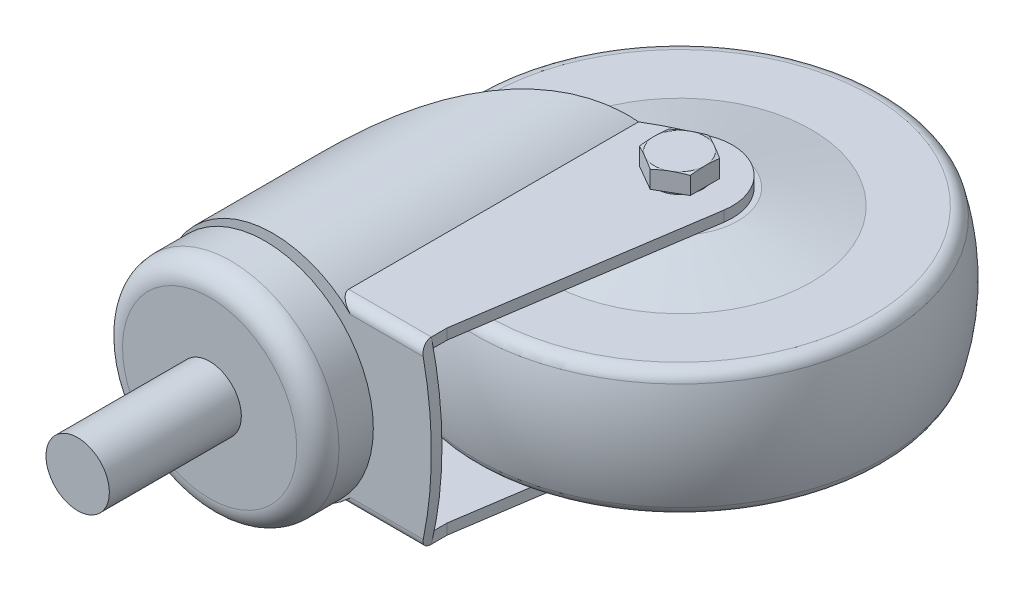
ISO-10303-21;
HEADER;
FILE_DESCRIPTION(('STEP AP214'),'2;1');
FILE_NAME('part.step','',(''),(''),'','','');
FILE_SCHEMA(('AUTOMOTIVE_DESIGN { 1 0 10303 214 1 1 1 1 }'));
ENDSEC;
DATA;
#1=APPLICATION_CONTEXT('core data for automotive mechanical design processes');
#2=APPLICATION_PROTOCOL_DEFINITION('international standard','automotive_design',2000,#1);
#3=PRODUCT_CONTEXT('',#1,'mechanical');
#4=PRODUCT('Part','Part','',(#3));
#5=PRODUCT_RELATED_PRODUCT_CATEGORY('part','',(#4));
#6=PRODUCT_DEFINITION_FORMATION('','',#4);
#7=PRODUCT_DEFINITION_CONTEXT('part definition',#1,'design');
#8=PRODUCT_DEFINITION('design','',#6,#7);
#9=PRODUCT_DEFINITION_SHAPE('','',#8);
#10=(LENGTH_UNIT() NAMED_UNIT(*) SI_UNIT(.MILLI.,.METRE.));
#11=(NAMED_UNIT(*) PLANE_ANGLE_UNIT() SI_UNIT($,.RADIAN.));
#12=(NAMED_UNIT(*) SI_UNIT($,.STERADIAN.) SOLID_ANGLE_UNIT());
#13=UNCERTAINTY_MEASURE_WITH_UNIT(LENGTH_MEASURE(1.E-05),#10,'distance_accuracy_value','');
#14=(GEOMETRIC_REPRESENTATION_CONTEXT(3) GLOBAL_UNCERTAINTY_ASSIGNED_CONTEXT((#13)) GLOBAL_UNIT_ASSIGNED_CONTEXT((#10,
#11,#12)) REPRESENTATION_CONTEXT('',''));
#15=CARTESIAN_POINT('',(0.,0.,0.));
#16=DIRECTION('',(0.,0.,1.));
#17=DIRECTION('',(1.,0.,0.));
#18=AXIS2_PLACEMENT_3D('',#15,#16,#17);
#19=CARTESIAN_POINT('',(-500000.,-15.,-14.));
#20=DIRECTION('',(0.,-1.,0.));
#21=DIRECTION('',(0.,0.,1.));
#22=AXIS2_PLACEMENT_3D('',#19,#20,#21);
#23=PLANE('',#22);
#24=CARTESIAN_POINT('',(25.,-15.,-64.));
#25=DIRECTION('',(0.,-1.,0.));
#26=DIRECTION('',(0.,0.,1.));
#27=AXIS2_PLACEMENT_3D('',#24,#25,#26);
#28=CIRCLE('',#27,11.);
#29=CARTESIAN_POINT('',(16.7747143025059,-15.,-71.3037439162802));
#30=VERTEX_POINT('',#29);
#31=CARTESIAN_POINT('',(34.2015773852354,-15.,-57.9724819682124));
#32=VERTEX_POINT('',#31);
#33=EDGE_CURVE('E9',#30,#32,#28,.F.);
#34=ORIENTED_EDGE('',*,*,#33,.F.);
#35=CARTESIAN_POINT('',(44.1904677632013,-15.,-15.0041803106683));
#36=DIRECTION('',(0.,-1.,0.));
#37=DIRECTION('',(0.,0.,1.));
#38=AXIS2_PLACEMENT_3D('',#35,#36,#37);
#39=CIRCLE('',#38,62.62);
#40=CARTESIAN_POINT('',(11.6619037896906,-15.,-68.5126555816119));
#41=VERTEX_POINT('',#40);
#42=EDGE_CURVE('E936',#30,#41,#39,.F.);
#43=ORIENTED_EDGE('',*,*,#42,.T.);
#44=DIRECTION('',(0.,0.,1.));
#45=VECTOR('',#44,1.);
#46=CARTESIAN_POINT('',(11.6619037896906,-15.,-74.));
#47=LINE('',#46,#45);
#48=CARTESIAN_POINT('',(11.6619037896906,-15.,-14.));
#49=VERTEX_POINT('',#48);
#50=EDGE_CURVE('E1575',#41,#49,#47,.T.);
#51=ORIENTED_EDGE('',*,*,#50,.T.);
#52=DIRECTION('',(1.,0.,0.));
#53=VECTOR('',#52,1.);
#54=CARTESIAN_POINT('',(-500000.,-15.,-14.));
#55=LINE('',#54,#53);
#56=CARTESIAN_POINT('',(28.,-15.,-14.));
#57=VERTEX_POINT('',#56);
#58=EDGE_CURVE('E448',#49,#57,#55,.T.);
#59=ORIENTED_EDGE('',*,*,#58,.T.);
#60=DIRECTION('',(0.,0.,-1.));
#61=VECTOR('',#60,1.);
#62=CARTESIAN_POINT('',(28.,-15.,-14.));
#63=LINE('',#62,#61);
#64=CARTESIAN_POINT('',(28.,-15.,-17.));
#65=VERTEX_POINT('',#64);
#66=EDGE_CURVE('E298',#57,#65,#63,.T.);
#67=ORIENTED_EDGE('',*,*,#66,.T.);
#68=DIRECTION('',(0.149655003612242,0.,-0.988738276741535));
#69=VECTOR('',#68,1.);
#70=CARTESIAN_POINT('',(-11171.3810673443,-15.0000000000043,73974.8911484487));
#71=LINE('',#70,#69);
#72=EDGE_CURVE('E431',#65,#32,#71,.T.);
#73=ORIENTED_EDGE('',*,*,#72,.T.);
#74=EDGE_LOOP('',(#34,#43,#51,#59,#67,#73));
#75=FACE_BOUND('',#74,.T.);
#76=ADVANCED_FACE('F14',(#75),#23,.F.);
#77=CARTESIAN_POINT('',(-500000.,15.,-74.));
#78=DIRECTION('',(0.,1.,0.));
#79=DIRECTION('',(-1.,0.,0.));
#80=AXIS2_PLACEMENT_3D('',#77,#78,#79);
#81=PLANE('',#80);
#82=CARTESIAN_POINT('',(25.,15.,-64.));
#83=DIRECTION('',(0.,1.,0.));
#84=DIRECTION('',(-1.,0.,0.));
#85=AXIS2_PLACEMENT_3D('',#82,#83,#84);
#86=CIRCLE('',#85,11.);
#87=CARTESIAN_POINT('',(34.2015773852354,15.,-57.9724819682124));
#88=VERTEX_POINT('',#87);
#89=CARTESIAN_POINT('',(16.7747143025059,15.,-71.3037439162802));
#90=VERTEX_POINT('',#89);
#91=EDGE_CURVE('E23',#88,#90,#86,.F.);
#92=ORIENTED_EDGE('',*,*,#91,.F.);
#93=DIRECTION('',(-0.149655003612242,0.,0.988738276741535));
#94=VECTOR('',#93,1.);
#95=CARTESIAN_POINT('',(-11162.5028895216,15.,73916.234945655));
#96=LINE('',#95,#94);
#97=CARTESIAN_POINT('',(28.,15.,-17.));
#98=VERTEX_POINT('',#97);
#99=EDGE_CURVE('E433',#88,#98,#96,.T.);
#100=ORIENTED_EDGE('',*,*,#99,.T.);
#101=DIRECTION('',(0.,0.,1.));
#102=VECTOR('',#101,1.);
#103=CARTESIAN_POINT('',(28.,15.,-74.));
#104=LINE('',#103,#102);
#105=CARTESIAN_POINT('',(28.,15.,-14.));
#106=VERTEX_POINT('',#105);
#107=EDGE_CURVE('E377',#98,#106,#104,.T.);
#108=ORIENTED_EDGE('',*,*,#107,.T.);
#109=DIRECTION('',(1.,0.,0.));
#110=VECTOR('',#109,1.);
#111=CARTESIAN_POINT('',(-500000.,15.,-14.));
#112=LINE('',#111,#110);
#113=CARTESIAN_POINT('',(11.6619037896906,15.,-14.));
#114=VERTEX_POINT('',#113);
#115=EDGE_CURVE('E439',#114,#106,#112,.T.);
#116=ORIENTED_EDGE('',*,*,#115,.F.);
#117=DIRECTION('',(0.,0.,1.));
#118=VECTOR('',#117,1.);
#119=CARTESIAN_POINT('',(11.6619037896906,15.,-74.));
#120=LINE('',#119,#118);
#121=CARTESIAN_POINT('',(11.6619037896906,15.,-68.5126555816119));
#122=VERTEX_POINT('',#121);
#123=EDGE_CURVE('E289',#122,#114,#120,.T.);
#124=ORIENTED_EDGE('',*,*,#123,.F.);
#125=CARTESIAN_POINT('',(44.1904677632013,15.,-15.0041803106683));
#126=DIRECTION('',(0.,1.,0.));
#127=DIRECTION('',(-1.,0.,0.));
#128=AXIS2_PLACEMENT_3D('',#125,#126,#127);
#129=CIRCLE('',#128,62.62);
#130=EDGE_CURVE('E424',#122,#90,#129,.F.);
#131=ORIENTED_EDGE('',*,*,#130,.T.);
#132=EDGE_LOOP('',(#92,#100,#108,#116,#124,#131));
#133=FACE_BOUND('',#132,.T.);
#134=ADVANCED_FACE('F389',(#133),#81,.F.);
#135=CARTESIAN_POINT('',(0.,0.,-64.));
#136=DIRECTION('',(0.,0.,-1.));
#137=DIRECTION('',(0.,-1.,0.));
#138=AXIS2_PLACEMENT_3D('',#135,#136,#137);
#139=CYLINDRICAL_SURFACE('',#138,19.);
#140=CARTESIAN_POINT('',(0.,0.,-14.));
#141=DIRECTION('',(0.,0.,-1.));
#142=DIRECTION('',(0.,-1.,0.));
#143=AXIS2_PLACEMENT_3D('',#140,#141,#142);
#144=CIRCLE('',#143,19.);
#145=EDGE_CURVE('E447',#49,#114,#144,.T.);
#146=ORIENTED_EDGE('',*,*,#145,.F.);
#147=ORIENTED_EDGE('',*,*,#50,.F.);
#148=CARTESIAN_POINT('',(-18.0196372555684,-6.02434006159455,-22.1573078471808));
#149=CARTESIAN_POINT('',(-17.9764400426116,-6.15362277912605,-22.5329242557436));
#150=CARTESIAN_POINT('',(-17.9300486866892,-6.28769141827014,-22.9064723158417));
#151=CARTESIAN_POINT('',(-17.8309601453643,-6.56338820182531,-23.6498564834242));
#152=CARTESIAN_POINT('',(-17.7782640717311,-6.70501501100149,-24.0196932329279));
#153=CARTESIAN_POINT('',(-17.666658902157,-6.99379644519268,-24.756042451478));
#154=CARTESIAN_POINT('',(-17.6077526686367,-7.1409485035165,-25.1225563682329));
#155=CARTESIAN_POINT('',(-17.4837414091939,-7.43941649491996,-25.8528433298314));
#156=CARTESIAN_POINT('',(-17.4186360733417,-7.59073263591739,-26.2166162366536));
#157=CARTESIAN_POINT('',(-17.21404900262,-8.0491172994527,-27.3043602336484));
#158=CARTESIAN_POINT('',(-17.0652988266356,-8.36061516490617,-28.0247393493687));
#159=CARTESIAN_POINT('',(-16.7430669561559,-8.98857510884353,-29.4578318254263));
#160=CARTESIAN_POINT('',(-16.5695820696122,-9.30503782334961,-30.1705441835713));
#161=CARTESIAN_POINT('',(-16.195868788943,-9.94139675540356,-31.5964486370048));
#162=CARTESIAN_POINT('',(-15.9953898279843,-10.2612956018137,-32.30957397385));
#163=CARTESIAN_POINT('',(-15.5688089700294,-10.8976588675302,-33.7296394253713));
#164=CARTESIAN_POINT('',(-15.3427079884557,-11.2141234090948,-34.4365797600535));
#165=CARTESIAN_POINT('',(-14.8646036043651,-11.8405578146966,-35.8444172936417));
#166=CARTESIAN_POINT('',(-14.6126043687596,-12.1505287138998,-36.5453154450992));
#167=CARTESIAN_POINT('',(-14.082323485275,-12.7613382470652,-37.9411275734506));
#168=CARTESIAN_POINT('',(-13.8040422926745,-13.0621770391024,-38.6360416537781));
#169=CARTESIAN_POINT('',(-13.2665953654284,-13.6058715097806,-39.9110226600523));
#170=CARTESIAN_POINT('',(-13.0112860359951,-13.8504161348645,-40.4919944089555));
#171=CARTESIAN_POINT('',(-12.4815052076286,-14.3296760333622,-41.6491960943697));
#172=CARTESIAN_POINT('',(-12.207034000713,-14.5643914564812,-42.225426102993));
#173=CARTESIAN_POINT('',(-11.3544250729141,-15.2515607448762,-43.946692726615));
#174=CARTESIAN_POINT('',(-10.7470879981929,-15.6870417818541,-45.0843155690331));
#175=CARTESIAN_POINT('',(-9.45547023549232,-16.4976851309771,-47.3314364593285));
#176=CARTESIAN_POINT('',(-8.771467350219,-16.8730539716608,-48.4410192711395));
#177=CARTESIAN_POINT('',(-7.32407428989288,-17.5498096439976,-50.6305248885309));
#178=CARTESIAN_POINT('',(-6.56071963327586,-17.8512293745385,-51.7104606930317));
#179=CARTESIAN_POINT('',(-5.21562743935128,-18.2789827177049,-53.4893989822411));
#180=CARTESIAN_POINT('',(-4.65513631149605,-18.4304052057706,-54.1985008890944));
#181=CARTESIAN_POINT('',(-3.49927526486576,-18.6843569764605,-55.5969787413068));
#182=CARTESIAN_POINT('',(-2.90390597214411,-18.7868871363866,-56.2863550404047));
#183=CARTESIAN_POINT('',(-1.68066034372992,-18.9355432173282,-57.6414494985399));
#184=CARTESIAN_POINT('',(-1.05280184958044,-18.981699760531,-58.3071803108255));
#185=CARTESIAN_POINT('',(0.232283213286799,-19.0094406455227,-59.611123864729));
#186=CARTESIAN_POINT('',(0.889501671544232,-18.9910427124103,-60.24934411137));
#187=CARTESIAN_POINT('',(2.06933105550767,-18.8939232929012,-61.3459617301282));
#188=CARTESIAN_POINT('',(2.58692957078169,-18.830531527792,-61.811129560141));
#189=CARTESIAN_POINT('',(3.63289379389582,-18.6569836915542,-62.7202930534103));
#190=CARTESIAN_POINT('',(4.16125890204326,-18.5468302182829,-63.164289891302));
#191=CARTESIAN_POINT('',(5.22392725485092,-18.2759654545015,-64.0280672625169));
#192=CARTESIAN_POINT('',(5.75822361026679,-18.1153078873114,-64.4478729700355));
#193=CARTESIAN_POINT('',(6.8279210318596,-17.7398028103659,-65.2610757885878));
#194=CARTESIAN_POINT('',(7.36332188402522,-17.5249649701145,-65.654477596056));
#195=CARTESIAN_POINT('',(8.33478586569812,-17.0811044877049,-66.3454379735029));
#196=CARTESIAN_POINT('',(8.77172661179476,-16.861254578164,-66.6476687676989));
#197=CARTESIAN_POINT('',(9.63774362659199,-16.3816605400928,-67.2310516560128));
#198=CARTESIAN_POINT('',(10.0668206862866,-16.1219204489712,-67.5122058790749));
#199=CARTESIAN_POINT('',(10.912439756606,-15.561997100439,-68.0521673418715));
#200=CARTESIAN_POINT('',(11.3289832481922,-15.2618186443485,-68.3109772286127));
#201=CARTESIAN_POINT('',(12.1446168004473,-14.6211213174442,-68.8052514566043));
#202=CARTESIAN_POINT('',(12.5437065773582,-14.2806017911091,-69.0407154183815));
#203=CARTESIAN_POINT('',(13.3214851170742,-13.5580739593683,-69.4887923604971));
#204=CARTESIAN_POINT('',(13.7000431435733,-13.1758379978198,-69.7012659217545));
#205=CARTESIAN_POINT('',(14.4289898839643,-12.3732813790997,-70.1012923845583));
#206=CARTESIAN_POINT('',(14.7793780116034,-11.952959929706,-70.2888447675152));
#207=CARTESIAN_POINT('',(15.4468097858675,-11.0769678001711,-70.6387789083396));
#208=CARTESIAN_POINT('',(15.7638599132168,-10.6213040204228,-70.801165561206));
#209=CARTESIAN_POINT('',(16.3599382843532,-9.67799619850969,-71.1008593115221));
#210=CARTESIAN_POINT('',(16.6389704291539,-9.19035544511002,-71.2381689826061));
#211=CARTESIAN_POINT('',(17.1284163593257,-8.23855433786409,-71.4751992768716));
#212=CARTESIAN_POINT('',(17.3429295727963,-7.77709472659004,-71.5773282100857));
#213=CARTESIAN_POINT('',(17.7353339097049,-6.83507250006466,-71.7618876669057));
#214=CARTESIAN_POINT('',(17.9132276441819,-6.35451124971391,-71.8443195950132));
#215=CARTESIAN_POINT('',(18.2302010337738,-5.37803167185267,-71.9897871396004));
#216=CARTESIAN_POINT('',(18.369289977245,-4.882117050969,-72.052827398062));
#217=CARTESIAN_POINT('',(18.6070348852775,-3.87867056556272,-72.1598396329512));
#218=CARTESIAN_POINT('',(18.7056915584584,-3.37113890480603,-72.2038119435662));
#219=CARTESIAN_POINT('',(18.857747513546,-2.37243385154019,-72.2713109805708));
#220=CARTESIAN_POINT('',(18.9130494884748,-1.88160713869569,-72.2956985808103));
#221=CARTESIAN_POINT('',(18.9852559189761,-0.896602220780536,-72.3275025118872));
#222=CARTESIAN_POINT('',(19.0021618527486,-0.402424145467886,-72.3349194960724));
#223=CARTESIAN_POINT('',(18.9973963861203,0.585655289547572,-72.3328254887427));
#224=CARTESIAN_POINT('',(18.9757290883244,1.0795566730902,-72.3233162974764));
#225=CARTESIAN_POINT('',(18.8940586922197,2.06355857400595,-72.2873198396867));
#226=CARTESIAN_POINT('',(18.8340554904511,2.55365908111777,-72.2608325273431));
#227=CARTESIAN_POINT('',(18.6771280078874,3.52179442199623,-72.191077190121));
#228=CARTESIAN_POINT('',(18.5805673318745,3.99990016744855,-72.1479743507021));
#229=CARTESIAN_POINT('',(18.3515189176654,4.94554589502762,-72.0447700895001));
#230=CARTESIAN_POINT('',(18.2190316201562,5.41308600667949,-71.9846688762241));
#231=CARTESIAN_POINT('',(17.9195615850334,6.33434269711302,-71.847218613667));
#232=CARTESIAN_POINT('',(17.7525809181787,6.78806010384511,-71.7698705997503));
#233=CARTESIAN_POINT('',(17.385924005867,7.67864206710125,-71.5976589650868));
#234=CARTESIAN_POINT('',(17.18624751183,8.11550649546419,-71.5027952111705));
#235=CARTESIAN_POINT('',(16.7546350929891,8.97298386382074,-71.2944755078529));
#236=CARTESIAN_POINT('',(16.5224524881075,9.39343772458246,-71.1808760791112));
#237=CARTESIAN_POINT('',(16.0296258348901,10.2117196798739,-70.935451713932));
#238=CARTESIAN_POINT('',(15.7689818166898,10.6095477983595,-70.8036267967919));
#239=CARTESIAN_POINT('',(15.2220823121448,11.3803122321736,-70.5216699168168));
#240=CARTESIAN_POINT('',(14.9358269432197,11.7532486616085,-70.3715380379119));
#241=CARTESIAN_POINT('',(14.3407776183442,12.4723664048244,-70.0530155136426));
#242=CARTESIAN_POINT('',(14.0319831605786,12.818547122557,-69.8846244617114));
#243=CARTESIAN_POINT('',(13.3833440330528,13.4949498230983,-69.5232442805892));
#244=CARTESIAN_POINT('',(13.042774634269,13.8241144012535,-69.3295775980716));
#245=CARTESIAN_POINT('',(12.3445396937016,14.4510384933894,-68.9232345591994));
#246=CARTESIAN_POINT('',(11.9868738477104,14.7487974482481,-68.7105578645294));
#247=CARTESIAN_POINT('',(11.2580259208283,15.3123840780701,-68.2667442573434));
#248=CARTESIAN_POINT('',(10.8868418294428,15.5782069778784,-68.0356045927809));
#249=CARTESIAN_POINT('',(10.1345067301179,16.0778020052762,-67.5556317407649));
#250=CARTESIAN_POINT('',(9.75335527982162,16.3115727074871,-67.3067977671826));
#251=CARTESIAN_POINT('',(8.94760521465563,16.7682679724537,-66.7676986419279));
#252=CARTESIAN_POINT('',(8.52233664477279,16.9880189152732,-66.4757468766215));
#253=CARTESIAN_POINT('',(7.66775595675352,17.3904758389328,-65.8729273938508));
#254=CARTESIAN_POINT('',(7.23844368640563,17.5731804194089,-65.5620589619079));
#255=CARTESIAN_POINT('',(6.37908106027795,17.903051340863,-64.9226173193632));
#256=CARTESIAN_POINT('',(5.94903046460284,18.0502021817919,-64.594036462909));
#257=CARTESIAN_POINT('',(5.09134061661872,18.3106312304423,-63.9206421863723));
#258=CARTESIAN_POINT('',(4.66370190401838,18.4239021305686,-63.5758252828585));
#259=CARTESIAN_POINT('',(3.59224661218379,18.6690987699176,-62.688059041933));
#260=CARTESIAN_POINT('',(2.95166333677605,18.7800912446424,-62.1353279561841));
#261=CARTESIAN_POINT('',(1.68908156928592,18.9354690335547,-61.0000323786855));
#262=CARTESIAN_POINT('',(1.06709090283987,18.9798266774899,-60.4174555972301));
#263=CARTESIAN_POINT('',(-0.15394075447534,19.0092001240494,-59.2259658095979));
#264=CARTESIAN_POINT('',(-0.752952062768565,18.9941416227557,-58.6170207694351));
#265=CARTESIAN_POINT('',(-1.92373577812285,18.9114693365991,-57.3771923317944));
#266=CARTESIAN_POINT('',(-2.49550834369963,18.8438558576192,-56.746309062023));
#267=CARTESIAN_POINT('',(-3.86395192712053,18.6211107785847,-55.1733710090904));
#268=CARTESIAN_POINT('',(-4.64423080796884,18.4401255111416,-54.2206532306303));
#269=CARTESIAN_POINT('',(-6.13909923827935,17.9977640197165,-52.2828447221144));
#270=CARTESIAN_POINT('',(-6.8536560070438,17.7363479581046,-51.2977381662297));
#271=CARTESIAN_POINT('',(-8.21932140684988,17.1463893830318,-49.2963542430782));
#272=CARTESIAN_POINT('',(-8.87009241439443,16.8175154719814,-48.2799448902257));
#273=CARTESIAN_POINT('',(-9.79563790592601,16.2841082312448,-46.7393951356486));
#274=CARTESIAN_POINT('',(-10.0957144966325,16.0996256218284,-46.2232290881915));
#275=CARTESIAN_POINT('',(-10.6792203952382,15.7186408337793,-45.1858933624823));
#276=CARTESIAN_POINT('',(-10.9626488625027,15.5221380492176,-44.6647234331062));
#277=CARTESIAN_POINT('',(-11.6991176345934,14.9819215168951,-43.2637200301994));
#278=CARTESIAN_POINT('',(-12.1372151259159,14.6285348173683,-42.3797224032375));
#279=CARTESIAN_POINT('',(-12.9677900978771,13.8975709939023,-40.6003179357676));
#280=CARTESIAN_POINT('',(-13.3602609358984,13.5199903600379,-39.7049094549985));
#281=CARTESIAN_POINT('',(-14.1007989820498,12.7457704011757,-37.9027126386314));
#282=CARTESIAN_POINT('',(-14.4488162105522,12.3491103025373,-36.9959127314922));
#283=CARTESIAN_POINT('',(-15.1007403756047,11.5428068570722,-35.1723415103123));
#284=CARTESIAN_POINT('',(-15.4046474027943,11.1331635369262,-34.2555702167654));
#285=CARTESIAN_POINT('',(-15.9643267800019,10.3141565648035,-32.4272635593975));
#286=CARTESIAN_POINT('',(-16.220823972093,9.90490452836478,-31.5159003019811));
#287=CARTESIAN_POINT('',(-16.5744763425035,9.29206556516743,-30.1405553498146));
#288=CARTESIAN_POINT('',(-16.6871739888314,9.08796797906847,-29.680743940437));
#289=CARTESIAN_POINT('',(-16.9022631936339,8.68137949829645,-28.7579839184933));
#290=CARTESIAN_POINT('',(-17.0046544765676,8.47888864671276,-28.2950352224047));
#291=CARTESIAN_POINT('',(-17.1989566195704,8.07746929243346,-27.3665226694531));
#292=CARTESIAN_POINT('',(-17.2908876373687,7.87853458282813,-26.9009657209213));
#293=CARTESIAN_POINT('',(-17.4644853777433,7.48584131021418,-25.9658095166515));
#294=CARTESIAN_POINT('',(-17.5461529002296,7.29208234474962,-25.4962105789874));
#295=CARTESIAN_POINT('',(-17.6992224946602,6.91226604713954,-24.5519316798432));
#296=CARTESIAN_POINT('',(-17.7706193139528,6.72621269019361,-24.077249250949));
#297=CARTESIAN_POINT('',(-17.8698965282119,6.45569918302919,-23.3608366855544));
#298=CARTESIAN_POINT('',(-17.901689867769,6.36694384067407,-23.1212668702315));
#299=CARTESIAN_POINT('',(-17.962644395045,6.19289405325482,-22.6405230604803));
#300=CARTESIAN_POINT('',(-17.9918054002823,6.10759984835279,-22.3993489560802));
#301=CARTESIAN_POINT('',(-18.0196372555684,6.02434006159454,-22.1573078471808));
#302=B_SPLINE_CURVE_WITH_KNOTS('',3,(#148,#149,#150,#151,#152,#153,#154,#155,#156,#157,#158,
#159,#160,#161,#162,#163,#164,#165,#166,#167,#168,#169,#170,#171,#172,#173,#174,#175,#176,#177,
#178,#179,#180,#181,#182,#183,#184,#185,#186,#187,#188,#189,#190,#191,#192,#193,#194,#195,#196,
#197,#198,#199,#200,#201,#202,#203,#204,#205,#206,#207,#208,#209,#210,#211,#212,#213,#214,#215,
#216,#217,#218,#219,#220,#221,#222,#223,#224,#225,#226,#227,#228,#229,#230,#231,#232,#233,#234,
#235,#236,#237,#238,#239,#240,#241,#242,#243,#244,#245,#246,#247,#248,#249,#250,#251,#252,#253,
#254,#255,#256,#257,#258,#259,#260,#261,#262,#263,#264,#265,#266,#267,#268,#269,#270,#271,#272,
#273,#274,#275,#276,#277,#278,#279,#280,#281,#282,#283,#284,#285,#286,#287,#288,#289,#290,#291,
#292,#293,#294,#295,#296,#297,#298,#299,#300,#301),.UNSPECIFIED.,.F.,.F.,(4,2,2,2,2,2,2,2,2,2,2,
2,2,2,2,2,2,2,2,2,2,2,2,2,2,2,2,2,2,2,2,2,2,2,2,2,2,2,2,2,2,2,2,2,2,2,2,2,2,2,2,2,2,2,2,2,2,2,2,
2,2,2,2,2,2,2,2,2,2,2,2,2,2,2,2,2,4),(0.,1.1986337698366,2.39705648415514,3.59492921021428,
4.79286185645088,7.18878340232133,9.58501442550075,12.0052572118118,14.4254135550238,
16.845181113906,19.2649067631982,21.3048000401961,23.344662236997,27.4243529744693,
31.4897115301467,35.5532581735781,38.3007813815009,41.0482552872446,43.7942360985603,
46.5394629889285,48.6340851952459,50.7285910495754,52.820876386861,54.9127885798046,
56.6360262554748,58.3590896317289,60.081948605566,61.8048355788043,63.5376453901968,
65.2704912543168,67.0029996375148,68.7353301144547,70.2904548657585,71.8454686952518,
73.4001099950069,74.9547240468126,76.4365507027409,77.9183203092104,79.3999323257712,
80.8815483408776,82.3487995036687,83.8160326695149,85.2831777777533,86.7503340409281,
88.229297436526,89.7082592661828,91.1872143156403,92.6662023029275,94.1996638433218,
95.7331526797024,97.2668705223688,98.8006565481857,100.481078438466,102.161563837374,
103.842780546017,105.524359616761,108.080450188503,110.637601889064,113.197952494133,
115.758288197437,119.486600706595,123.216762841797,126.965708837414,128.840135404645,
130.714656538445,133.857059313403,136.99991900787,140.146281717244,143.292637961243,
146.385973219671,147.932505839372,149.479079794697,151.022621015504,152.566041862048,
154.110249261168,154.882571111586,155.654946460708),.UNSPECIFIED.);
#303=CARTESIAN_POINT('',(-18.0196372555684,-6.02434006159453,-22.1573078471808));
#304=VERTEX_POINT('',#303);
#305=EDGE_CURVE('E414',#304,#41,#302,.T.);
#306=ORIENTED_EDGE('',*,*,#305,.F.);
#307=CARTESIAN_POINT('',(-18.0196372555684,6.02434006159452,-22.1573078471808));
#308=CARTESIAN_POINT('',(-18.0288638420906,5.99675906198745,-22.0772382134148));
#309=CARTESIAN_POINT('',(-18.0408414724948,5.96071387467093,-22.001279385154));
#310=CARTESIAN_POINT('',(-18.0684521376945,5.87646982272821,-21.8587297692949));
#311=CARTESIAN_POINT('',(-18.0840229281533,5.82847692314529,-21.7920073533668));
#312=CARTESIAN_POINT('',(-18.1252028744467,5.69942885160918,-21.6370371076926));
#313=CARTESIAN_POINT('',(-18.1520936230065,5.61342779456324,-21.5533830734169));
#314=CARTESIAN_POINT('',(-18.207900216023,5.42970807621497,-21.3995872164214));
#315=CARTESIAN_POINT('',(-18.2368323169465,5.33188954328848,-21.329575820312));
#316=CARTESIAN_POINT('',(-18.2945934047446,5.13018173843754,-21.2016803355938));
#317=CARTESIAN_POINT('',(-18.3234205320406,5.02636291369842,-21.1436820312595));
#318=CARTESIAN_POINT('',(-18.3803732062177,4.81393816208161,-21.0367082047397));
#319=CARTESIAN_POINT('',(-18.4084980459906,4.70532769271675,-20.9877414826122));
#320=CARTESIAN_POINT('',(-18.4634606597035,4.48481165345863,-20.8972637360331));
#321=CARTESIAN_POINT('',(-18.4902988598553,4.37290719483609,-20.8557502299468));
#322=CARTESIAN_POINT('',(-18.542343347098,4.14668265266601,-20.7789330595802));
#323=CARTESIAN_POINT('',(-18.567550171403,4.03236338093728,-20.7436273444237));
#324=CARTESIAN_POINT('',(-18.6191284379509,3.78755652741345,-20.6741997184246));
#325=CARTESIAN_POINT('',(-18.6452561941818,3.65682309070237,-20.640768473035));
#326=CARTESIAN_POINT('',(-18.694964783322,3.39355969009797,-20.5794882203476));
#327=CARTESIAN_POINT('',(-18.7185450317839,3.26102932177,-20.5516404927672));
#328=CARTESIAN_POINT('',(-18.7630294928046,2.99449393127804,-20.5007233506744));
#329=CARTESIAN_POINT('',(-18.7839313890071,2.86048774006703,-20.4776580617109));
#330=CARTESIAN_POINT('',(-18.8229404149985,2.59141038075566,-20.4357266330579));
#331=CARTESIAN_POINT('',(-18.8410472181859,2.45633909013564,-20.4168609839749));
#332=CARTESIAN_POINT('',(-18.8911705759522,2.04905192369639,-20.3657163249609));
#333=CARTESIAN_POINT('',(-18.9188536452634,1.77557731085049,-20.3390383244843));
#334=CARTESIAN_POINT('',(-18.9623399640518,1.22695007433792,-20.2980000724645));
#335=CARTESIAN_POINT('',(-18.978148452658,0.951798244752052,-20.283634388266));
#336=CARTESIAN_POINT('',(-18.9991423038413,0.362301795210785,-20.2646448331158));
#337=CARTESIAN_POINT('',(-19.0025400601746,0.0478394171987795,-20.2616577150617));
#338=CARTESIAN_POINT('',(-18.9937214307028,-0.580861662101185,-20.2695529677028));
#339=CARTESIAN_POINT('',(-18.9814980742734,-0.895100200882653,-20.2804415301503));
#340=CARTESIAN_POINT('',(-18.9515945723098,-1.36437986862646,-20.3081527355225));
#341=CARTESIAN_POINT('',(-18.9397326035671,-1.5201616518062,-20.3192539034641));
#342=CARTESIAN_POINT('',(-18.9122090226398,-1.83103442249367,-20.3455861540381));
#343=CARTESIAN_POINT('',(-18.8965477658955,-1.98612547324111,-20.3608168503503));
#344=CARTESIAN_POINT('',(-18.8614938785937,-2.29526345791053,-20.3958602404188));
#345=CARTESIAN_POINT('',(-18.8421036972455,-2.44931100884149,-20.4156699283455));
#346=CARTESIAN_POINT('',(-18.7996742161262,-2.75612418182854,-20.4605089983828));
#347=CARTESIAN_POINT('',(-18.7766355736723,-2.90889002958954,-20.4855374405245));
#348=CARTESIAN_POINT('',(-18.7352488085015,-3.16244585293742,-20.5323807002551));
#349=CARTESIAN_POINT('',(-18.7178715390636,-3.26370602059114,-20.5525179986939));
#350=CARTESIAN_POINT('',(-18.6816002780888,-3.46529894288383,-20.5958407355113));
#351=CARTESIAN_POINT('',(-18.6627063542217,-3.56563173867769,-20.6190260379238));
#352=CARTESIAN_POINT('',(-18.6234519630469,-3.76528893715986,-20.6688725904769));
#353=CARTESIAN_POINT('',(-18.6030896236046,-3.86461186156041,-20.6955383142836));
#354=CARTESIAN_POINT('',(-18.5610261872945,-4.06183097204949,-20.7528107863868));
#355=CARTESIAN_POINT('',(-18.5393251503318,-4.159727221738,-20.7834173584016));
#356=CARTESIAN_POINT('',(-18.4945631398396,-4.35444441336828,-20.8494273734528));
#357=CARTESIAN_POINT('',(-18.471493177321,-4.45125175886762,-20.8848651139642));
#358=CARTESIAN_POINT('',(-18.4243641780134,-4.64246640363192,-20.9611330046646));
#359=CARTESIAN_POINT('',(-18.4003053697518,-4.73687424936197,-21.0019619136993));
#360=CARTESIAN_POINT('',(-18.3515289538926,-4.92245667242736,-21.0899877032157));
#361=CARTESIAN_POINT('',(-18.3268117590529,-5.01363319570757,-21.1371806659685));
#362=CARTESIAN_POINT('',(-18.2772148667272,-5.19152406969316,-21.2391822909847));
#363=CARTESIAN_POINT('',(-18.2523353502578,-5.27824266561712,-21.2939835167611));
#364=CARTESIAN_POINT('',(-18.2048916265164,-5.43952943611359,-21.4086946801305));
#365=CARTESIAN_POINT('',(-18.18228713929,-5.51452321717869,-21.4679797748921));
#366=CARTESIAN_POINT('',(-18.1387332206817,-5.65612942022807,-21.5957376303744));
#367=CARTESIAN_POINT('',(-18.1177747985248,-5.72278875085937,-21.664154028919));
#368=CARTESIAN_POINT('',(-18.0821719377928,-5.83419921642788,-21.7997637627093));
#369=CARTESIAN_POINT('',(-18.0670561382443,-5.8807504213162,-21.865301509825));
#370=CARTESIAN_POINT('',(-18.0402620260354,-5.9624576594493,-22.0049634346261));
#371=CARTESIAN_POINT('',(-18.0286364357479,-5.99743965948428,-22.0791978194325));
#372=CARTESIAN_POINT('',(-18.0196372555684,-6.02434006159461,-22.1573078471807));
#373=B_SPLINE_CURVE_WITH_KNOTS('',3,(#307,#308,#309,#310,#311,#312,#313,#314,#315,#316,#317,
#318,#319,#320,#321,#322,#323,#324,#325,#326,#327,#328,#329,#330,#331,#332,#333,#334,#335,#336,
#337,#338,#339,#340,#341,#342,#343,#344,#345,#346,#347,#348,#349,#350,#351,#352,#353,#354,#355,
#356,#357,#358,#359,#360,#361,#362,#363,#364,#365,#366,#367,#368,#369,#370,#371,#372),
.UNSPECIFIED.,.F.,.F.,(4,2,2,2,2,2,2,2,2,2,2,2,2,2,2,2,2,2,2,2,2,2,2,2,2,2,2,2,2,2,2,2,4),(0.,
0.253811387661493,0.503518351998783,0.870416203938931,1.24066595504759,1.60721514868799,
1.97411962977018,2.34090171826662,2.70756240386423,3.11972637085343,3.53198469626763,
3.9445971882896,4.35725785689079,5.1850910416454,6.01255876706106,6.95535051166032,
7.8985631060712,8.36836097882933,8.83811491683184,9.30756136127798,9.77692332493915,
10.0909585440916,10.4049797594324,10.7194086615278,11.0338235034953,11.3505995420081,
11.6673027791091,11.9838119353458,12.3000138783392,12.5941136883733,12.886475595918,
13.1306696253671,13.3783856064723),.UNSPECIFIED.);
#374=CARTESIAN_POINT('',(-18.0196372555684,6.02434006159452,-22.1573078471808));
#375=VERTEX_POINT('',#374);
#376=EDGE_CURVE('E393',#375,#304,#373,.T.);
#377=ORIENTED_EDGE('',*,*,#376,.F.);
#378=EDGE_CURVE('E423',#122,#375,#302,.T.);
#379=ORIENTED_EDGE('',*,*,#378,.F.);
#380=ORIENTED_EDGE('',*,*,#123,.T.);
#381=EDGE_LOOP('',(#146,#147,#306,#377,#379,#380));
#382=FACE_BOUND('',#381,.T.);
#383=ADVANCED_FACE('F405',(#382),#139,.F.);
#384=CARTESIAN_POINT('',(44.1904677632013,-21.,-15.0041803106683));
#385=DIRECTION('',(0.,1.,0.));
#386=DIRECTION('',(-1.,0.,0.));
#387=AXIS2_PLACEMENT_3D('',#384,#385,#386);
#388=CYLINDRICAL_SURFACE('',#387,62.62);
#389=ORIENTED_EDGE('',*,*,#305,.T.);
#390=ORIENTED_EDGE('',*,*,#42,.F.);
#391=CARTESIAN_POINT('',(21.3530087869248,-15.,-73.3112542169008));
#392=VERTEX_POINT('',#391);
#393=EDGE_CURVE('E928',#392,#30,#39,.F.);
#394=ORIENTED_EDGE('',*,*,#393,.F.);
#395=DIRECTION('',(0.,1.,0.));
#396=VECTOR('',#395,1.);
#397=CARTESIAN_POINT('',(21.3530087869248,-21.,-73.3112542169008));
#398=LINE('',#397,#396);
#399=CARTESIAN_POINT('',(21.3530087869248,-17.,-73.3112542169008));
#400=VERTEX_POINT('',#399);
#401=EDGE_CURVE('E478',#400,#392,#398,.T.);
#402=ORIENTED_EDGE('',*,*,#401,.F.);
#403=CARTESIAN_POINT('',(44.1904677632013,-17.,-15.0041803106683));
#404=DIRECTION('',(0.,1.,0.));
#405=DIRECTION('',(-1.,0.,0.));
#406=AXIS2_PLACEMENT_3D('',#403,#404,#405);
#407=CIRCLE('',#406,62.62);
#408=CARTESIAN_POINT('',(12.328828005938,-17.,-68.9124386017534));
#409=VERTEX_POINT('',#408);
#410=EDGE_CURVE('E940',#409,#400,#407,.F.);
#411=ORIENTED_EDGE('',*,*,#410,.F.);
#412=CARTESIAN_POINT('',(12.328828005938,-17.,-68.9124386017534));
#413=CARTESIAN_POINT('',(12.0717116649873,-17.186477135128,-68.7604823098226));
#414=CARTESIAN_POINT('',(11.8119489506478,-17.3659528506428,-68.6044635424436));
#415=CARTESIAN_POINT('',(11.2881143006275,-17.7109209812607,-68.2845095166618));
#416=CARTESIAN_POINT('',(11.0240429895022,-17.876415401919,-68.1205753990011));
#417=CARTESIAN_POINT('',(10.492850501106,-18.1932851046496,-67.7851765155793));
#418=CARTESIAN_POINT('',(10.2257338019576,-18.3446787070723,-67.6137219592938));
#419=CARTESIAN_POINT('',(9.68901849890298,-18.6337290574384,-67.2633153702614));
#420=CARTESIAN_POINT('',(9.4194198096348,-18.771385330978,-67.084363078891));
#421=CARTESIAN_POINT('',(8.61360938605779,-19.1614010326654,-66.5402666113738));
#422=CARTESIAN_POINT('',(8.07491234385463,-19.3940397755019,-66.1644402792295));
#423=CARTESIAN_POINT('',(6.99703239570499,-19.8084662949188,-65.3862734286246));
#424=CARTESIAN_POINT('',(6.45784938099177,-19.9902330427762,-64.9839220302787));
#425=CARTESIAN_POINT('',(5.25742772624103,-20.3429996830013,-64.0570581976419));
#426=CARTESIAN_POINT('',(4.59740923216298,-20.5013386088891,-63.5261225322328));
#427=CARTESIAN_POINT('',(3.29233949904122,-20.7509566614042,-62.4313206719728));
#428=CARTESIAN_POINT('',(2.64729056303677,-20.8422255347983,-61.8674494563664));
#429=CARTESIAN_POINT('',(1.37562236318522,-20.9646659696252,-60.7086249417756));
#430=CARTESIAN_POINT('',(0.749079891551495,-20.9956145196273,-60.1135646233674));
#431=CARTESIAN_POINT('',(-0.478947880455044,-21.0035167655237,-58.8978515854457));
#432=CARTESIAN_POINT('',(-1.08043139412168,-20.9804666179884,-58.2771970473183));
#433=CARTESIAN_POINT('',(-2.0905272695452,-20.8999866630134,-57.1909006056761));
#434=CARTESIAN_POINT('',(-2.50590680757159,-20.8540166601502,-56.7306220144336));
#435=CARTESIAN_POINT('',(-3.32152067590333,-20.7397459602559,-55.7995050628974));
#436=CARTESIAN_POINT('',(-3.72175356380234,-20.6714431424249,-55.3286657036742));
#437=CARTESIAN_POINT('',(-4.89910450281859,-20.4362359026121,-53.9014678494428));
#438=CARTESIAN_POINT('',(-5.65275981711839,-20.2390430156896,-52.9305534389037));
#439=CARTESIAN_POINT('',(-7.09635653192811,-19.7792032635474,-50.9545303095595));
#440=CARTESIAN_POINT('',(-7.78615377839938,-19.5164130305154,-49.9493509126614));
#441=CARTESIAN_POINT('',(-9.09973131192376,-18.9396253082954,-47.9114531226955));
#442=CARTESIAN_POINT('',(-9.72351990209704,-18.6256342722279,-46.8787382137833));
#443=CARTESIAN_POINT('',(-11.2087786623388,-17.7880901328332,-44.2528893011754));
#444=CARTESIAN_POINT('',(-12.0282434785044,-17.2396012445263,-42.6437587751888));
#445=CARTESIAN_POINT('',(-13.1474280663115,-16.3818995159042,-40.192237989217));
#446=CARTESIAN_POINT('',(-13.5023423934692,-16.0899765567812,-39.3682308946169));
#447=CARTESIAN_POINT('',(-14.1757956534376,-15.4999059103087,-37.7076242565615));
#448=CARTESIAN_POINT('',(-14.4943364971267,-15.2017585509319,-36.8710253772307));
#449=CARTESIAN_POINT('',(-15.0941457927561,-14.6063228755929,-35.1881862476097));
#450=CARTESIAN_POINT('',(-15.3755479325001,-14.3090354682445,-34.3419931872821));
#451=CARTESIAN_POINT('',(-15.9025812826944,-13.7209240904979,-32.6361635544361));
#452=CARTESIAN_POINT('',(-16.1482082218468,-13.4301008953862,-31.7765253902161));
#453=CARTESIAN_POINT('',(-16.6031435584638,-12.8634145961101,-30.044200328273));
#454=CARTESIAN_POINT('',(-16.8125017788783,-12.5875313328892,-29.1715331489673));
#455=CARTESIAN_POINT('',(-17.1947359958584,-12.0601415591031,-27.4111127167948));
#456=CARTESIAN_POINT('',(-17.367624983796,-11.8086263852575,-26.5233649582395));
#457=CARTESIAN_POINT('',(-17.5710267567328,-11.500741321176,-25.3417986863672));
#458=CARTESIAN_POINT('',(-17.618346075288,-11.428076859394,-25.055035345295));
#459=CARTESIAN_POINT('',(-17.709129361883,-11.2868847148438,-24.4798881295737));
#460=CARTESIAN_POINT('',(-17.7525934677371,-11.2183568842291,-24.1915043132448));
#461=CARTESIAN_POINT('',(-17.8356284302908,-11.0858683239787,-23.6130808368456));
#462=CARTESIAN_POINT('',(-17.8751986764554,-11.0219083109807,-23.3230409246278));
#463=CARTESIAN_POINT('',(-17.9503921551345,-10.8990187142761,-22.7413593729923));
#464=CARTESIAN_POINT('',(-17.9860150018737,-10.8400896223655,-22.4497175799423));
#465=CARTESIAN_POINT('',(-18.0196372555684,-10.7839080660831,-22.1573078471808));
#466=B_SPLINE_CURVE_WITH_KNOTS('',3,(#412,#413,#414,#415,#416,#417,#418,#419,#420,#421,#422,
#423,#424,#425,#426,#427,#428,#429,#430,#431,#432,#433,#434,#435,#436,#437,#438,#439,#440,#441,
#442,#443,#444,#445,#446,#447,#448,#449,#450,#451,#452,#453,#454,#455,#456,#457,#458,#459,#460,
#461,#462,#463,#464,#465),.UNSPECIFIED.,.F.,.F.,(4,2,2,2,2,2,2,2,2,2,2,2,2,2,2,2,2,2,2,2,2,2,2,
2,2,2,4),(0.,1.05615845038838,2.11216514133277,3.16678010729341,4.22143148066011,
6.30912890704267,8.39768804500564,10.9790672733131,13.5608410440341,16.1521419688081,
18.7436273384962,20.6080521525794,22.4726540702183,26.2023640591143,29.940298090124,
33.6777613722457,39.3304437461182,42.1603411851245,44.9900898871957,47.8093571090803,
50.6289606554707,53.444659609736,56.2593538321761,57.1580734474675,58.0567609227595,
58.95558908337,59.8545050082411),.UNSPECIFIED.);
#467=CARTESIAN_POINT('',(-18.0196372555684,-10.7839080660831,-22.1573078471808));
#468=VERTEX_POINT('',#467);
#469=EDGE_CURVE('E361',#409,#468,#466,.T.);
#470=ORIENTED_EDGE('',*,*,#469,.T.);
#471=DIRECTION('',(0.,1.,0.));
#472=VECTOR('',#471,1.);
#473=CARTESIAN_POINT('',(-18.0196372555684,-21.,-22.1573078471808));
#474=LINE('',#473,#472);
#475=EDGE_CURVE('E481',#468,#304,#474,.T.);
#476=ORIENTED_EDGE('',*,*,#475,.T.);
#477=EDGE_LOOP('',(#389,#390,#394,#402,#411,#470,#476));
#478=FACE_BOUND('',#477,.T.);
#479=ADVANCED_FACE('F386',(#478),#388,.T.);
#480=ORIENTED_EDGE('',*,*,#130,.F.);
#481=ORIENTED_EDGE('',*,*,#378,.T.);
#482=CARTESIAN_POINT('',(-18.0196372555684,10.7839080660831,-22.1573078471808));
#483=VERTEX_POINT('',#482);
#484=EDGE_CURVE('E482',#375,#483,#474,.T.);
#485=ORIENTED_EDGE('',*,*,#484,.T.);
#486=CARTESIAN_POINT('',(-18.0196372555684,10.7839080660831,-22.1573078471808));
#487=CARTESIAN_POINT('',(-17.9375585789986,10.9210988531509,-22.8710376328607));
#488=CARTESIAN_POINT('',(-17.8436065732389,11.0745146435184,-23.5799972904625));
#489=CARTESIAN_POINT('',(-17.6326433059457,11.4073824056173,-24.9878682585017));
#490=CARTESIAN_POINT('',(-17.5156466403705,11.5868178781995,-25.6867856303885));
#491=CARTESIAN_POINT('',(-17.2594022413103,11.9651666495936,-27.0737420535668));
#492=CARTESIAN_POINT('',(-17.1201940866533,12.1640450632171,-27.7617981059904));
#493=CARTESIAN_POINT('',(-16.8197626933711,12.5761920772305,-29.1288411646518));
#494=CARTESIAN_POINT('',(-16.6585355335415,12.78946323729,-29.8078265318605));
#495=CARTESIAN_POINT('',(-16.3125004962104,13.2280461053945,-31.1643299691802));
#496=CARTESIAN_POINT('',(-16.1274581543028,13.4534624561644,-31.8417541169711));
#497=CARTESIAN_POINT('',(-15.7352966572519,13.9101055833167,-33.1882074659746));
#498=CARTESIAN_POINT('',(-15.5281769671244,14.1413325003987,-33.8572364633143));
#499=CARTESIAN_POINT('',(-15.0917749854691,14.6061637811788,-35.1875991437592));
#500=CARTESIAN_POINT('',(-14.8624817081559,14.8397692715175,-35.8489288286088));
#501=CARTESIAN_POINT('',(-14.3817538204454,15.3061208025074,-37.1638122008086));
#502=CARTESIAN_POINT('',(-14.1303185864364,15.5388668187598,-37.8173656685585));
#503=CARTESIAN_POINT('',(-13.5704393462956,16.0312162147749,-39.2027660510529));
#504=CARTESIAN_POINT('',(-13.2588537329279,16.2903000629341,-39.9335347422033));
#505=CARTESIAN_POINT('',(-12.6069076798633,16.7999158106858,-41.3851546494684));
#506=CARTESIAN_POINT('',(-12.266544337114,17.0504468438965,-42.106004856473));
#507=CARTESIAN_POINT('',(-11.2016797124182,17.7838471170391,-44.2535849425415));
#508=CARTESIAN_POINT('',(-10.4333657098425,18.2485580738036,-45.6654388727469));
#509=CARTESIAN_POINT('',(-9.19497045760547,18.8856166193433,-47.7441431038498));
#510=CARTESIAN_POINT('',(-8.7691456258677,19.0874922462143,-48.4286932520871));
#511=CARTESIAN_POINT('',(-7.88815983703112,19.4681062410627,-49.7854261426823));
#512=CARTESIAN_POINT('',(-7.43299717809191,19.6468432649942,-50.4576081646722));
#513=CARTESIAN_POINT('',(-6.49388056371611,19.9769132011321,-51.7876470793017));
#514=CARTESIAN_POINT('',(-6.00995023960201,20.1282682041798,-52.4455151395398));
#515=CARTESIAN_POINT('',(-5.01344911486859,20.3993108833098,-53.7457556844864));
#516=CARTESIAN_POINT('',(-4.50088445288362,20.5190053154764,-54.3881314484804));
#517=CARTESIAN_POINT('',(-3.42748031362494,20.7258908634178,-55.6800647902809));
#518=CARTESIAN_POINT('',(-2.86554122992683,20.8116494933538,-56.3289429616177));
#519=CARTESIAN_POINT('',(-1.71310442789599,20.9380331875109,-57.6054199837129));
#520=CARTESIAN_POINT('',(-1.12260938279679,20.9786624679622,-58.2330208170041));
#521=CARTESIAN_POINT('',(0.084730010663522,21.0085118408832,-59.4641825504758));
#522=CARTESIAN_POINT('',(0.701582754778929,20.9977154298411,-60.0677356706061));
#523=CARTESIAN_POINT('',(1.95775354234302,20.9180087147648,-61.2470596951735));
#524=CARTESIAN_POINT('',(2.5970677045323,20.8491084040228,-61.8228353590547));
#525=CARTESIAN_POINT('',(3.78897106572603,20.6626920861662,-62.8529075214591));
#526=CARTESIAN_POINT('',(4.33902034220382,20.5547480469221,-63.3118744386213));
#527=CARTESIAN_POINT('',(5.44730050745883,20.2891979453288,-64.2051737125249));
#528=CARTESIAN_POINT('',(6.00553192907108,20.1315886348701,-64.6395044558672));
#529=CARTESIAN_POINT('',(7.12353192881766,19.763620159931,-65.4798616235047));
#530=CARTESIAN_POINT('',(7.68329251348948,19.5534018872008,-65.8859600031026));
#531=CARTESIAN_POINT('',(8.79945036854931,19.0771454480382,-66.6685243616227));
#532=CARTESIAN_POINT('',(9.35584938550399,18.8111394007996,-67.0450072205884));
#533=CARTESIAN_POINT('',(10.3185268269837,18.2960576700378,-67.674834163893));
#534=CARTESIAN_POINT('',(10.7270984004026,18.0597905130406,-67.9351967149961));
#535=CARTESIAN_POINT('',(11.5354329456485,17.5545282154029,-68.4376985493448));
#536=CARTESIAN_POINT('',(11.9351916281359,17.2855175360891,-68.6798290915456));
#537=CARTESIAN_POINT('',(12.328828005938,17.,-68.9124386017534));
#538=B_SPLINE_CURVE_WITH_KNOTS('',3,(#486,#487,#488,#489,#490,#491,#492,#493,#494,#495,#496,
#497,#498,#499,#500,#501,#502,#503,#504,#505,#506,#507,#508,#509,#510,#511,#512,#513,#514,#515,
#516,#517,#518,#519,#520,#521,#522,#523,#524,#525,#526,#527,#528,#529,#530,#531,#532,#533,#534,
#535,#536,#537),.UNSPECIFIED.,.F.,.F.,(4,2,2,2,2,2,2,2,2,2,2,2,2,2,2,2,2,2,2,2,2,2,2,2,2,4),(0.,
2.19355442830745,4.3857239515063,6.57402998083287,8.76272621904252,10.9749078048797,
13.1871430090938,15.4004799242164,17.6138791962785,20.1200436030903,22.6264611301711,
27.6389739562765,30.1314907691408,32.6241522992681,35.1147937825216,37.6049033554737,
40.1911023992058,42.7770598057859,45.3638471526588,47.9501896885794,50.1216341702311,
52.2932206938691,54.4590526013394,56.6236409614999,58.2393919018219,59.8559126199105),.UNSPECIFIED.);
#539=CARTESIAN_POINT('',(12.328828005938,17.,-68.9124386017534));
#540=VERTEX_POINT('',#539);
#541=EDGE_CURVE('E299',#483,#540,#538,.T.);
#542=ORIENTED_EDGE('',*,*,#541,.T.);
#543=CARTESIAN_POINT('',(44.1904677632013,17.,-15.0041803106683));
#544=DIRECTION('',(0.,-1.,0.));
#545=DIRECTION('',(0.,0.,1.));
#546=AXIS2_PLACEMENT_3D('',#543,#544,#545);
#547=CIRCLE('',#546,62.62);
#548=CARTESIAN_POINT('',(21.3530087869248,17.,-73.3112542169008));
#549=VERTEX_POINT('',#548);
#550=EDGE_CURVE('E456',#549,#540,#547,.F.);
#551=ORIENTED_EDGE('',*,*,#550,.F.);
#552=CARTESIAN_POINT('',(21.3530087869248,15.,-73.3112542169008));
#553=VERTEX_POINT('',#552);
#554=EDGE_CURVE('E479',#553,#549,#398,.T.);
#555=ORIENTED_EDGE('',*,*,#554,.F.);
#556=EDGE_CURVE('E937',#90,#553,#129,.F.);
#557=ORIENTED_EDGE('',*,*,#556,.F.);
#558=EDGE_LOOP('',(#480,#481,#485,#542,#551,#555,#557));
#559=FACE_BOUND('',#558,.T.);
#560=ADVANCED_FACE('F943',(#559),#388,.T.);
#561=CARTESIAN_POINT('',(25.,-17.258124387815,-64.));
#562=DIRECTION('',(0.,-1.,0.));
#563=DIRECTION('',(1.,0.,0.));
#564=AXIS2_PLACEMENT_3D('',#561,#562,#563);
#565=CONICAL_SURFACE('',#564,5.78,1.30899693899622);
#566=CARTESIAN_POINT('',(23.3087452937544,-17.5189599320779,-70.5382539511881));
#567=CARTESIAN_POINT('',(23.4849170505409,-17.4807721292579,-70.4365411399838));
#568=CARTESIAN_POINT('',(23.6612876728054,-17.4437566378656,-70.3347135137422));
#569=CARTESIAN_POINT('',(24.0145047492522,-17.3726814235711,-70.1307835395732));
#570=CARTESIAN_POINT('',(24.1913512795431,-17.3386222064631,-70.0286811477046));
#571=CARTESIAN_POINT('',(24.5459466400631,-17.2740097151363,-69.8239554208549));
#572=CARTESIAN_POINT('',(24.7236966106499,-17.243464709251,-69.7213314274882));
#573=CARTESIAN_POINT('',(25.0797138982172,-17.1867283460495,-69.5157847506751));
#574=CARTESIAN_POINT('',(25.2579811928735,-17.1605368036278,-69.4128620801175));
#575=CARTESIAN_POINT('',(25.6127813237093,-17.1136239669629,-69.208018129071));
#576=CARTESIAN_POINT('',(25.7893076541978,-17.0928378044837,-69.1061006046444));
#577=CARTESIAN_POINT('',(26.1428083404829,-17.057098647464,-68.902006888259));
#578=CARTESIAN_POINT('',(26.3197826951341,-17.0421456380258,-68.7998306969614));
#579=CARTESIAN_POINT('',(26.6738559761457,-17.0187627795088,-68.5954063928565));
#580=CARTESIAN_POINT('',(26.8509545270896,-17.0103254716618,-68.493158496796));
#581=CARTESIAN_POINT('',(27.205297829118,-17.0003745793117,-68.2885782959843));
#582=CARTESIAN_POINT('',(27.3825425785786,-16.998860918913,-68.1862459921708));
#583=CARTESIAN_POINT('',(27.7367993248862,-17.002837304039,-67.9817157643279));
#584=CARTESIAN_POINT('',(27.9138113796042,-17.0083204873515,-67.8795178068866));
#585=CARTESIAN_POINT('',(28.2675792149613,-17.0259876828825,-67.6752698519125));
#586=CARTESIAN_POINT('',(28.4443349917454,-17.0381717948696,-67.5732198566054));
#587=CARTESIAN_POINT('',(28.974401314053,-17.0839578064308,-67.2671859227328));
#588=CARTESIAN_POINT('',(29.3271265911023,-17.126786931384,-67.0635398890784));
#589=CARTESIAN_POINT('',(29.8568555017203,-17.2051291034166,-66.7577007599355));
#590=CARTESIAN_POINT('',(30.0346754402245,-17.2338221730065,-66.6550363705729));
#591=CARTESIAN_POINT('',(30.3898200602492,-17.2951239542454,-66.4499935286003));
#592=CARTESIAN_POINT('',(30.5671447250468,-17.3277327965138,-66.3476150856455));
#593=CARTESIAN_POINT('',(30.9208914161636,-17.39608732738,-66.1433793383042));
#594=CARTESIAN_POINT('',(31.097314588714,-17.4318252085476,-66.041521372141));
#595=CARTESIAN_POINT('',(31.4497195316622,-17.5059436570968,-65.8380602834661));
#596=CARTESIAN_POINT('',(31.6257013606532,-17.5443238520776,-65.7364571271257));
#597=CARTESIAN_POINT('',(31.8015018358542,-17.5837495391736,-65.6349586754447));
#598=B_SPLINE_CURVE_WITH_KNOTS('',3,(#566,#567,#568,#569,#570,#571,#572,#573,#574,#575,#576,
#577,#578,#579,#580,#581,#582,#583,#584,#585,#586,#587,#588,#589,#590,#591,#592,#593,#594,#595,
#596,#597),.UNSPECIFIED.,.F.,.F.,(4,2,2,2,2,2,2,2,2,2,2,2,2,2,2,4),(0.,0.620947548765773,
1.24200112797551,1.86448728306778,2.48694696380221,3.10155054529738,3.71615255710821,
4.33004996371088,4.94394064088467,5.55722970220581,6.17052789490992,7.39845317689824,
8.02040574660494,8.64237906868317,9.26284244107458,9.88321854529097),.UNSPECIFIED.);
#599=CARTESIAN_POINT('',(25.,-17.199659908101,-69.5618075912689));
#600=VERTEX_POINT('',#599);
#601=CARTESIAN_POINT('',(27.4083333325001,-17.,-68.1713556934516));
#602=VERTEX_POINT('',#601);
#603=EDGE_CURVE('E683',#600,#602,#598,.T.);
#604=ORIENTED_EDGE('',*,*,#603,.F.);
#605=CARTESIAN_POINT('',(19.3837584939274,-17.337512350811,-66.3192690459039));
#606=CARTESIAN_POINT('',(19.585761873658,-17.2994343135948,-66.4358957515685));
#607=CARTESIAN_POINT('',(19.7880950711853,-17.2635089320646,-66.5527128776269));
#608=CARTESIAN_POINT('',(20.1935149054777,-17.197129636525,-66.7867821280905));
#609=CARTESIAN_POINT('',(20.3966018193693,-17.1666779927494,-66.9040344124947));
#610=CARTESIAN_POINT('',(20.8034502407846,-17.1124465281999,-67.1389284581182));
#611=CARTESIAN_POINT('',(21.0072117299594,-17.0886665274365,-67.2565702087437));
#612=CARTESIAN_POINT('',(21.4152919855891,-17.0490018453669,-67.4921754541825));
#613=CARTESIAN_POINT('',(21.6196106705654,-17.0331160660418,-67.6101389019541));
#614=CARTESIAN_POINT('',(22.0263590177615,-17.0103445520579,-67.8449751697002));
#615=CARTESIAN_POINT('',(22.2287844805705,-17.0033608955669,-67.9618455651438));
#616=CARTESIAN_POINT('',(22.6337233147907,-16.9985470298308,-68.1956371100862));
#617=CARTESIAN_POINT('',(22.8362366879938,-17.0007170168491,-68.3125582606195));
#618=CARTESIAN_POINT('',(23.2409450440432,-17.0140560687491,-68.5462167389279));
#619=CARTESIAN_POINT('',(23.4431401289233,-17.0252210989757,-68.6629541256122));
#620=CARTESIAN_POINT('',(23.8470554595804,-17.0558175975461,-68.8961547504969));
#621=CARTESIAN_POINT('',(24.0487756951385,-17.0752492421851,-69.0126179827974));
#622=CARTESIAN_POINT('',(24.4495850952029,-17.1210642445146,-69.2440253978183));
#623=CARTESIAN_POINT('',(24.6486804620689,-17.1473764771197,-69.3589731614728));
#624=CARTESIAN_POINT('',(25.0462143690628,-17.2058824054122,-69.5884894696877));
#625=CARTESIAN_POINT('',(25.2446529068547,-17.2380761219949,-69.7030580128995));
#626=CARTESIAN_POINT('',(25.6410368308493,-17.3072800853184,-69.9319103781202));
#627=CARTESIAN_POINT('',(25.8389817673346,-17.3442937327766,-70.0461939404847));
#628=CARTESIAN_POINT('',(26.2343025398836,-17.4221799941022,-70.2744324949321));
#629=CARTESIAN_POINT('',(26.4316783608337,-17.4630527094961,-70.3883874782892));
#630=CARTESIAN_POINT('',(26.8284282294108,-17.5484227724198,-70.6174511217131));
#631=CARTESIAN_POINT('',(27.0277958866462,-17.5929595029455,-70.7325560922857));
#632=CARTESIAN_POINT('',(27.4260949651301,-17.6845635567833,-70.9625141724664));
#633=CARTESIAN_POINT('',(27.6250263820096,-17.7316309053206,-71.077367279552));
#634=CARTESIAN_POINT('',(28.0221581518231,-17.8277048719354,-71.3066514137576));
#635=CARTESIAN_POINT('',(28.2203591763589,-17.8767078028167,-71.421082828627));
#636=CARTESIAN_POINT('',(28.6164402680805,-17.9763616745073,-71.6497603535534));
#637=CARTESIAN_POINT('',(28.8143203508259,-18.027012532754,-71.7640064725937));
#638=CARTESIAN_POINT('',(29.0120733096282,-18.078304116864,-71.8781791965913));
#639=B_SPLINE_CURVE_WITH_KNOTS('',3,(#605,#606,#607,#608,#609,#610,#611,#612,#613,#614,#615,
#616,#617,#618,#619,#620,#621,#622,#623,#624,#625,#626,#627,#628,#629,#630,#631,#632,#633,#634,
#635,#636,#637,#638),.UNSPECIFIED.,.F.,.F.,(4,2,2,2,2,2,2,2,2,2,2,2,2,2,2,2,4),(0.,
0.709056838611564,1.41840708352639,2.12773818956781,2.83697060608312,3.53833229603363,
4.23970902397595,4.94077132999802,5.64184858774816,6.33594709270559,7.03004806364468,
7.72464144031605,8.41925309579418,9.1226708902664,9.8260956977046,10.528239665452,
11.2303485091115),.UNSPECIFIED.);
#640=CARTESIAN_POINT('',(22.5916666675,-17.,-68.1713556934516));
#641=VERTEX_POINT('',#640);
#642=EDGE_CURVE('E711',#641,#600,#639,.T.);
#643=ORIENTED_EDGE('',*,*,#642,.F.);
#644=CARTESIAN_POINT('',(25.,-17.,-64.));
#645=DIRECTION('',(0.,-1.,0.));
#646=DIRECTION('',(1.,0.,0.));
#647=AXIS2_PLACEMENT_3D('',#644,#645,#646);
#648=CIRCLE('',#647,4.81666667);
#649=EDGE_CURVE('E1380',#641,#602,#648,.T.);
#650=ORIENTED_EDGE('',*,*,#649,.T.);
#651=EDGE_LOOP('',(#604,#643,#650));
#652=FACE_BOUND('',#651,.T.);
#653=ADVANCED_FACE('F864',(#652),#565,.T.);
#654=CARTESIAN_POINT('',(29.816666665,-17.199659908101,-66.7809037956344));
#655=VERTEX_POINT('',#654);
#656=EDGE_CURVE('E684',#602,#655,#598,.T.);
#657=ORIENTED_EDGE('',*,*,#656,.F.);
#658=CARTESIAN_POINT('',(29.816666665,-17.,-64.));
#659=VERTEX_POINT('',#658);
#660=EDGE_CURVE('E525',#602,#659,#648,.T.);
#661=ORIENTED_EDGE('',*,*,#660,.T.);
#662=CARTESIAN_POINT('',(29.816666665,-18.0654823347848,-71.3565171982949));
#663=CARTESIAN_POINT('',(29.816666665,-18.016509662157,-71.1379988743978));
#664=CARTESIAN_POINT('',(29.816666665,-17.9681359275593,-70.9193438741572));
#665=CARTESIAN_POINT('',(29.816666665,-17.8729096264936,-70.4816933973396));
#666=CARTESIAN_POINT('',(29.816666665,-17.8260571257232,-70.2626979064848));
#667=CARTESIAN_POINT('',(29.816666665,-17.7341558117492,-69.8241031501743));
#668=CARTESIAN_POINT('',(29.816666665,-17.6891088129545,-69.6045035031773));
#669=CARTESIAN_POINT('',(29.816666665,-17.6013047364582,-69.1648471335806));
#670=CARTESIAN_POINT('',(29.816666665,-17.5585476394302,-68.9447904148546));
#671=CARTESIAN_POINT('',(29.816666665,-17.4761981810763,-68.5058954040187));
#672=CARTESIAN_POINT('',(29.816666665,-17.4365833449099,-68.2870613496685));
#673=CARTESIAN_POINT('',(29.816666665,-17.3608122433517,-67.8487963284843));
#674=CARTESIAN_POINT('',(29.816666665,-17.3246559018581,-67.629365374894));
#675=CARTESIAN_POINT('',(29.816666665,-17.2566158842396,-67.1898639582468));
#676=CARTESIAN_POINT('',(29.816666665,-17.2247316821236,-66.9697935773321));
#677=CARTESIAN_POINT('',(29.816666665,-17.1661755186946,-66.5289525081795));
#678=CARTESIAN_POINT('',(29.816666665,-17.1395035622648,-66.3081818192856));
#679=CARTESIAN_POINT('',(29.816666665,-17.0921271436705,-65.8634494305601));
#680=CARTESIAN_POINT('',(29.816666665,-17.0714940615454,-65.6394800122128));
#681=CARTESIAN_POINT('',(29.816666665,-17.0376187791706,-65.1909781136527));
#682=CARTESIAN_POINT('',(29.816666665,-17.0243764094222,-64.9664456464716));
#683=CARTESIAN_POINT('',(29.816666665,-17.0060548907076,-64.5171433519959));
#684=CARTESIAN_POINT('',(29.816666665,-17.0009720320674,-64.2923736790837));
#685=CARTESIAN_POINT('',(29.816666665,-16.9992820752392,-63.8428020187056));
#686=CARTESIAN_POINT('',(29.816666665,-17.0026749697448,-63.6180000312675));
#687=CARTESIAN_POINT('',(29.816666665,-17.0177455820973,-63.1678615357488));
#688=CARTESIAN_POINT('',(29.816666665,-17.0294533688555,-62.9425260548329));
#689=CARTESIAN_POINT('',(29.816666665,-17.0604859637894,-62.4923851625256));
#690=CARTESIAN_POINT('',(29.816666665,-17.0798109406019,-62.2675797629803));
#691=CARTESIAN_POINT('',(29.816666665,-17.1250998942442,-61.8185002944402));
#692=CARTESIAN_POINT('',(29.816666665,-17.1510682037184,-61.5942266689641));
#693=CARTESIAN_POINT('',(29.816666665,-17.2085702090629,-61.1464030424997));
#694=CARTESIAN_POINT('',(29.816666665,-17.2401039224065,-60.9228530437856));
#695=CARTESIAN_POINT('',(29.816666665,-17.3370238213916,-60.2828076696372));
#696=CARTESIAN_POINT('',(29.816666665,-17.4080457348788,-59.8671698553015));
#697=CARTESIAN_POINT('',(29.816666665,-17.5606088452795,-59.0378298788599));
#698=CARTESIAN_POINT('',(29.816666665,-17.6421513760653,-58.6241279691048));
#699=CARTESIAN_POINT('',(29.816666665,-17.8122990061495,-57.7980854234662));
#700=CARTESIAN_POINT('',(29.816666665,-17.9009058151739,-57.3857451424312));
#701=CARTESIAN_POINT('',(29.816666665,-18.0829250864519,-56.5621603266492));
#702=CARTESIAN_POINT('',(29.816666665,-18.1763372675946,-56.1509157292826));
#703=CARTESIAN_POINT('',(29.816666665,-18.365604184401,-55.3332483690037));
#704=CARTESIAN_POINT('',(29.816666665,-18.4614258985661,-54.9268179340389));
#705=CARTESIAN_POINT('',(29.816666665,-18.6554688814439,-54.1145240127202));
#706=CARTESIAN_POINT('',(29.816666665,-18.7536901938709,-53.7086605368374));
#707=CARTESIAN_POINT('',(29.816666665,-18.9517828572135,-52.8978680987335));
#708=CARTESIAN_POINT('',(29.816666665,-19.0516520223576,-52.4929386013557));
#709=CARTESIAN_POINT('',(29.816666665,-19.2527540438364,-51.6834323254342));
#710=CARTESIAN_POINT('',(29.816666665,-19.3539868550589,-51.2788555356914));
#711=CARTESIAN_POINT('',(29.816666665,-19.4557026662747,-50.8744016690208));
#712=B_SPLINE_CURVE_WITH_KNOTS('',3,(#662,#663,#664,#665,#666,#667,#668,#669,#670,#671,#672,
#673,#674,#675,#676,#677,#678,#679,#680,#681,#682,#683,#684,#685,#686,#687,#688,#689,#690,#691,
#692,#693,#694,#695,#696,#697,#698,#699,#700,#701,#702,#703,#704,#705,#706,#707,#708,#709,#710,
#711),.UNSPECIFIED.,.F.,.F.,(4,2,2,2,2,2,2,2,2,2,2,2,2,2,2,2,2,2,2,2,2,2,2,2,4),(0.,
0.671819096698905,1.34366716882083,2.01617428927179,2.6886757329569,3.35582604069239,
4.02296166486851,4.6900150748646,5.35706910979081,6.03171582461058,6.70634706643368,
7.38067150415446,8.05499536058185,8.73177025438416,9.40856013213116,10.0857925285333,
10.7630270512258,12.0277754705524,13.292684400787,14.5579004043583,15.8230424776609,
17.0757526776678,18.3284857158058,19.5796728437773,20.830818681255),.UNSPECIFIED.);
#713=EDGE_CURVE('E1373',#655,#659,#712,.T.);
#714=ORIENTED_EDGE('',*,*,#713,.F.);
#715=EDGE_LOOP('',(#657,#661,#714));
#716=FACE_BOUND('',#715,.T.);
#717=ADVANCED_FACE('F1377',(#716),#565,.T.);
#718=CARTESIAN_POINT('',(29.816666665,-17.199659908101,-61.2190962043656));
#719=VERTEX_POINT('',#718);
#720=EDGE_CURVE('E689',#659,#719,#712,.T.);
#721=ORIENTED_EDGE('',*,*,#720,.F.);
#722=CARTESIAN_POINT('',(27.4083333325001,-17.,-59.8286443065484));
#723=VERTEX_POINT('',#722);
#724=EDGE_CURVE('E521',#659,#723,#648,.T.);
#725=ORIENTED_EDGE('',*,*,#724,.T.);
#726=CARTESIAN_POINT('',(33.8284639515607,-18.0782325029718,-63.5353084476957));
#727=CARTESIAN_POINT('',(33.630710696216,-18.0269414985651,-63.4211355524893));
#728=CARTESIAN_POINT('',(33.4328303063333,-17.9762912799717,-63.3068892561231));
#729=CARTESIAN_POINT('',(33.0367485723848,-17.8766388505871,-63.0782113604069));
#730=CARTESIAN_POINT('',(32.8385472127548,-17.827636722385,-62.9637797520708));
#731=CARTESIAN_POINT('',(32.4414146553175,-17.7315645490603,-62.7344951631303));
#732=CARTESIAN_POINT('',(32.2424827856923,-17.6844981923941,-62.6196417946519));
#733=CARTESIAN_POINT('',(31.8441827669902,-17.592896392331,-62.3896831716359));
#734=CARTESIAN_POINT('',(31.6448146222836,-17.5483609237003,-62.2745779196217));
#735=CARTESIAN_POINT('',(31.2480639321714,-17.4629937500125,-62.0455138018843));
#736=CARTESIAN_POINT('',(31.050687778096,-17.4221226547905,-61.9315586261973));
#737=CARTESIAN_POINT('',(30.6553663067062,-17.3442400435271,-61.7033196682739));
#738=CARTESIAN_POINT('',(30.4574210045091,-17.3072284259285,-61.5890358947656));
#739=CARTESIAN_POINT('',(30.0610363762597,-17.2380290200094,-61.3601831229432));
#740=CARTESIAN_POINT('',(29.8625975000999,-17.2058378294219,-61.2456143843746));
#741=CARTESIAN_POINT('',(29.4650629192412,-17.147337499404,-61.0160976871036));
#742=CARTESIAN_POINT('',(29.2659672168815,-17.1210283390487,-60.9011497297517));
#743=CARTESIAN_POINT('',(28.865157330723,-17.0752200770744,-60.6697420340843));
#744=CARTESIAN_POINT('',(28.6634369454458,-17.0557921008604,-60.5532787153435));
#745=CARTESIAN_POINT('',(28.2595214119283,-17.0252033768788,-60.3200779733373));
#746=CARTESIAN_POINT('',(28.0573262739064,-17.0140424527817,-60.2033405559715));
#747=CARTESIAN_POINT('',(27.6526178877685,-17.0007118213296,-59.9696820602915));
#748=CARTESIAN_POINT('',(27.4501045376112,-16.9985461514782,-59.8527609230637));
#749=CARTESIAN_POINT('',(27.0451658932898,-17.0033685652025,-59.6189694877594));
#750=CARTESIAN_POINT('',(26.8427405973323,-17.0103564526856,-59.5020991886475));
#751=CARTESIAN_POINT('',(26.4359924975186,-17.0331361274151,-59.2672630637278));
#752=CARTESIAN_POINT('',(26.2316738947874,-17.0490258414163,-59.1492996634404));
#753=CARTESIAN_POINT('',(25.823593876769,-17.0886978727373,-58.9136945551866));
#754=CARTESIAN_POINT('',(25.6198325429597,-17.1124812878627,-58.7960528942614));
#755=CARTESIAN_POINT('',(25.2129846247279,-17.1667189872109,-58.561159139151));
#756=CARTESIAN_POINT('',(25.0098980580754,-17.1971734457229,-58.4439070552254));
#757=CARTESIAN_POINT('',(24.6044789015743,-17.2635578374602,-58.2098381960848));
#758=CARTESIAN_POINT('',(24.4021460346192,-17.299485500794,-58.0930212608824));
#759=CARTESIAN_POINT('',(24.200142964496,-17.3375655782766,-57.9763947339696));
#760=B_SPLINE_CURVE_WITH_KNOTS('',3,(#726,#727,#728,#729,#730,#731,#732,#733,#734,#735,#736,
#737,#738,#739,#740,#741,#742,#743,#744,#745,#746,#747,#748,#749,#750,#751,#752,#753,#754,#755,
#756,#757,#758,#759),.UNSPECIFIED.,.F.,.F.,(4,2,2,2,2,2,2,2,2,2,2,2,2,2,2,2,4),(0.,
0.702109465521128,1.40425406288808,2.10767980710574,2.81109853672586,3.50571046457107,
4.20030410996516,4.89440517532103,5.58850377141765,6.28958061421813,6.99064250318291,
7.69201902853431,8.39338052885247,9.10261347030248,9.81194508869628,10.5212952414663,
11.2303520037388),.UNSPECIFIED.);
#761=EDGE_CURVE('E1351',#719,#723,#760,.T.);
#762=ORIENTED_EDGE('',*,*,#761,.F.);
#763=EDGE_LOOP('',(#721,#725,#762));
#764=FACE_BOUND('',#763,.T.);
#765=ADVANCED_FACE('F1371',(#764),#565,.T.);
#766=CARTESIAN_POINT('',(20.183333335,-17.199659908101,-66.7809037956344));
#767=VERTEX_POINT('',#766);
#768=EDGE_CURVE('E716',#767,#641,#639,.T.);
#769=ORIENTED_EDGE('',*,*,#768,.F.);
#770=CARTESIAN_POINT('',(20.183333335,-18.0654823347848,-71.3565171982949));
#771=CARTESIAN_POINT('',(20.183333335,-18.016509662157,-71.1379988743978));
#772=CARTESIAN_POINT('',(20.183333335,-17.9681359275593,-70.9193438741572));
#773=CARTESIAN_POINT('',(20.183333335,-17.8729096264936,-70.4816933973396));
#774=CARTESIAN_POINT('',(20.183333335,-17.8260571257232,-70.2626979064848));
#775=CARTESIAN_POINT('',(20.183333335,-17.7341558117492,-69.8241031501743));
#776=CARTESIAN_POINT('',(20.183333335,-17.6891088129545,-69.6045035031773));
#777=CARTESIAN_POINT('',(20.183333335,-17.6013047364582,-69.1648471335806));
#778=CARTESIAN_POINT('',(20.183333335,-17.5585476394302,-68.9447904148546));
#779=CARTESIAN_POINT('',(20.183333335,-17.4761981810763,-68.5058954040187));
#780=CARTESIAN_POINT('',(20.183333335,-17.4365833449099,-68.2870613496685));
#781=CARTESIAN_POINT('',(20.183333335,-17.3608122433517,-67.8487963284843));
#782=CARTESIAN_POINT('',(20.183333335,-17.3246559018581,-67.629365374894));
#783=CARTESIAN_POINT('',(20.183333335,-17.2566158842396,-67.1898639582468));
#784=CARTESIAN_POINT('',(20.183333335,-17.2247316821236,-66.9697935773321));
#785=CARTESIAN_POINT('',(20.183333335,-17.1661755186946,-66.5289525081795));
#786=CARTESIAN_POINT('',(20.183333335,-17.1395035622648,-66.3081818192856));
#787=CARTESIAN_POINT('',(20.183333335,-17.0921271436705,-65.8634494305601));
#788=CARTESIAN_POINT('',(20.183333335,-17.0714940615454,-65.6394800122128));
#789=CARTESIAN_POINT('',(20.183333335,-17.0376187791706,-65.1909781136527));
#790=CARTESIAN_POINT('',(20.183333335,-17.0243764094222,-64.9664456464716));
#791=CARTESIAN_POINT('',(20.183333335,-17.0060548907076,-64.5171433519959));
#792=CARTESIAN_POINT('',(20.183333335,-17.0009720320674,-64.2923736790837));
#793=CARTESIAN_POINT('',(20.183333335,-16.9992820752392,-63.8428020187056));
#794=CARTESIAN_POINT('',(20.183333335,-17.0026749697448,-63.6180000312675));
#795=CARTESIAN_POINT('',(20.183333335,-17.0177455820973,-63.1678615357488));
#796=CARTESIAN_POINT('',(20.183333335,-17.0294533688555,-62.9425260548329));
#797=CARTESIAN_POINT('',(20.183333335,-17.0604859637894,-62.4923851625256));
#798=CARTESIAN_POINT('',(20.183333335,-17.0798109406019,-62.2675797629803));
#799=CARTESIAN_POINT('',(20.183333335,-17.1250998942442,-61.8185002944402));
#800=CARTESIAN_POINT('',(20.183333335,-17.1510682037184,-61.5942266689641));
#801=CARTESIAN_POINT('',(20.183333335,-17.2085702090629,-61.1464030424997));
#802=CARTESIAN_POINT('',(20.183333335,-17.2401039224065,-60.9228530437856));
#803=CARTESIAN_POINT('',(20.183333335,-17.3370238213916,-60.2828076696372));
#804=CARTESIAN_POINT('',(20.183333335,-17.4080457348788,-59.8671698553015));
#805=CARTESIAN_POINT('',(20.183333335,-17.5606088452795,-59.0378298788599));
#806=CARTESIAN_POINT('',(20.183333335,-17.6421513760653,-58.6241279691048));
#807=CARTESIAN_POINT('',(20.183333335,-17.8122990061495,-57.7980854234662));
#808=CARTESIAN_POINT('',(20.183333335,-17.9009058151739,-57.3857451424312));
#809=CARTESIAN_POINT('',(20.183333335,-18.0829250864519,-56.5621603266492));
#810=CARTESIAN_POINT('',(20.183333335,-18.1763372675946,-56.1509157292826));
#811=CARTESIAN_POINT('',(20.183333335,-18.365604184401,-55.3332483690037));
#812=CARTESIAN_POINT('',(20.183333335,-18.4614258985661,-54.9268179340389));
#813=CARTESIAN_POINT('',(20.183333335,-18.6554688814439,-54.1145240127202));
#814=CARTESIAN_POINT('',(20.183333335,-18.7536901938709,-53.7086605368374));
#815=CARTESIAN_POINT('',(20.183333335,-18.9517828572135,-52.8978680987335));
#816=CARTESIAN_POINT('',(20.183333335,-19.0516520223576,-52.4929386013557));
#817=CARTESIAN_POINT('',(20.183333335,-19.2527540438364,-51.6834323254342));
#818=CARTESIAN_POINT('',(20.183333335,-19.353986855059,-51.2788555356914));
#819=CARTESIAN_POINT('',(20.183333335,-19.4557026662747,-50.8744016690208));
#820=B_SPLINE_CURVE_WITH_KNOTS('',3,(#770,#771,#772,#773,#774,#775,#776,#777,#778,#779,#780,
#781,#782,#783,#784,#785,#786,#787,#788,#789,#790,#791,#792,#793,#794,#795,#796,#797,#798,#799,
#800,#801,#802,#803,#804,#805,#806,#807,#808,#809,#810,#811,#812,#813,#814,#815,#816,#817,#818,
#819),.UNSPECIFIED.,.F.,.F.,(4,2,2,2,2,2,2,2,2,2,2,2,2,2,2,2,2,2,2,2,2,2,2,2,4),(0.,
0.671819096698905,1.34366716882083,2.01617428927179,2.6886757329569,3.35582604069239,
4.02296166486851,4.6900150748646,5.35706910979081,6.03171582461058,6.70634706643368,
7.38067150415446,8.05499536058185,8.73177025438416,9.40856013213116,10.0857925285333,
10.7630270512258,12.0277754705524,13.292684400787,14.5579004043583,15.8230424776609,
17.0757526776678,18.3284857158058,19.5796728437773,20.830818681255),.UNSPECIFIED.);
#821=CARTESIAN_POINT('',(20.183333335,-17.,-64.));
#822=VERTEX_POINT('',#821);
#823=EDGE_CURVE('E726',#822,#767,#820,.F.);
#824=ORIENTED_EDGE('',*,*,#823,.F.);
#825=EDGE_CURVE('E1381',#822,#641,#648,.T.);
#826=ORIENTED_EDGE('',*,*,#825,.T.);
#827=EDGE_LOOP('',(#769,#824,#826));
#828=FACE_BOUND('',#827,.T.);
#829=ADVANCED_FACE('F1507',(#828),#565,.T.);
#830=CARTESIAN_POINT('',(25.,-17.199659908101,-58.4381924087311));
#831=VERTEX_POINT('',#830);
#832=EDGE_CURVE('E1354',#723,#831,#760,.T.);
#833=ORIENTED_EDGE('',*,*,#832,.F.);
#834=CARTESIAN_POINT('',(22.5916666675,-17.,-59.8286443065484));
#835=VERTEX_POINT('',#834);
#836=EDGE_CURVE('E524',#723,#835,#648,.T.);
#837=ORIENTED_EDGE('',*,*,#836,.T.);
#838=CARTESIAN_POINT('',(26.9852538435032,-17.5838434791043,-57.2920055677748));
#839=CARTESIAN_POINT('',(26.809453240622,-17.5444159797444,-57.393504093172));
#840=CARTESIAN_POINT('',(26.63347130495,-17.5060338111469,-57.4951073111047));
#841=CARTESIAN_POINT('',(26.2810661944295,-17.4319110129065,-57.6985684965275));
#842=CARTESIAN_POINT('',(26.1046429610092,-17.3961707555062,-57.800426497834));
#843=CARTESIAN_POINT('',(25.7508961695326,-17.327810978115,-58.004662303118));
#844=CARTESIAN_POINT('',(25.573571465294,-17.2951992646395,-58.1070407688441));
#845=CARTESIAN_POINT('',(25.2184267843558,-17.2338911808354,-58.312083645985));
#846=CARTESIAN_POINT('',(25.0406068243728,-17.2051946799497,-58.4147480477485));
#847=CARTESIAN_POINT('',(24.5108778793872,-17.1268413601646,-58.7205871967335));
#848=CARTESIAN_POINT('',(24.1581525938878,-17.0840035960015,-58.9242332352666));
#849=CARTESIAN_POINT('',(23.6280859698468,-17.0382030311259,-59.2302673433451));
#850=CARTESIAN_POINT('',(23.4513300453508,-17.0260138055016,-59.3323174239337));
#851=CARTESIAN_POINT('',(23.0975617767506,-17.0083360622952,-59.5365656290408));
#852=CARTESIAN_POINT('',(22.9205494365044,-17.0028474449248,-59.6387637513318));
#853=CARTESIAN_POINT('',(22.5662914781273,-16.9988601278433,-59.8432946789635));
#854=CARTESIAN_POINT('',(22.3890458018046,-17.0003683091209,-59.945627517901));
#855=CARTESIAN_POINT('',(22.0347004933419,-17.0103085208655,-60.150208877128));
#856=CARTESIAN_POINT('',(21.8576008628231,-17.0187406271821,-60.2524573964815));
#857=CARTESIAN_POINT('',(21.5035253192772,-17.0421135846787,-60.4568830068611));
#858=CARTESIAN_POINT('',(21.3265497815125,-17.0570618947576,-60.5590598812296));
#859=CARTESIAN_POINT('',(20.9730466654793,-17.0927922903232,-60.7631550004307));
#860=CARTESIAN_POINT('',(20.796519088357,-17.1135743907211,-60.8650732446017));
#861=CARTESIAN_POINT('',(20.4417164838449,-17.160479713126,-61.0699186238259));
#862=CARTESIAN_POINT('',(20.2634479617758,-17.1866678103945,-61.1728420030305));
#863=CARTESIAN_POINT('',(19.9074282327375,-17.2433979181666,-61.3783900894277));
#864=CARTESIAN_POINT('',(19.7296770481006,-17.2739401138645,-61.4810147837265));
#865=CARTESIAN_POINT('',(19.375079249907,-17.3385475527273,-61.6857419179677));
#866=CARTESIAN_POINT('',(19.1982314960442,-17.3726045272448,-61.7878450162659));
#867=CARTESIAN_POINT('',(18.8450120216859,-17.4436757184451,-61.9917763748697));
#868=CARTESIAN_POINT('',(18.668640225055,-17.4806894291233,-62.093604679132));
#869=CARTESIAN_POINT('',(18.4924673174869,-17.5188756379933,-62.1953181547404));
#870=B_SPLINE_CURVE_WITH_KNOTS('',3,(#838,#839,#840,#841,#842,#843,#844,#845,#846,#847,#848,
#849,#850,#851,#852,#853,#854,#855,#856,#857,#858,#859,#860,#861,#862,#863,#864,#865,#866,#867,
#868,#869),.UNSPECIFIED.,.F.,.F.,(4,2,2,2,2,2,2,2,2,2,2,2,2,2,2,4),(0.,0.620377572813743,
1.24084239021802,1.86281721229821,2.48477128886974,3.71269945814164,4.32599908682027,
4.93928958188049,5.55318334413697,6.16708383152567,6.78168888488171,7.39629550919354,
8.01875808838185,8.64124715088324,9.26230379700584,9.88325438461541),.UNSPECIFIED.);
#871=EDGE_CURVE('E738',#831,#835,#870,.T.);
#872=ORIENTED_EDGE('',*,*,#871,.F.);
#873=EDGE_LOOP('',(#833,#837,#872));
#874=FACE_BOUND('',#873,.T.);
#875=ADVANCED_FACE('F865',(#874),#565,.T.);
#876=CARTESIAN_POINT('',(25.,17.5,-58.22));
#877=DIRECTION('',(0.,-1.,0.));
#878=DIRECTION('',(1.,0.,0.));
#879=AXIS2_PLACEMENT_3D('',#876,#877,#878);
#880=PLANE('',#879);
#881=CARTESIAN_POINT('',(25.,17.5,-64.));
#882=DIRECTION('',(0.,-1.,0.));
#883=DIRECTION('',(1.,0.,0.));
#884=AXIS2_PLACEMENT_3D('',#881,#882,#883);
#885=CIRCLE('',#884,4.44);
#886=CARTESIAN_POINT('',(29.44,17.5,-64.));
#887=VERTEX_POINT('',#886);
#888=EDGE_CURVE('E501',#887,#887,#885,.T.);
#889=ORIENTED_EDGE('',*,*,#888,.F.);
#890=EDGE_LOOP('',(#889));
#891=FACE_BOUND('',#890,.T.);
#892=DIRECTION('',(-0.866025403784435,0.,-0.500000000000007));
#893=VECTOR('',#892,1.);
#894=CARTESIAN_POINT('',(29.816666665,17.5,-66.7809037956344));
#895=LINE('',#894,#893);
#896=CARTESIAN_POINT('',(29.816666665,17.5,-66.7809037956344));
#897=VERTEX_POINT('',#896);
#898=CARTESIAN_POINT('',(25.,17.5,-69.5618075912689));
#899=VERTEX_POINT('',#898);
#900=EDGE_CURVE('E1428',#897,#899,#895,.T.);
#901=ORIENTED_EDGE('',*,*,#900,.F.);
#902=DIRECTION('',(0.,0.,-1.));
#903=VECTOR('',#902,1.);
#904=CARTESIAN_POINT('',(29.816666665,17.5,-61.2190962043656));
#905=LINE('',#904,#903);
#906=CARTESIAN_POINT('',(29.816666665,17.5,-61.2190962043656));
#907=VERTEX_POINT('',#906);
#908=EDGE_CURVE('E1426',#907,#897,#905,.T.);
#909=ORIENTED_EDGE('',*,*,#908,.F.);
#910=DIRECTION('',(0.866025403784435,0.,-0.500000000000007));
#911=VECTOR('',#910,1.);
#912=CARTESIAN_POINT('',(25.,17.5,-58.4381924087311));
#913=LINE('',#912,#911);
#914=CARTESIAN_POINT('',(25.,17.5,-58.4381924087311));
#915=VERTEX_POINT('',#914);
#916=EDGE_CURVE('E1429',#915,#907,#913,.T.);
#917=ORIENTED_EDGE('',*,*,#916,.F.);
#918=DIRECTION('',(0.866025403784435,0.,0.500000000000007));
#919=VECTOR('',#918,1.);
#920=CARTESIAN_POINT('',(20.183333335,17.5,-61.2190962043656));
#921=LINE('',#920,#919);
#922=CARTESIAN_POINT('',(20.183333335,17.5,-61.2190962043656));
#923=VERTEX_POINT('',#922);
#924=EDGE_CURVE('E1359',#923,#915,#921,.T.);
#925=ORIENTED_EDGE('',*,*,#924,.F.);
#926=DIRECTION('',(0.,0.,1.));
#927=VECTOR('',#926,1.);
#928=CARTESIAN_POINT('',(20.183333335,17.5,-66.7809037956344));
#929=LINE('',#928,#927);
#930=CARTESIAN_POINT('',(20.183333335,17.5,-66.7809037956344));
#931=VERTEX_POINT('',#930);
#932=EDGE_CURVE('E1440',#931,#923,#929,.T.);
#933=ORIENTED_EDGE('',*,*,#932,.F.);
#934=DIRECTION('',(-0.866025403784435,0.,0.500000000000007));
#935=VECTOR('',#934,1.);
#936=CARTESIAN_POINT('',(25.,17.5,-69.5618075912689));
#937=LINE('',#936,#935);
#938=EDGE_CURVE('E1434',#899,#931,#937,.T.);
#939=ORIENTED_EDGE('',*,*,#938,.F.);
#940=EDGE_LOOP('',(#901,#909,#917,#925,#933,#939));
#941=FACE_BOUND('',#940,.T.);
#942=ADVANCED_FACE('F870',(#891,#941),#880,.T.);
#943=CARTESIAN_POINT('',(0.,0.,-14.));
#944=DIRECTION('',(0.,0.,-1.));
#945=DIRECTION('',(0.,-1.,0.));
#946=AXIS2_PLACEMENT_3D('',#943,#944,#945);
#947=PLANE('',#946);
#948=CARTESIAN_POINT('',(-43.250000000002,0.,-14.));
#949=DIRECTION('',(0.,0.,-1.));
#950=DIRECTION('',(0.,-1.,0.));
#951=AXIS2_PLACEMENT_3D('',#948,#949,#950);
#952=CIRCLE('',#951,73.2500000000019);
#953=CARTESIAN_POINT('',(28.,17.,-14.));
#954=VERTEX_POINT('',#953);
#955=CARTESIAN_POINT('',(28.,-17.,-14.));
#956=VERTEX_POINT('',#955);
#957=EDGE_CURVE('E269',#954,#956,#952,.T.);
#958=ORIENTED_EDGE('',*,*,#957,.T.);
#959=DIRECTION('',(0.,1.,0.));
#960=VECTOR('',#959,1.);
#961=CARTESIAN_POINT('',(28.,-21.,-14.));
#962=LINE('',#961,#960);
#963=EDGE_CURVE('E285',#956,#57,#962,.T.);
#964=ORIENTED_EDGE('',*,*,#963,.T.);
#965=ORIENTED_EDGE('',*,*,#58,.F.);
#966=ORIENTED_EDGE('',*,*,#145,.T.);
#967=ORIENTED_EDGE('',*,*,#115,.T.);
#968=EDGE_CURVE('E288',#106,#954,#962,.T.);
#969=ORIENTED_EDGE('',*,*,#968,.T.);
#970=EDGE_LOOP('',(#958,#964,#965,#966,#967,#969));
#971=FACE_BOUND('',#970,.T.);
#972=ADVANCED_FACE('F284',(#971),#947,.T.);
#973=CARTESIAN_POINT('',(28.,-21.,-17.));
#974=DIRECTION('',(-1.,0.,0.));
#975=DIRECTION('',(0.,-1.,0.));
#976=AXIS2_PLACEMENT_3D('',#973,#974,#975);
#977=PLANE('',#976);
#978=DIRECTION('',(0.,1.,0.));
#979=VECTOR('',#978,1.);
#980=CARTESIAN_POINT('',(28.,-21.,-17.));
#981=LINE('',#980,#979);
#982=CARTESIAN_POINT('',(28.,17.,-17.));
#983=VERTEX_POINT('',#982);
#984=EDGE_CURVE('E468',#98,#983,#981,.T.);
#985=ORIENTED_EDGE('',*,*,#984,.T.);
#986=DIRECTION('',(0.,0.,-1.));
#987=VECTOR('',#986,1.);
#988=CARTESIAN_POINT('',(28.,17.,-12.));
#989=LINE('',#988,#987);
#990=EDGE_CURVE('E402',#954,#983,#989,.T.);
#991=ORIENTED_EDGE('',*,*,#990,.F.);
#992=ORIENTED_EDGE('',*,*,#968,.F.);
#993=ORIENTED_EDGE('',*,*,#107,.F.);
#994=EDGE_LOOP('',(#985,#991,#992,#993));
#995=FACE_BOUND('',#994,.T.);
#996=ADVANCED_FACE('F467',(#995),#977,.F.);
#997=ORIENTED_EDGE('',*,*,#963,.F.);
#998=DIRECTION('',(0.,0.,1.));
#999=VECTOR('',#998,1.);
#1000=CARTESIAN_POINT('',(28.,-17.,-74.));
#1001=LINE('',#1000,#999);
#1002=CARTESIAN_POINT('',(28.,-17.,-17.));
#1003=VERTEX_POINT('',#1002);
#1004=EDGE_CURVE('E295',#1003,#956,#1001,.T.);
#1005=ORIENTED_EDGE('',*,*,#1004,.F.);
#1006=EDGE_CURVE('E470',#1003,#65,#981,.T.);
#1007=ORIENTED_EDGE('',*,*,#1006,.T.);
#1008=ORIENTED_EDGE('',*,*,#66,.F.);
#1009=EDGE_LOOP('',(#997,#1005,#1007,#1008));
#1010=FACE_BOUND('',#1009,.T.);
#1011=ADVANCED_FACE('F293',(#1010),#977,.F.);
#1012=CARTESIAN_POINT('',(34.8873827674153,-21.,-62.5034499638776));
#1013=DIRECTION('',(-0.988738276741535,0.,-0.149655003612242));
#1014=DIRECTION('',(-0.149655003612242,0.,0.988738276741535));
#1015=AXIS2_PLACEMENT_3D('',#1012,#1013,#1014);
#1016=PLANE('',#1015);
#1017=DIRECTION('',(0.,1.,0.));
#1018=VECTOR('',#1017,1.);
#1019=CARTESIAN_POINT('',(34.8873827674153,-21.,-62.5034499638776));
#1020=LINE('',#1019,#1018);
#1021=CARTESIAN_POINT('',(34.8873827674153,15.,-62.5034499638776));
#1022=VERTEX_POINT('',#1021);
#1023=CARTESIAN_POINT('',(34.8873827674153,17.,-62.5034499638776));
#1024=VERTEX_POINT('',#1023);
#1025=EDGE_CURVE('E473',#1022,#1024,#1020,.T.);
#1026=ORIENTED_EDGE('',*,*,#1025,.T.);
#1027=DIRECTION('',(0.149655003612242,0.,-0.988738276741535));
#1028=VECTOR('',#1027,1.);
#1029=CARTESIAN_POINT('',(-11171.677006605,17.0000000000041,73976.8463552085));
#1030=LINE('',#1029,#1028);
#1031=EDGE_CURVE('E461',#983,#1024,#1030,.T.);
#1032=ORIENTED_EDGE('',*,*,#1031,.F.);
#1033=ORIENTED_EDGE('',*,*,#984,.F.);
#1034=ORIENTED_EDGE('',*,*,#99,.F.);
#1035=EDGE_CURVE('E308',#1022,#88,#96,.T.);
#1036=ORIENTED_EDGE('',*,*,#1035,.F.);
#1037=EDGE_LOOP('',(#1026,#1032,#1033,#1034,#1036));
#1038=FACE_BOUND('',#1037,.T.);
#1039=ADVANCED_FACE('F884',(#1038),#1016,.F.);
#1040=ORIENTED_EDGE('',*,*,#1006,.F.);
#1041=DIRECTION('',(-0.149655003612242,0.,0.988738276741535));
#1042=VECTOR('',#1041,1.);
#1043=CARTESIAN_POINT('',(-11162.5028895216,-17.,73916.234945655));
#1044=LINE('',#1043,#1042);
#1045=CARTESIAN_POINT('',(34.8873827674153,-17.,-62.5034499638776));
#1046=VERTEX_POINT('',#1045);
#1047=EDGE_CURVE('E307',#1046,#1003,#1044,.T.);
#1048=ORIENTED_EDGE('',*,*,#1047,.F.);
#1049=CARTESIAN_POINT('',(34.8873827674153,-15.,-62.5034499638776));
#1050=VERTEX_POINT('',#1049);
#1051=EDGE_CURVE('E471',#1046,#1050,#1020,.T.);
#1052=ORIENTED_EDGE('',*,*,#1051,.T.);
#1053=EDGE_CURVE('E37',#32,#1050,#71,.T.);
#1054=ORIENTED_EDGE('',*,*,#1053,.F.);
#1055=ORIENTED_EDGE('',*,*,#72,.F.);
#1056=EDGE_LOOP('',(#1040,#1048,#1052,#1054,#1055));
#1057=FACE_BOUND('',#1056,.T.);
#1058=ADVANCED_FACE('F886',(#1057),#1016,.F.);
#1059=CARTESIAN_POINT('',(25.,-21.,-64.));
#1060=DIRECTION('',(0.,1.,0.));
#1061=DIRECTION('',(-1.,0.,0.));
#1062=AXIS2_PLACEMENT_3D('',#1059,#1060,#1061);
#1063=CYLINDRICAL_SURFACE('',#1062,10.);
#1064=CARTESIAN_POINT('',(25.,17.,-64.));
#1065=DIRECTION('',(0.,-1.,0.));
#1066=DIRECTION('',(0.,0.,1.));
#1067=AXIS2_PLACEMENT_3D('',#1064,#1065,#1066);
#1068=CIRCLE('',#1067,10.);
#1069=EDGE_CURVE('E459',#1024,#549,#1068,.F.);
#1070=ORIENTED_EDGE('',*,*,#1069,.F.);
#1071=ORIENTED_EDGE('',*,*,#1025,.F.);
#1072=CARTESIAN_POINT('',(25.,15.,-64.));
#1073=DIRECTION('',(0.,1.,0.));
#1074=DIRECTION('',(-1.,0.,0.));
#1075=AXIS2_PLACEMENT_3D('',#1072,#1073,#1074);
#1076=CIRCLE('',#1075,10.);
#1077=EDGE_CURVE('E425',#553,#1022,#1076,.F.);
#1078=ORIENTED_EDGE('',*,*,#1077,.F.);
#1079=ORIENTED_EDGE('',*,*,#554,.T.);
#1080=EDGE_LOOP('',(#1070,#1071,#1078,#1079));
#1081=FACE_BOUND('',#1080,.T.);
#1082=ADVANCED_FACE('F887',(#1081),#1063,.T.);
#1083=CARTESIAN_POINT('',(25.,-15.,-64.));
#1084=DIRECTION('',(0.,-1.,0.));
#1085=DIRECTION('',(0.,0.,1.));
#1086=AXIS2_PLACEMENT_3D('',#1083,#1084,#1085);
#1087=CIRCLE('',#1086,10.);
#1088=EDGE_CURVE('E427',#1050,#392,#1087,.F.);
#1089=ORIENTED_EDGE('',*,*,#1088,.F.);
#1090=ORIENTED_EDGE('',*,*,#1051,.F.);
#1091=CARTESIAN_POINT('',(25.,-17.,-64.));
#1092=DIRECTION('',(0.,1.,0.));
#1093=DIRECTION('',(-1.,0.,0.));
#1094=AXIS2_PLACEMENT_3D('',#1091,#1092,#1093);
#1095=CIRCLE('',#1094,10.);
#1096=EDGE_CURVE('E422',#400,#1046,#1095,.F.);
#1097=ORIENTED_EDGE('',*,*,#1096,.F.);
#1098=ORIENTED_EDGE('',*,*,#401,.T.);
#1099=EDGE_LOOP('',(#1089,#1090,#1097,#1098));
#1100=FACE_BOUND('',#1099,.T.);
#1101=ADVANCED_FACE('F384',(#1100),#1063,.T.);
#1102=CARTESIAN_POINT('',(-21.,-21.,-22.5));
#1103=DIRECTION('',(0.,1.,0.));
#1104=DIRECTION('',(-1.,0.,0.));
#1105=AXIS2_PLACEMENT_3D('',#1102,#1103,#1104);
#1106=CYLINDRICAL_SURFACE('',#1105,3.);
#1107=CARTESIAN_POINT('',(-18.0196372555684,-10.7839080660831,-22.1573078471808));
#1108=CARTESIAN_POINT('',(-18.0255447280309,-10.7740349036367,-22.1058743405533));
#1109=CARTESIAN_POINT('',(-18.0327442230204,-10.7619883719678,-22.0550527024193));
#1110=CARTESIAN_POINT('',(-18.0494836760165,-10.7338909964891,-21.9550112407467));
#1111=CARTESIAN_POINT('',(-18.0590198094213,-10.7178466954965,-21.9057889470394));
#1112=CARTESIAN_POINT('',(-18.090547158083,-10.6646044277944,-21.7620121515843));
#1113=CARTESIAN_POINT('',(-18.1156124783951,-10.6220408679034,-21.6700862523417));
#1114=CARTESIAN_POINT('',(-18.1809401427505,-10.5099387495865,-21.4666972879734));
#1115=CARTESIAN_POINT('',(-18.2234991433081,-10.4361266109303,-21.3583815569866));
#1116=CARTESIAN_POINT('',(-18.3155404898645,-10.273740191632,-21.1560777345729));
#1117=CARTESIAN_POINT('',(-18.3650611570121,-10.1850836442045,-21.0621754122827));
#1118=CARTESIAN_POINT('',(-18.4583479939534,-10.014840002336,-20.9041364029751));
#1119=CARTESIAN_POINT('',(-18.501480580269,-9.9349861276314,-20.8377082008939));
#1120=CARTESIAN_POINT('',(-18.5891800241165,-9.76990910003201,-20.7128879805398));
#1121=CARTESIAN_POINT('',(-18.633747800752,-9.68468247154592,-20.654501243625));
#1122=CARTESIAN_POINT('',(-18.7234871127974,-9.51003033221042,-20.5448761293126));
#1123=CARTESIAN_POINT('',(-18.7686589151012,-9.42060291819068,-20.4936410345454));
#1124=CARTESIAN_POINT('',(-18.8590137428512,-9.23839626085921,-20.3974961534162));
#1125=CARTESIAN_POINT('',(-18.9041967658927,-9.14561573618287,-20.3525888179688));
#1126=CARTESIAN_POINT('',(-19.0370100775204,-8.86756305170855,-20.2281681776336));
#1127=CARTESIAN_POINT('',(-19.1240243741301,-8.67847345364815,-20.1564986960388));
#1128=CARTESIAN_POINT('',(-19.2942703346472,-8.29310961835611,-20.0298345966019));
#1129=CARTESIAN_POINT('',(-19.3774982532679,-8.09682859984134,-19.9748561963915));
#1130=CARTESIAN_POINT('',(-19.5391509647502,-7.69856357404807,-19.8780137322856));
#1131=CARTESIAN_POINT('',(-19.6175630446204,-7.49656636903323,-19.8361832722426));
#1132=CARTESIAN_POINT('',(-19.7686150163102,-7.08866512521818,-19.763082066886));
#1133=CARTESIAN_POINT('',(-19.8412566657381,-6.88276229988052,-19.7318080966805));
#1134=CARTESIAN_POINT('',(-19.9863121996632,-6.45009589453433,-19.6752871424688));
#1135=CARTESIAN_POINT('',(-20.0581765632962,-6.22305280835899,-19.6507832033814));
#1136=CARTESIAN_POINT('',(-20.1943120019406,-5.76599070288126,-19.609338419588));
#1137=CARTESIAN_POINT('',(-20.2585814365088,-5.53597105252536,-19.5923992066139));
#1138=CARTESIAN_POINT('',(-20.379361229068,-5.07334636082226,-19.564245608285));
#1139=CARTESIAN_POINT('',(-20.4358645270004,-4.84073917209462,-19.5530364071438));
#1140=CARTESIAN_POINT('',(-20.5409100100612,-4.37359469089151,-19.5348565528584));
#1141=CARTESIAN_POINT('',(-20.5894527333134,-4.13905753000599,-19.5278856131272));
#1142=CARTESIAN_POINT('',(-20.6785732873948,-3.66799239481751,-19.5169305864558));
#1143=CARTESIAN_POINT('',(-20.7191372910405,-3.43146169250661,-19.5129516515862));
#1144=CARTESIAN_POINT('',(-20.7921378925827,-2.95712442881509,-19.5069858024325));
#1145=CARTESIAN_POINT('',(-20.8245744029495,-2.71931785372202,-19.5049989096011));
#1146=CARTESIAN_POINT('',(-20.8812656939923,-2.24282904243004,-19.5022162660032));
#1147=CARTESIAN_POINT('',(-20.905523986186,-2.00414722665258,-19.5014200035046));
#1148=CARTESIAN_POINT('',(-20.9458489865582,-1.52609076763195,-19.5004211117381));
#1149=CARTESIAN_POINT('',(-20.9619156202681,-1.28671611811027,-19.5002184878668));
#1150=CARTESIAN_POINT('',(-20.9871321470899,-0.781632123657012,-19.4999976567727));
#1151=CARTESIAN_POINT('',(-20.9953456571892,-0.515875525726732,-19.5000017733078));
#1152=CARTESIAN_POINT('',(-21.0016766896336,0.0157615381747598,-19.4999989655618));
#1153=CARTESIAN_POINT('',(-20.9997940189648,0.281642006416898,-19.4999920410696));
#1154=CARTESIAN_POINT('',(-20.9859324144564,0.813244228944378,-19.5000249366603));
#1155=CARTESIAN_POINT('',(-20.9739495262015,1.0789658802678,-19.5000647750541));
#1156=CARTESIAN_POINT('',(-20.9398997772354,1.6097580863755,-19.5005537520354));
#1157=CARTESIAN_POINT('',(-20.9178330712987,1.8748286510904,-19.5010028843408));
#1158=CARTESIAN_POINT('',(-20.8637569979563,2.40287311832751,-19.5029736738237));
#1159=CARTESIAN_POINT('',(-20.8317879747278,2.66585116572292,-19.5044910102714));
#1160=CARTESIAN_POINT('',(-20.7579251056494,3.19040752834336,-19.5095533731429));
#1161=CARTESIAN_POINT('',(-20.7160307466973,3.45198577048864,-19.5130985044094));
#1162=CARTESIAN_POINT('',(-20.6224206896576,3.97313597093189,-19.5234835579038));
#1163=CARTESIAN_POINT('',(-20.5707115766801,4.2327091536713,-19.5303212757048));
#1164=CARTESIAN_POINT('',(-20.4575649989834,4.74952449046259,-19.5488887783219));
#1165=CARTESIAN_POINT('',(-20.39612917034,5.00676702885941,-19.5606177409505));
#1166=CARTESIAN_POINT('',(-20.2867187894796,5.42943481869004,-19.5856930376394));
#1167=CARTESIAN_POINT('',(-20.2414888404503,5.59569211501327,-19.5970597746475));
#1168=CARTESIAN_POINT('',(-20.1470340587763,5.92677368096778,-19.6233951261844));
#1169=CARTESIAN_POINT('',(-20.0978095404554,6.09159806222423,-19.6383634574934));
#1170=CARTESIAN_POINT('',(-19.9952111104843,6.42038402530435,-19.6727500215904));
#1171=CARTESIAN_POINT('',(-19.9418180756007,6.58433744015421,-19.6921896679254));
#1172=CARTESIAN_POINT('',(-19.8312439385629,6.91023695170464,-19.736387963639));
#1173=CARTESIAN_POINT('',(-19.7740629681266,7.07218311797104,-19.7611464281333));
#1174=CARTESIAN_POINT('',(-19.6337215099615,7.45471373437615,-19.8276571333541));
#1175=CARTESIAN_POINT('',(-19.548939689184,7.6742180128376,-19.8722925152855));
#1176=CARTESIAN_POINT('',(-19.3732936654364,8.10740897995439,-19.9772363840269));
#1177=CARTESIAN_POINT('',(-19.2824229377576,8.32108907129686,-20.0375618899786));
#1178=CARTESIAN_POINT('',(-19.1432480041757,8.63417676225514,-20.1429269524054));
#1179=CARTESIAN_POINT('',(-19.0965770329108,8.73689099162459,-20.1803431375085));
#1180=CARTESIAN_POINT('',(-19.002479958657,8.93969964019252,-20.2608583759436));
#1181=CARTESIAN_POINT('',(-18.9550540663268,9.03979477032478,-20.3039558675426));
#1182=CARTESIAN_POINT('',(-18.8599512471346,9.23656627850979,-20.3965302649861));
#1183=CARTESIAN_POINT('',(-18.8122751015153,9.33324968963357,-20.4459929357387));
#1184=CARTESIAN_POINT('',(-18.7171523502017,9.52257368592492,-20.5522598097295));
#1185=CARTESIAN_POINT('',(-18.6697056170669,9.61521682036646,-20.6090592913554));
#1186=CARTESIAN_POINT('',(-18.5950302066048,9.75850712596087,-20.7060702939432));
#1187=CARTESIAN_POINT('',(-18.5674719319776,9.81082839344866,-20.7435605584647));
#1188=CARTESIAN_POINT('',(-18.5129255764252,9.91337300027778,-20.8216888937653));
#1189=CARTESIAN_POINT('',(-18.4859374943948,9.96359634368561,-20.8623269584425));
#1190=CARTESIAN_POINT('',(-18.4060918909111,10.1107963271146,-20.9894698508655));
#1191=CARTESIAN_POINT('',(-18.3544438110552,10.2041294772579,-21.081088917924));
#1192=CARTESIAN_POINT('',(-18.2564498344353,10.3784473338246,-21.2811973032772));
#1193=CARTESIAN_POINT('',(-18.2101957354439,10.4592243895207,-21.38992038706));
#1194=CARTESIAN_POINT('',(-18.1488687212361,10.5650484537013,-21.5646706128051));
#1195=CARTESIAN_POINT('',(-18.1297999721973,10.5977143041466,-21.6247285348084));
#1196=CARTESIAN_POINT('',(-18.0949236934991,10.657153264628,-21.7485621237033));
#1197=CARTESIAN_POINT('',(-18.0791125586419,10.6839328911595,-21.8123335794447));
#1198=CARTESIAN_POINT('',(-18.0556713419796,10.7234830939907,-21.9228866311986));
#1199=CARTESIAN_POINT('',(-18.0470233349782,10.7380249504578,-21.9688241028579));
#1200=CARTESIAN_POINT('',(-18.0317526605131,10.7636476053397,-22.0621009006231));
#1201=CARTESIAN_POINT('',(-18.0251348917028,10.7747200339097,-22.1094433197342));
#1202=CARTESIAN_POINT('',(-18.0196372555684,10.7839080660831,-22.1573078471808));
#1203=B_SPLINE_CURVE_WITH_KNOTS('',3,(#1107,#1108,#1109,#1110,#1111,#1112,#1113,#1114,#1115,
#1116,#1117,#1118,#1119,#1120,#1121,#1122,#1123,#1124,#1125,#1126,#1127,#1128,#1129,#1130,#1131,
#1132,#1133,#1134,#1135,#1136,#1137,#1138,#1139,#1140,#1141,#1142,#1143,#1144,#1145,#1146,#1147,
#1148,#1149,#1150,#1151,#1152,#1153,#1154,#1155,#1156,#1157,#1158,#1159,#1160,#1161,#1162,#1163,
#1164,#1165,#1166,#1167,#1168,#1169,#1170,#1171,#1172,#1173,#1174,#1175,#1176,#1177,#1178,#1179,
#1180,#1181,#1182,#1183,#1184,#1185,#1186,#1187,#1188,#1189,#1190,#1191,#1192,#1193,#1194,#1195,
#1196,#1197,#1198,#1199,#1200,#1201,#1202),.UNSPECIFIED.,.F.,.F.,(4,2,2,2,2,2,2,2,2,2,2,2,2,2,2,
2,2,2,2,2,2,2,2,2,2,2,2,2,2,2,2,2,2,2,2,2,2,2,2,2,2,2,2,2,2,2,2,4),(0.,0.157976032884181,
0.315695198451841,0.627301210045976,1.03851015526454,1.45207837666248,1.7890273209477,
2.1261965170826,2.46351996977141,2.80097372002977,3.46027266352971,4.12021016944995,
4.78182089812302,5.44322932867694,6.16113682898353,6.87919910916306,7.59790990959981,
8.31657210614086,9.03646898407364,9.75637361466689,10.4759687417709,11.1955704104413,
11.9930257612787,12.7904963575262,13.5882793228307,14.3860500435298,15.1806123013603,
15.9752156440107,16.7692877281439,17.5632263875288,18.0811726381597,18.5990781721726,
19.1195176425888,19.6399390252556,20.3579402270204,21.0767235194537,21.4331793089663,
21.7895373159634,22.1451117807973,22.5004585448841,22.7104178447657,22.9203767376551,
23.3409707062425,23.7679131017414,23.9805051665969,24.1928606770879,24.3395507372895,
24.4865920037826),.UNSPECIFIED.);
#1204=EDGE_CURVE('E368',#468,#483,#1203,.T.);
#1205=ORIENTED_EDGE('',*,*,#1204,.T.);
#1206=ORIENTED_EDGE('',*,*,#484,.F.);
#1207=ORIENTED_EDGE('',*,*,#376,.T.);
#1208=ORIENTED_EDGE('',*,*,#475,.F.);
#1209=EDGE_LOOP('',(#1205,#1206,#1207,#1208));
#1210=FACE_BOUND('',#1209,.T.);
#1211=ADVANCED_FACE('F380',(#1210),#1106,.F.);
#1212=CARTESIAN_POINT('',(-500000.,-17.,-74.));
#1213=DIRECTION('',(0.,1.,0.));
#1214=DIRECTION('',(-1.,0.,0.));
#1215=AXIS2_PLACEMENT_3D('',#1212,#1213,#1214);
#1216=PLANE('',#1215);
#1217=ORIENTED_EDGE('',*,*,#1004,.T.);
#1218=DIRECTION('',(1.,0.,0.));
#1219=VECTOR('',#1218,1.);
#1220=CARTESIAN_POINT('',(12.328828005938,-17.,-14.));
#1221=LINE('',#1220,#1219);
#1222=CARTESIAN_POINT('',(12.328828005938,-17.,-14.));
#1223=VERTEX_POINT('',#1222);
#1224=EDGE_CURVE('E277',#956,#1223,#1221,.F.);
#1225=ORIENTED_EDGE('',*,*,#1224,.T.);
#1226=DIRECTION('',(0.,0.,-1.));
#1227=VECTOR('',#1226,1.);
#1228=CARTESIAN_POINT('',(12.328828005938,-17.,-64.));
#1229=LINE('',#1228,#1227);
#1230=EDGE_CURVE('E449',#1223,#409,#1229,.T.);
#1231=ORIENTED_EDGE('',*,*,#1230,.T.);
#1232=ORIENTED_EDGE('',*,*,#410,.T.);
#1233=ORIENTED_EDGE('',*,*,#1096,.T.);
#1234=ORIENTED_EDGE('',*,*,#1047,.T.);
#1235=EDGE_LOOP('',(#1217,#1225,#1231,#1232,#1233,#1234));
#1236=FACE_BOUND('',#1235,.T.);
#1237=ORIENTED_EDGE('',*,*,#836,.F.);
#1238=ORIENTED_EDGE('',*,*,#724,.F.);
#1239=ORIENTED_EDGE('',*,*,#660,.F.);
#1240=ORIENTED_EDGE('',*,*,#649,.F.);
#1241=ORIENTED_EDGE('',*,*,#825,.F.);
#1242=EDGE_CURVE('E1370',#835,#822,#648,.T.);
#1243=ORIENTED_EDGE('',*,*,#1242,.F.);
#1244=EDGE_LOOP('',(#1237,#1238,#1239,#1240,#1241,#1243));
#1245=FACE_BOUND('',#1244,.T.);
#1246=ADVANCED_FACE('F303',(#1236,#1245),#1216,.F.);
#1247=CARTESIAN_POINT('',(-500000.,17.,-12.));
#1248=DIRECTION('',(0.,-1.,0.));
#1249=DIRECTION('',(0.,0.,1.));
#1250=AXIS2_PLACEMENT_3D('',#1247,#1248,#1249);
#1251=PLANE('',#1250);
#1252=CARTESIAN_POINT('',(25.,17.,-64.));
#1253=DIRECTION('',(0.,-1.,0.));
#1254=DIRECTION('',(1.,0.,0.));
#1255=AXIS2_PLACEMENT_3D('',#1252,#1253,#1254);
#1256=CIRCLE('',#1255,4.44);
#1257=CARTESIAN_POINT('',(29.44,17.,-64.));
#1258=VERTEX_POINT('',#1257);
#1259=EDGE_CURVE('E509',#1258,#1258,#1256,.T.);
#1260=ORIENTED_EDGE('',*,*,#1259,.T.);
#1261=EDGE_LOOP('',(#1260));
#1262=FACE_BOUND('',#1261,.T.);
#1263=DIRECTION('',(0.,0.,-1.));
#1264=VECTOR('',#1263,1.);
#1265=CARTESIAN_POINT('',(12.328828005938,17.,-64.));
#1266=LINE('',#1265,#1264);
#1267=CARTESIAN_POINT('',(12.328828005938,17.,-14.));
#1268=VERTEX_POINT('',#1267);
#1269=EDGE_CURVE('E376',#540,#1268,#1266,.F.);
#1270=ORIENTED_EDGE('',*,*,#1269,.T.);
#1271=DIRECTION('',(1.,0.,0.));
#1272=VECTOR('',#1271,1.);
#1273=CARTESIAN_POINT('',(28.00000000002,17.,-14.));
#1274=LINE('',#1273,#1272);
#1275=EDGE_CURVE('E314',#1268,#954,#1274,.T.);
#1276=ORIENTED_EDGE('',*,*,#1275,.T.);
#1277=ORIENTED_EDGE('',*,*,#990,.T.);
#1278=ORIENTED_EDGE('',*,*,#1031,.T.);
#1279=ORIENTED_EDGE('',*,*,#1069,.T.);
#1280=ORIENTED_EDGE('',*,*,#550,.T.);
#1281=EDGE_LOOP('',(#1270,#1276,#1277,#1278,#1279,#1280));
#1282=FACE_BOUND('',#1281,.T.);
#1283=ADVANCED_FACE('F410',(#1262,#1282),#1251,.F.);
#1284=CARTESIAN_POINT('',(0.,-21.,-12.));
#1285=DIRECTION('',(0.,0.,1.));
#1286=DIRECTION('',(0.,1.,0.));
#1287=AXIS2_PLACEMENT_3D('',#1284,#1285,#1286);
#1288=PLANE('',#1287);
#1289=CARTESIAN_POINT('',(0.,0.,-12.));
#1290=DIRECTION('',(0.,0.,-1.));
#1291=DIRECTION('',(0.,-1.,0.));
#1292=AXIS2_PLACEMENT_3D('',#1289,#1290,#1291);
#1293=CIRCLE('',#1292,21.);
#1294=CARTESIAN_POINT('',(14.6969384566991,-15.,-12.));
#1295=VERTEX_POINT('',#1294);
#1296=CARTESIAN_POINT('',(14.6969384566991,15.,-12.));
#1297=VERTEX_POINT('',#1296);
#1298=EDGE_CURVE('E454',#1295,#1297,#1293,.T.);
#1299=ORIENTED_EDGE('',*,*,#1298,.F.);
#1300=DIRECTION('',(1.,0.,0.));
#1301=VECTOR('',#1300,1.);
#1302=CARTESIAN_POINT('',(28.,-15.,-12.));
#1303=LINE('',#1302,#1301);
#1304=CARTESIAN_POINT('',(28.4477161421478,-15.,-12.));
#1305=VERTEX_POINT('',#1304);
#1306=EDGE_CURVE('E791',#1295,#1305,#1303,.T.);
#1307=ORIENTED_EDGE('',*,*,#1306,.T.);
#1308=CARTESIAN_POINT('',(-43.250000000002,0.,-12.));
#1309=DIRECTION('',(0.,0.,1.));
#1310=DIRECTION('',(0.,1.,0.));
#1311=AXIS2_PLACEMENT_3D('',#1308,#1309,#1310);
#1312=CIRCLE('',#1311,73.2500000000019);
#1313=CARTESIAN_POINT('',(28.4477161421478,15.,-12.));
#1314=VERTEX_POINT('',#1313);
#1315=EDGE_CURVE('E272',#1314,#1305,#1312,.F.);
#1316=ORIENTED_EDGE('',*,*,#1315,.F.);
#1317=DIRECTION('',(1.,0.,0.));
#1318=VECTOR('',#1317,1.);
#1319=CARTESIAN_POINT('',(12.3288280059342,15.,-12.));
#1320=LINE('',#1319,#1318);
#1321=EDGE_CURVE('E949',#1314,#1297,#1320,.F.);
#1322=ORIENTED_EDGE('',*,*,#1321,.T.);
#1323=EDGE_LOOP('',(#1299,#1307,#1316,#1322));
#1324=FACE_BOUND('',#1323,.T.);
#1325=CARTESIAN_POINT('',(0.,0.,-12.));
#1326=DIRECTION('',(0.,0.,1.));
#1327=DIRECTION('',(0.,1.,0.));
#1328=AXIS2_PLACEMENT_3D('',#1325,#1326,#1327);
#1329=CIRCLE('',#1328,18.);
#1330=CARTESIAN_POINT('',(0.,18.,-12.));
#1331=VERTEX_POINT('',#1330);
#1332=EDGE_CURVE('E951',#1331,#1331,#1329,.T.);
#1333=ORIENTED_EDGE('',*,*,#1332,.F.);
#1334=EDGE_LOOP('',(#1333));
#1335=FACE_BOUND('',#1334,.T.);
#1336=ADVANCED_FACE('F345',(#1324,#1335),#1288,.T.);
#1337=CARTESIAN_POINT('',(0.,0.,-64.));
#1338=DIRECTION('',(0.,0.,-1.));
#1339=DIRECTION('',(0.,-1.,0.));
#1340=AXIS2_PLACEMENT_3D('',#1337,#1338,#1339);
#1341=CYLINDRICAL_SURFACE('',#1340,21.);
#1342=ORIENTED_EDGE('',*,*,#469,.F.);
#1343=ORIENTED_EDGE('',*,*,#1230,.F.);
#1344=CARTESIAN_POINT('',(12.328828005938,-17.,-14.));
#1345=CARTESIAN_POINT('',(12.3288069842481,-17.0000135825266,-13.9586333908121));
#1346=CARTESIAN_POINT('',(12.3305968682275,-16.9987171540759,-13.917282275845));
#1347=CARTESIAN_POINT('',(12.3376345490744,-16.9936107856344,-13.835093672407));
#1348=CARTESIAN_POINT('',(12.3428770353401,-16.9898047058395,-13.7942554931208));
#1349=CARTESIAN_POINT('',(12.3565660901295,-16.9798510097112,-13.713978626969));
#1350=CARTESIAN_POINT('',(12.3649694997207,-16.9737349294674,-13.6745285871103));
#1351=CARTESIAN_POINT('',(12.384717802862,-16.9593312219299,-13.5967803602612));
#1352=CARTESIAN_POINT('',(12.3960636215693,-16.9510429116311,-13.558482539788));
#1353=CARTESIAN_POINT('',(12.4339111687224,-16.9233218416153,-13.4461542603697));
#1354=CARTESIAN_POINT('',(12.4643252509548,-16.9009592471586,-13.3741299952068));
#1355=CARTESIAN_POINT('',(12.5332345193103,-16.8499223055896,-13.2363061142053));
#1356=CARTESIAN_POINT('',(12.5717594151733,-16.8212247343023,-13.1705307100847));
#1357=CARTESIAN_POINT('',(12.6803892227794,-16.7396150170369,-13.0067531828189));
#1358=CARTESIAN_POINT('',(12.755299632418,-16.682696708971,-12.9139481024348));
#1359=CARTESIAN_POINT('',(12.9145082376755,-16.5597605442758,-12.7437301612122));
#1360=CARTESIAN_POINT('',(12.9988294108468,-16.4937203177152,-12.6663563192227));
#1361=CARTESIAN_POINT('',(13.1532980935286,-16.3706502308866,-12.5415299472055));
#1362=CARTESIAN_POINT('',(13.2223094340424,-16.3149854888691,-12.4912741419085));
#1363=CARTESIAN_POINT('',(13.3626743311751,-16.2002207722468,-12.398462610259));
#1364=CARTESIAN_POINT('',(13.4340291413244,-16.1411189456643,-12.3559110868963));
#1365=CARTESIAN_POINT('',(13.5782829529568,-16.0199599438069,-12.2781212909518));
#1366=CARTESIAN_POINT('',(13.6511830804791,-15.9579005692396,-12.2428885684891));
#1367=CARTESIAN_POINT('',(13.797867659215,-15.8312424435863,-12.1795469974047));
#1368=CARTESIAN_POINT('',(13.8716521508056,-15.7666435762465,-12.1514384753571));
#1369=CARTESIAN_POINT('',(14.0085555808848,-15.6450458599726,-12.1059364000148));
#1370=CARTESIAN_POINT('',(14.0716237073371,-15.5883507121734,-12.087569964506));
#1371=CARTESIAN_POINT('',(14.1977570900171,-15.473556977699,-12.0559611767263));
#1372=CARTESIAN_POINT('',(14.2608223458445,-15.4154585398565,-12.0427182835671));
#1373=CARTESIAN_POINT('',(14.3863648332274,-15.2983602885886,-12.0214891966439));
#1374=CARTESIAN_POINT('',(14.4488434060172,-15.2393669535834,-12.0134752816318));
#1375=CARTESIAN_POINT('',(14.5733171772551,-15.1203793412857,-12.0027347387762));
#1376=CARTESIAN_POINT('',(14.6353122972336,-15.0603849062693,-12.0000089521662));
#1377=CARTESIAN_POINT('',(14.6969384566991,-15.,-12.));
#1378=B_SPLINE_CURVE_WITH_KNOTS('',3,(#1344,#1345,#1346,#1347,#1348,#1349,#1350,#1351,#1352,
#1353,#1354,#1355,#1356,#1357,#1358,#1359,#1360,#1361,#1362,#1363,#1364,#1365,#1366,#1367,#1368,
#1369,#1370,#1371,#1372,#1373,#1374,#1375,#1376,#1377),.UNSPECIFIED.,.F.,.F.,(4,2,2,2,2,2,2,2,2,
2,2,2,2,2,2,2,4),(0.,0.124015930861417,0.247841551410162,0.370034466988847,0.492265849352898,
0.735034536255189,0.978708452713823,1.37293286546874,1.76814180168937,2.07349742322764,
2.37901912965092,2.68477168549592,2.99053825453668,3.25069462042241,3.5108235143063,
3.76956189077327,4.0283414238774),.UNSPECIFIED.);
#1379=EDGE_CURVE('E313',#1223,#1295,#1378,.T.);
#1380=ORIENTED_EDGE('',*,*,#1379,.T.);
#1381=ORIENTED_EDGE('',*,*,#1298,.T.);
#1382=CARTESIAN_POINT('',(14.6969384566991,15.,-12.));
#1383=CARTESIAN_POINT('',(14.6134367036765,15.0818268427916,-12.0000314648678));
#1384=CARTESIAN_POINT('',(14.5292614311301,15.16292268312,-12.0050216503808));
#1385=CARTESIAN_POINT('',(14.3601317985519,15.323188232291,-12.0246261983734));
#1386=CARTESIAN_POINT('',(14.2751771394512,15.4023571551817,-12.0392444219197));
#1387=CARTESIAN_POINT('',(14.1043182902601,15.5589774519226,-12.0779941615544));
#1388=CARTESIAN_POINT('',(14.0184127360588,15.6364054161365,-12.1022145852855));
#1389=CARTESIAN_POINT('',(13.8471938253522,15.788234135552,-12.1600852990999));
#1390=CARTESIAN_POINT('',(13.761880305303,15.8626357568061,-12.193732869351));
#1391=CARTESIAN_POINT('',(13.5481452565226,16.0460747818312,-12.2907728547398));
#1392=CARTESIAN_POINT('',(13.4205306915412,16.1528600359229,-12.3605162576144));
#1393=CARTESIAN_POINT('',(13.2347031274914,16.304879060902,-12.4829328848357));
#1394=CARTESIAN_POINT('',(13.1737653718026,16.354136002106,-12.5266399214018));
#1395=CARTESIAN_POINT('',(13.0544250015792,16.4495532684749,-12.6204095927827));
#1396=CARTESIAN_POINT('',(12.9960210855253,16.4957151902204,-12.6704689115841));
#1397=CARTESIAN_POINT('',(12.8711166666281,16.5934280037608,-12.7883896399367));
#1398=CARTESIAN_POINT('',(12.805405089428,16.64414854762,-12.8577977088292));
#1399=CARTESIAN_POINT('',(12.6816717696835,16.7386151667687,-13.0075103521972));
#1400=CARTESIAN_POINT('',(12.623643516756,16.7823671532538,-13.0878055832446));
#1401=CARTESIAN_POINT('',(12.5315564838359,16.8511895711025,-13.2395416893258));
#1402=CARTESIAN_POINT('',(12.4950735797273,16.878231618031,-13.3085938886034));
#1403=CARTESIAN_POINT('',(12.4313651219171,16.9252098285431,-13.4529258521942));
#1404=CARTESIAN_POINT('',(12.4041066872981,16.9451712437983,-13.5281822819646));
#1405=CARTESIAN_POINT('',(12.3653448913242,16.9734709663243,-13.6690276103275));
#1406=CARTESIAN_POINT('',(12.3518366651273,16.9832936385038,-13.7337524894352));
#1407=CARTESIAN_POINT('',(12.3381300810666,16.9932508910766,-13.8324814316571));
#1408=CARTESIAN_POINT('',(12.3346532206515,16.9957742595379,-13.865818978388));
#1409=CARTESIAN_POINT('',(12.3299980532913,16.9991515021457,-13.9327656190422));
#1410=CARTESIAN_POINT('',(12.3288216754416,17.0000039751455,-13.9663749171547));
#1411=CARTESIAN_POINT('',(12.3288280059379,17.,-14.));
#1412=B_SPLINE_CURVE_WITH_KNOTS('',3,(#1382,#1383,#1384,#1385,#1386,#1387,#1388,#1389,#1390,
#1391,#1392,#1393,#1394,#1395,#1396,#1397,#1398,#1399,#1400,#1401,#1402,#1403,#1404,#1405,#1406,
#1407,#1408,#1409,#1410,#1411),.UNSPECIFIED.,.F.,.F.,(4,2,2,2,2,2,2,2,2,2,2,2,2,2,4),(0.,
0.350578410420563,0.701297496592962,1.05534274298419,1.4092859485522,1.94846973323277,
2.21739299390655,2.48617644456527,2.80996373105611,3.13347487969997,3.38056859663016,
3.62677202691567,3.8264043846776,3.92713436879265,4.02794878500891),.UNSPECIFIED.);
#1413=EDGE_CURVE('E332',#1297,#1268,#1412,.T.);
#1414=ORIENTED_EDGE('',*,*,#1413,.T.);
#1415=ORIENTED_EDGE('',*,*,#1269,.F.);
#1416=ORIENTED_EDGE('',*,*,#541,.F.);
#1417=ORIENTED_EDGE('',*,*,#1204,.F.);
#1418=EDGE_LOOP('',(#1342,#1343,#1380,#1381,#1414,#1415,#1416,#1417));
#1419=FACE_BOUND('',#1418,.T.);
#1420=ADVANCED_FACE('F340',(#1419),#1341,.T.);
#1421=CARTESIAN_POINT('',(25.,-23.,-64.));
#1422=DIRECTION('',(0.,-1.,0.));
#1423=DIRECTION('',(1.,0.,0.));
#1424=AXIS2_PLACEMENT_3D('',#1421,#1422,#1423);
#1425=CYLINDRICAL_SURFACE('',#1424,4.44);
#1426=ORIENTED_EDGE('',*,*,#888,.T.);
#1427=EDGE_LOOP('',(#1426));
#1428=FACE_BOUND('',#1427,.T.);
#1429=ORIENTED_EDGE('',*,*,#1259,.F.);
#1430=EDGE_LOOP('',(#1429));
#1431=FACE_BOUND('',#1430,.T.);
#1432=ADVANCED_FACE('F344',(#1428,#1431),#1425,.T.);
#1433=CARTESIAN_POINT('',(20.183333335,-17.199659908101,-61.2190962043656));
#1434=VERTEX_POINT('',#1433);
#1435=EDGE_CURVE('E723',#1434,#822,#820,.F.);
#1436=ORIENTED_EDGE('',*,*,#1435,.F.);
#1437=EDGE_CURVE('E740',#835,#1434,#870,.T.);
#1438=ORIENTED_EDGE('',*,*,#1437,.F.);
#1439=ORIENTED_EDGE('',*,*,#1242,.T.);
#1440=EDGE_LOOP('',(#1436,#1438,#1439));
#1441=FACE_BOUND('',#1440,.T.);
#1442=ADVANCED_FACE('F633',(#1441),#565,.T.);
#1443=CARTESIAN_POINT('',(29.816666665,-23.001,-61.2190962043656));
#1444=DIRECTION('',(1.,0.,0.));
#1445=DIRECTION('',(0.,1.,0.));
#1446=AXIS2_PLACEMENT_3D('',#1443,#1444,#1445);
#1447=PLANE('',#1446);
#1448=ORIENTED_EDGE('',*,*,#908,.T.);
#1449=DIRECTION('',(0.,1.,0.));
#1450=VECTOR('',#1449,1.);
#1451=CARTESIAN_POINT('',(29.816666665,-23.001,-66.7809037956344));
#1452=LINE('',#1451,#1450);
#1453=CARTESIAN_POINT('',(29.816666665,20.8003400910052,-66.7809037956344));
#1454=VERTEX_POINT('',#1453);
#1455=EDGE_CURVE('E534',#897,#1454,#1452,.T.);
#1456=ORIENTED_EDGE('',*,*,#1455,.T.);
#1457=CARTESIAN_POINT('',(29.816666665,19.9345176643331,-71.3565171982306));
#1458=CARTESIAN_POINT('',(29.816666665,19.9834903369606,-71.1379988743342));
#1459=CARTESIAN_POINT('',(29.816666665,20.0318640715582,-70.9193438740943));
#1460=CARTESIAN_POINT('',(29.816666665,20.1270903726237,-70.4816933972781));
#1461=CARTESIAN_POINT('',(29.816666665,20.1739428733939,-70.2626979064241));
#1462=CARTESIAN_POINT('',(29.816666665,20.2658441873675,-69.8241031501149));
#1463=CARTESIAN_POINT('',(29.816666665,20.3108911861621,-69.6045035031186));
#1464=CARTESIAN_POINT('',(29.816666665,20.3986952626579,-69.1648471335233));
#1465=CARTESIAN_POINT('',(29.816666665,20.4414523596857,-68.944790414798));
#1466=CARTESIAN_POINT('',(29.816666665,20.523801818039,-68.5058954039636));
#1467=CARTESIAN_POINT('',(29.816666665,20.5634166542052,-68.2870613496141));
#1468=CARTESIAN_POINT('',(29.816666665,20.6391877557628,-67.8487963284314));
#1469=CARTESIAN_POINT('',(29.816666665,20.6753440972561,-67.6293653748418));
#1470=CARTESIAN_POINT('',(29.816666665,20.7433841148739,-67.1898639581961));
#1471=CARTESIAN_POINT('',(29.816666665,20.7752683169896,-66.9697935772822));
#1472=CARTESIAN_POINT('',(29.816666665,20.8338244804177,-66.528952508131));
#1473=CARTESIAN_POINT('',(29.816666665,20.8604964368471,-66.3081818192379));
#1474=CARTESIAN_POINT('',(29.816666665,20.9078728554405,-65.8634494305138));
#1475=CARTESIAN_POINT('',(29.816666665,20.9285059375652,-65.6394800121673));
#1476=CARTESIAN_POINT('',(29.816666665,20.962381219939,-65.1909781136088));
#1477=CARTESIAN_POINT('',(29.816666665,20.9756235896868,-64.9664456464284));
#1478=CARTESIAN_POINT('',(29.816666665,20.9939451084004,-64.5171433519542));
#1479=CARTESIAN_POINT('',(29.816666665,20.9990279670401,-64.2923736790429));
#1480=CARTESIAN_POINT('',(29.816666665,21.0007179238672,-63.8428020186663));
#1481=CARTESIAN_POINT('',(29.816666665,20.9973250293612,-63.6180000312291));
#1482=CARTESIAN_POINT('',(29.816666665,20.9822544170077,-63.1678615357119));
#1483=CARTESIAN_POINT('',(29.816666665,20.9705466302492,-62.9425260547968));
#1484=CARTESIAN_POINT('',(29.816666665,20.9395140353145,-62.492385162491));
#1485=CARTESIAN_POINT('',(29.816666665,20.9201890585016,-62.2675797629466));
#1486=CARTESIAN_POINT('',(29.816666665,20.8749001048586,-61.818500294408));
#1487=CARTESIAN_POINT('',(29.816666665,20.8489317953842,-61.5942266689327));
#1488=CARTESIAN_POINT('',(29.816666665,20.7914297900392,-61.1464030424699));
#1489=CARTESIAN_POINT('',(29.816666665,20.7598960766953,-60.9228530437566));
#1490=CARTESIAN_POINT('',(29.816666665,20.6629761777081,-60.2828076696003));
#1491=CARTESIAN_POINT('',(29.816666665,20.5919542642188,-59.867169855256));
#1492=CARTESIAN_POINT('',(29.816666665,20.4393911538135,-59.0378298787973));
#1493=CARTESIAN_POINT('',(29.816666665,20.3578486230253,-58.6241279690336));
#1494=CARTESIAN_POINT('',(29.816666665,20.1877009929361,-57.798085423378));
#1495=CARTESIAN_POINT('',(29.816666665,20.0990941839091,-57.3857451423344));
#1496=CARTESIAN_POINT('',(29.816666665,19.9170749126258,-56.5621603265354));
#1497=CARTESIAN_POINT('',(29.816666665,19.8236627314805,-56.1509157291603));
#1498=CARTESIAN_POINT('',(29.816666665,19.6343958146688,-55.3332483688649));
#1499=CARTESIAN_POINT('',(29.816666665,19.5385741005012,-54.926817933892));
#1500=CARTESIAN_POINT('',(29.816666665,19.3445311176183,-54.1145240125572));
#1501=CARTESIAN_POINT('',(29.816666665,19.2463098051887,-53.7086605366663));
#1502=CARTESIAN_POINT('',(29.816666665,19.048217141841,-52.8978680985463));
#1503=CARTESIAN_POINT('',(29.816666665,18.9483479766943,-52.4929386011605));
#1504=CARTESIAN_POINT('',(29.816666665,18.7472459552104,-51.6834323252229));
#1505=CARTESIAN_POINT('',(29.816666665,18.6460131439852,-51.2788555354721));
#1506=CARTESIAN_POINT('',(29.816666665,18.544297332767,-50.8744016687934));
#1507=B_SPLINE_CURVE_WITH_KNOTS('',3,(#1457,#1458,#1459,#1460,#1461,#1462,#1463,#1464,#1465,
#1466,#1467,#1468,#1469,#1470,#1471,#1472,#1473,#1474,#1475,#1476,#1477,#1478,#1479,#1480,#1481,
#1482,#1483,#1484,#1485,#1486,#1487,#1488,#1489,#1490,#1491,#1492,#1493,#1494,#1495,#1496,#1497,
#1498,#1499,#1500,#1501,#1502,#1503,#1504,#1505,#1506),.UNSPECIFIED.,.F.,.F.,(4,2,2,2,2,2,2,2,2,
2,2,2,2,2,2,2,2,2,2,2,2,2,2,2,4),(0.,0.671819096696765,1.3436671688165,2.01617428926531,
2.68867573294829,3.35582604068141,4.02296166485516,4.6900150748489,5.35706910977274,
6.03171582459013,6.70634706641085,7.38067150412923,8.05499536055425,8.73177025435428,
9.40856013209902,10.0857925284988,10.7630270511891,12.0277754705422,13.2926844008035,
14.5579004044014,15.8230424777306,17.0757526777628,18.3284857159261,19.5796728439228,
20.8308186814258),.UNSPECIFIED.);
#1508=CARTESIAN_POINT('',(29.816666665,21.,-64.));
#1509=VERTEX_POINT('',#1508);
#1510=EDGE_CURVE('E535',#1454,#1509,#1507,.T.);
#1511=ORIENTED_EDGE('',*,*,#1510,.T.);
#1512=CARTESIAN_POINT('',(29.816666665,20.8003400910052,-61.2190962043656));
#1513=VERTEX_POINT('',#1512);
#1514=EDGE_CURVE('E575',#1509,#1513,#1507,.T.);
#1515=ORIENTED_EDGE('',*,*,#1514,.T.);
#1516=DIRECTION('',(0.,1.,0.));
#1517=VECTOR('',#1516,1.);
#1518=CARTESIAN_POINT('',(29.816666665,-23.001,-61.2190962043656));
#1519=LINE('',#1518,#1517);
#1520=EDGE_CURVE('E531',#907,#1513,#1519,.T.);
#1521=ORIENTED_EDGE('',*,*,#1520,.F.);
#1522=EDGE_LOOP('',(#1448,#1456,#1511,#1515,#1521));
#1523=FACE_BOUND('',#1522,.T.);
#1524=ADVANCED_FACE('F570',(#1523),#1447,.T.);
#1525=CARTESIAN_POINT('',(29.816666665,-23.001,-66.7809037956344));
#1526=DIRECTION('',(0.500000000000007,0.,-0.866025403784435));
#1527=DIRECTION('',(-0.866025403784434,0.,-0.500000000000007));
#1528=AXIS2_PLACEMENT_3D('',#1525,#1526,#1527);
#1529=PLANE('',#1528);
#1530=ORIENTED_EDGE('',*,*,#900,.T.);
#1531=DIRECTION('',(0.,1.,0.));
#1532=VECTOR('',#1531,1.);
#1533=CARTESIAN_POINT('',(25.,-23.001,-69.5618075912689));
#1534=LINE('',#1533,#1532);
#1535=CARTESIAN_POINT('',(25.,20.8003400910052,-69.5618075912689));
#1536=VERTEX_POINT('',#1535);
#1537=EDGE_CURVE('E537',#899,#1536,#1534,.T.);
#1538=ORIENTED_EDGE('',*,*,#1537,.T.);
#1539=CARTESIAN_POINT('',(23.308745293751,20.4810400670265,-70.53825395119));
#1540=CARTESIAN_POINT('',(23.4849170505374,20.5192278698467,-70.4365411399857));
#1541=CARTESIAN_POINT('',(23.661287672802,20.5562433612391,-70.3347135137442));
#1542=CARTESIAN_POINT('',(24.0145047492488,20.6273185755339,-70.1307835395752));
#1543=CARTESIAN_POINT('',(24.1913512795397,20.661377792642,-70.0286811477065));
#1544=CARTESIAN_POINT('',(24.5459466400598,20.725990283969,-69.8239554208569));
#1545=CARTESIAN_POINT('',(24.7236966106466,20.7565352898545,-69.7213314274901));
#1546=CARTESIAN_POINT('',(25.0797138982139,20.8132716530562,-69.515784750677));
#1547=CARTESIAN_POINT('',(25.2579811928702,20.8394631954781,-69.4128620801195));
#1548=CARTESIAN_POINT('',(25.6127813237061,20.8863760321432,-69.2080181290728));
#1549=CARTESIAN_POINT('',(25.7893076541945,20.9071621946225,-69.1061006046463));
#1550=CARTESIAN_POINT('',(26.1428083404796,20.9429013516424,-68.9020068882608));
#1551=CARTESIAN_POINT('',(26.3197826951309,20.9578543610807,-68.7998306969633));
#1552=CARTESIAN_POINT('',(26.6738559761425,20.9812372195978,-68.5954063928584));
#1553=CARTESIAN_POINT('',(26.8509545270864,20.9896745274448,-68.4931584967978));
#1554=CARTESIAN_POINT('',(27.2052978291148,20.9996254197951,-68.2885782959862));
#1555=CARTESIAN_POINT('',(27.3825425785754,21.0011390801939,-68.1862459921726));
#1556=CARTESIAN_POINT('',(27.736799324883,20.9971626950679,-67.9817157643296));
#1557=CARTESIAN_POINT('',(27.9138113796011,20.9916795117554,-67.8795178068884));
#1558=CARTESIAN_POINT('',(28.2675792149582,20.9740123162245,-67.6752698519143));
#1559=CARTESIAN_POINT('',(28.4443349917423,20.9618282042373,-67.5732198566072));
#1560=CARTESIAN_POINT('',(28.9744013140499,20.9160421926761,-67.2671859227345));
#1561=CARTESIAN_POINT('',(29.3271265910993,20.8732130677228,-67.0635398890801));
#1562=CARTESIAN_POINT('',(29.8568555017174,20.79487089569,-66.7577007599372));
#1563=CARTESIAN_POINT('',(30.0346754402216,20.7661778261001,-66.6550363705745));
#1564=CARTESIAN_POINT('',(30.3898200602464,20.704876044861,-66.449993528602));
#1565=CARTESIAN_POINT('',(30.567144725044,20.6722672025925,-66.3476150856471));
#1566=CARTESIAN_POINT('',(30.9208914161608,20.6039126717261,-66.1433793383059));
#1567=CARTESIAN_POINT('',(31.0973145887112,20.5681747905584,-66.0415213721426));
#1568=CARTESIAN_POINT('',(31.4497195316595,20.494056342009,-65.8380602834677));
#1569=CARTESIAN_POINT('',(31.6257013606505,20.4556761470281,-65.7364571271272));
#1570=CARTESIAN_POINT('',(31.8015018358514,20.416250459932,-65.6349586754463));
#1571=B_SPLINE_CURVE_WITH_KNOTS('',3,(#1539,#1540,#1541,#1542,#1543,#1544,#1545,#1546,#1547,
#1548,#1549,#1550,#1551,#1552,#1553,#1554,#1555,#1556,#1557,#1558,#1559,#1560,#1561,#1562,#1563,
#1564,#1565,#1566,#1567,#1568,#1569,#1570),.UNSPECIFIED.,.F.,.F.,(4,2,2,2,2,2,2,2,2,2,2,2,2,2,2,
4),(0.,0.620947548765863,1.2420011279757,1.86448728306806,2.48694696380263,3.10155054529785,
3.71615255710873,4.33004996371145,4.94394064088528,5.55722970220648,6.17052789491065,
7.39845317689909,8.0204057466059,8.64237906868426,9.26284244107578,9.88321854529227),.UNSPECIFIED.);
#1572=CARTESIAN_POINT('',(27.4083333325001,21.,-68.1713556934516));
#1573=VERTEX_POINT('',#1572);
#1574=EDGE_CURVE('E554',#1536,#1573,#1571,.T.);
#1575=ORIENTED_EDGE('',*,*,#1574,.T.);
#1576=EDGE_CURVE('E545',#1573,#1454,#1571,.T.);
#1577=ORIENTED_EDGE('',*,*,#1576,.T.);
#1578=ORIENTED_EDGE('',*,*,#1455,.F.);
#1579=EDGE_LOOP('',(#1530,#1538,#1575,#1577,#1578));
#1580=FACE_BOUND('',#1579,.T.);
#1581=ADVANCED_FACE('F562',(#1580),#1529,.T.);
#1582=CARTESIAN_POINT('',(25.,-23.001,-69.5618075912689));
#1583=DIRECTION('',(-0.500000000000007,0.,-0.866025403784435));
#1584=DIRECTION('',(-0.866025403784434,0.,0.500000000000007));
#1585=AXIS2_PLACEMENT_3D('',#1582,#1583,#1584);
#1586=PLANE('',#1585);
#1587=ORIENTED_EDGE('',*,*,#938,.T.);
#1588=DIRECTION('',(0.,1.,0.));
#1589=VECTOR('',#1588,1.);
#1590=CARTESIAN_POINT('',(20.183333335,-23.001,-66.7809037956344));
#1591=LINE('',#1590,#1589);
#1592=CARTESIAN_POINT('',(20.183333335,20.8003400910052,-66.7809037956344));
#1593=VERTEX_POINT('',#1592);
#1594=EDGE_CURVE('E539',#931,#1593,#1591,.T.);
#1595=ORIENTED_EDGE('',*,*,#1594,.T.);
#1596=CARTESIAN_POINT('',(19.3837584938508,20.6624876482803,-66.3192690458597));
#1597=CARTESIAN_POINT('',(19.5857618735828,20.7005656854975,-66.4358957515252));
#1598=CARTESIAN_POINT('',(19.7880950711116,20.7364910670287,-66.5527128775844));
#1599=CARTESIAN_POINT('',(20.193514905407,20.8028703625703,-66.7867821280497));
#1600=CARTESIAN_POINT('',(20.3966018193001,20.8333220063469,-66.9040344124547));
#1601=CARTESIAN_POINT('',(20.8034502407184,20.8875534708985,-67.1389284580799));
#1602=CARTESIAN_POINT('',(21.0072117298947,20.9113334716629,-67.2565702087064));
#1603=CARTESIAN_POINT('',(21.4152919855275,20.9509981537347,-67.492175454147));
#1604=CARTESIAN_POINT('',(21.6196106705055,20.9668839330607,-67.6101389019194));
#1605=CARTESIAN_POINT('',(22.0263590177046,20.9896554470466,-67.8449751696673));
#1606=CARTESIAN_POINT('',(22.2287844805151,20.9966391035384,-67.9618455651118));
#1607=CARTESIAN_POINT('',(22.6337233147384,21.0014529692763,-68.195637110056));
#1608=CARTESIAN_POINT('',(22.836236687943,20.9992829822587,-68.3125582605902));
#1609=CARTESIAN_POINT('',(23.2409450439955,20.98594393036,-68.5462167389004));
#1610=CARTESIAN_POINT('',(23.4431401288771,20.974778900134,-68.6629541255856));
#1611=CARTESIAN_POINT('',(23.8470554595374,20.9441824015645,-68.8961547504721));
#1612=CARTESIAN_POINT('',(24.048775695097,20.9247507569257,-69.0126179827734));
#1613=CARTESIAN_POINT('',(24.4495850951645,20.8789357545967,-69.2440253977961));
#1614=CARTESIAN_POINT('',(24.6486804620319,20.8526235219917,-69.3589731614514));
#1615=CARTESIAN_POINT('',(25.0462143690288,20.7941175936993,-69.5884894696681));
#1616=CARTESIAN_POINT('',(25.2446529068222,20.7619238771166,-69.7030580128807));
#1617=CARTESIAN_POINT('',(25.6410368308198,20.6927199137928,-69.9319103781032));
#1618=CARTESIAN_POINT('',(25.8389817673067,20.6557062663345,-70.0461939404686));
#1619=CARTESIAN_POINT('',(26.2343025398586,20.5778200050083,-70.2744324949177));
#1620=CARTESIAN_POINT('',(26.4316783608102,20.5369472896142,-70.3883874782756));
#1621=CARTESIAN_POINT('',(26.8284282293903,20.4515772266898,-70.6174511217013));
#1622=CARTESIAN_POINT('',(27.0277958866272,20.4070404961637,-70.7325560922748));
#1623=CARTESIAN_POINT('',(27.4260949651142,20.315436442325,-70.9625141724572));
#1624=CARTESIAN_POINT('',(27.6250263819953,20.2683690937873,-71.0773672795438));
#1625=CARTESIAN_POINT('',(28.0221581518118,20.1722951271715,-71.3066514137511));
#1626=CARTESIAN_POINT('',(28.2203591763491,20.1232921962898,-71.4210828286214));
#1627=CARTESIAN_POINT('',(28.6164402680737,20.0236383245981,-71.6497603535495));
#1628=CARTESIAN_POINT('',(28.8143203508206,19.9729874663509,-71.7640064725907));
#1629=CARTESIAN_POINT('',(29.0120733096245,19.9216958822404,-71.8781791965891));
#1630=B_SPLINE_CURVE_WITH_KNOTS('',3,(#1596,#1597,#1598,#1599,#1600,#1601,#1602,#1603,#1604,
#1605,#1606,#1607,#1608,#1609,#1610,#1611,#1612,#1613,#1614,#1615,#1616,#1617,#1618,#1619,#1620,
#1621,#1622,#1623,#1624,#1625,#1626,#1627,#1628,#1629),.UNSPECIFIED.,.F.,.F.,(4,2,2,2,2,2,2,2,2,
2,2,2,2,2,2,2,4),(0.,0.709056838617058,1.41840708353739,2.12773818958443,2.83697060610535,
3.53833229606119,4.23970902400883,4.94077133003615,5.64184858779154,6.33594709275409,
7.03004806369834,7.72464144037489,8.41925309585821,9.12267089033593,9.82609569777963,
10.5282396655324,11.2303485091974),.UNSPECIFIED.);
#1631=CARTESIAN_POINT('',(22.5916666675,21.,-68.1713556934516));
#1632=VERTEX_POINT('',#1631);
#1633=EDGE_CURVE('E1458',#1593,#1632,#1630,.T.);
#1634=ORIENTED_EDGE('',*,*,#1633,.T.);
#1635=EDGE_CURVE('E555',#1632,#1536,#1630,.T.);
#1636=ORIENTED_EDGE('',*,*,#1635,.T.);
#1637=ORIENTED_EDGE('',*,*,#1537,.F.);
#1638=EDGE_LOOP('',(#1587,#1595,#1634,#1636,#1637));
#1639=FACE_BOUND('',#1638,.T.);
#1640=ADVANCED_FACE('F1447',(#1639),#1586,.T.);
#1641=CARTESIAN_POINT('',(20.183333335,-23.001,-66.7809037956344));
#1642=DIRECTION('',(-1.,0.,0.));
#1643=DIRECTION('',(0.,-1.,0.));
#1644=AXIS2_PLACEMENT_3D('',#1641,#1642,#1643);
#1645=PLANE('',#1644);
#1646=ORIENTED_EDGE('',*,*,#932,.T.);
#1647=DIRECTION('',(0.,1.,0.));
#1648=VECTOR('',#1647,1.);
#1649=CARTESIAN_POINT('',(20.183333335,-23.001,-61.2190962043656));
#1650=LINE('',#1649,#1648);
#1651=CARTESIAN_POINT('',(20.183333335,20.8003400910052,-61.2190962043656));
#1652=VERTEX_POINT('',#1651);
#1653=EDGE_CURVE('E541',#923,#1652,#1650,.T.);
#1654=ORIENTED_EDGE('',*,*,#1653,.T.);
#1655=CARTESIAN_POINT('',(20.183333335,19.9345176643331,-71.3565171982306));
#1656=CARTESIAN_POINT('',(20.183333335,19.9834903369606,-71.1379988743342));
#1657=CARTESIAN_POINT('',(20.183333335,20.0318640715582,-70.9193438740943));
#1658=CARTESIAN_POINT('',(20.183333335,20.1270903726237,-70.4816933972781));
#1659=CARTESIAN_POINT('',(20.183333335,20.1739428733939,-70.2626979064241));
#1660=CARTESIAN_POINT('',(20.183333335,20.2658441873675,-69.8241031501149));
#1661=CARTESIAN_POINT('',(20.183333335,20.3108911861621,-69.6045035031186));
#1662=CARTESIAN_POINT('',(20.183333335,20.3986952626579,-69.1648471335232));
#1663=CARTESIAN_POINT('',(20.183333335,20.4414523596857,-68.944790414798));
#1664=CARTESIAN_POINT('',(20.183333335,20.523801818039,-68.5058954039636));
#1665=CARTESIAN_POINT('',(20.183333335,20.5634166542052,-68.2870613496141));
#1666=CARTESIAN_POINT('',(20.183333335,20.6391877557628,-67.8487963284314));
#1667=CARTESIAN_POINT('',(20.183333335,20.6753440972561,-67.6293653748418));
#1668=CARTESIAN_POINT('',(20.183333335,20.7433841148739,-67.1898639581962));
#1669=CARTESIAN_POINT('',(20.183333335,20.7752683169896,-66.9697935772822));
#1670=CARTESIAN_POINT('',(20.183333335,20.8338244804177,-66.528952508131));
#1671=CARTESIAN_POINT('',(20.183333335,20.8604964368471,-66.3081818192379));
#1672=CARTESIAN_POINT('',(20.183333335,20.9078728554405,-65.8634494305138));
#1673=CARTESIAN_POINT('',(20.183333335,20.9285059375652,-65.6394800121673));
#1674=CARTESIAN_POINT('',(20.183333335,20.962381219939,-65.1909781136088));
#1675=CARTESIAN_POINT('',(20.183333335,20.9756235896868,-64.9664456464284));
#1676=CARTESIAN_POINT('',(20.183333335,20.9939451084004,-64.5171433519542));
#1677=CARTESIAN_POINT('',(20.183333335,20.9990279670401,-64.2923736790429));
#1678=CARTESIAN_POINT('',(20.183333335,21.0007179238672,-63.8428020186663));
#1679=CARTESIAN_POINT('',(20.183333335,20.9973250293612,-63.6180000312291));
#1680=CARTESIAN_POINT('',(20.183333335,20.9822544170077,-63.1678615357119));
#1681=CARTESIAN_POINT('',(20.183333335,20.9705466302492,-62.9425260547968));
#1682=CARTESIAN_POINT('',(20.183333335,20.9395140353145,-62.492385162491));
#1683=CARTESIAN_POINT('',(20.183333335,20.9201890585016,-62.2675797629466));
#1684=CARTESIAN_POINT('',(20.183333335,20.8749001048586,-61.818500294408));
#1685=CARTESIAN_POINT('',(20.183333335,20.8489317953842,-61.5942266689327));
#1686=CARTESIAN_POINT('',(20.183333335,20.7914297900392,-61.1464030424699));
#1687=CARTESIAN_POINT('',(20.183333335,20.7598960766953,-60.9228530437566));
#1688=CARTESIAN_POINT('',(20.183333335,20.6629761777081,-60.2828076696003));
#1689=CARTESIAN_POINT('',(20.183333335,20.5919542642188,-59.867169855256));
#1690=CARTESIAN_POINT('',(20.183333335,20.4393911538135,-59.0378298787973));
#1691=CARTESIAN_POINT('',(20.183333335,20.3578486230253,-58.6241279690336));
#1692=CARTESIAN_POINT('',(20.183333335,20.1877009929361,-57.798085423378));
#1693=CARTESIAN_POINT('',(20.183333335,20.0990941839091,-57.3857451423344));
#1694=CARTESIAN_POINT('',(20.183333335,19.9170749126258,-56.5621603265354));
#1695=CARTESIAN_POINT('',(20.183333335,19.8236627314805,-56.1509157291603));
#1696=CARTESIAN_POINT('',(20.183333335,19.6343958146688,-55.3332483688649));
#1697=CARTESIAN_POINT('',(20.183333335,19.5385741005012,-54.926817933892));
#1698=CARTESIAN_POINT('',(20.183333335,19.3445311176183,-54.1145240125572));
#1699=CARTESIAN_POINT('',(20.183333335,19.2463098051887,-53.7086605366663));
#1700=CARTESIAN_POINT('',(20.183333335,19.048217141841,-52.8978680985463));
#1701=CARTESIAN_POINT('',(20.183333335,18.9483479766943,-52.4929386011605));
#1702=CARTESIAN_POINT('',(20.183333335,18.7472459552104,-51.6834323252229));
#1703=CARTESIAN_POINT('',(20.183333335,18.6460131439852,-51.2788555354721));
#1704=CARTESIAN_POINT('',(20.183333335,18.544297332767,-50.8744016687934));
#1705=B_SPLINE_CURVE_WITH_KNOTS('',3,(#1655,#1656,#1657,#1658,#1659,#1660,#1661,#1662,#1663,
#1664,#1665,#1666,#1667,#1668,#1669,#1670,#1671,#1672,#1673,#1674,#1675,#1676,#1677,#1678,#1679,
#1680,#1681,#1682,#1683,#1684,#1685,#1686,#1687,#1688,#1689,#1690,#1691,#1692,#1693,#1694,#1695,
#1696,#1697,#1698,#1699,#1700,#1701,#1702,#1703,#1704),.UNSPECIFIED.,.F.,.F.,(4,2,2,2,2,2,2,2,2,
2,2,2,2,2,2,2,2,2,2,2,2,2,2,2,4),(0.,0.671819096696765,1.3436671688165,2.01617428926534,
2.68867573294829,3.35582604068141,4.02296166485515,4.69001507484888,5.35706910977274,
6.03171582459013,6.70634706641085,7.38067150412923,8.05499536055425,8.73177025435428,
9.40856013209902,10.0857925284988,10.7630270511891,12.0277754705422,13.2926844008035,
14.5579004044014,15.8230424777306,17.0757526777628,18.3284857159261,19.5796728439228,
20.8308186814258),.UNSPECIFIED.);
#1706=CARTESIAN_POINT('',(20.183333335,21.,-64.));
#1707=VERTEX_POINT('',#1706);
#1708=EDGE_CURVE('E600',#1652,#1707,#1705,.F.);
#1709=ORIENTED_EDGE('',*,*,#1708,.T.);
#1710=EDGE_CURVE('E586',#1707,#1593,#1705,.F.);
#1711=ORIENTED_EDGE('',*,*,#1710,.T.);
#1712=ORIENTED_EDGE('',*,*,#1594,.F.);
#1713=EDGE_LOOP('',(#1646,#1654,#1709,#1711,#1712));
#1714=FACE_BOUND('',#1713,.T.);
#1715=ADVANCED_FACE('F613',(#1714),#1645,.T.);
#1716=CARTESIAN_POINT('',(20.183333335,-23.001,-61.2190962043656));
#1717=DIRECTION('',(-0.500000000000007,0.,0.866025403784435));
#1718=DIRECTION('',(0.866025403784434,0.,0.500000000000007));
#1719=AXIS2_PLACEMENT_3D('',#1716,#1717,#1718);
#1720=PLANE('',#1719);
#1721=ORIENTED_EDGE('',*,*,#924,.T.);
#1722=DIRECTION('',(0.,1.,0.));
#1723=VECTOR('',#1722,1.);
#1724=CARTESIAN_POINT('',(25.,-23.001,-58.4381924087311));
#1725=LINE('',#1724,#1723);
#1726=CARTESIAN_POINT('',(25.,20.8003400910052,-58.4381924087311));
#1727=VERTEX_POINT('',#1726);
#1728=EDGE_CURVE('E543',#915,#1727,#1725,.T.);
#1729=ORIENTED_EDGE('',*,*,#1728,.T.);
#1730=CARTESIAN_POINT('',(26.9852538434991,20.4161565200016,-57.2920055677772));
#1731=CARTESIAN_POINT('',(26.8094532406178,20.4555840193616,-57.3935040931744));
#1732=CARTESIAN_POINT('',(26.6334713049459,20.4939661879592,-57.4951073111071));
#1733=CARTESIAN_POINT('',(26.2810661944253,20.5680889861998,-57.6985684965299));
#1734=CARTESIAN_POINT('',(26.104642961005,20.6038292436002,-57.8004264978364));
#1735=CARTESIAN_POINT('',(25.7508961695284,20.6721890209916,-58.0046623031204));
#1736=CARTESIAN_POINT('',(25.5735714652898,20.7048007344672,-58.1070407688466));
#1737=CARTESIAN_POINT('',(25.2184267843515,20.7661088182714,-58.3120836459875));
#1738=CARTESIAN_POINT('',(25.0406068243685,20.7948053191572,-58.414748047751));
#1739=CARTESIAN_POINT('',(24.5108778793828,20.8731586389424,-58.720587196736));
#1740=CARTESIAN_POINT('',(24.1581525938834,20.9159964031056,-58.9242332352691));
#1741=CARTESIAN_POINT('',(23.6280859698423,20.9617969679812,-59.2302673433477));
#1742=CARTESIAN_POINT('',(23.4513300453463,20.9739861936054,-59.3323174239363));
#1743=CARTESIAN_POINT('',(23.0975617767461,20.9916639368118,-59.5365656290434));
#1744=CARTESIAN_POINT('',(22.9205494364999,20.9971525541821,-59.6387637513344));
#1745=CARTESIAN_POINT('',(22.5662914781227,21.0011398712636,-59.8432946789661));
#1746=CARTESIAN_POINT('',(22.3890458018,20.9996316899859,-59.9456275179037));
#1747=CARTESIAN_POINT('',(22.0347004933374,20.9896914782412,-60.1502088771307));
#1748=CARTESIAN_POINT('',(21.8576008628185,20.9812593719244,-60.2524573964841));
#1749=CARTESIAN_POINT('',(21.5035253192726,20.9578864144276,-60.4568830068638));
#1750=CARTESIAN_POINT('',(21.3265497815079,20.9429381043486,-60.5590598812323));
#1751=CARTESIAN_POINT('',(20.9730466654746,20.9072077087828,-60.7631550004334));
#1752=CARTESIAN_POINT('',(20.7965190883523,20.8864256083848,-60.8650732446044));
#1753=CARTESIAN_POINT('',(20.4417164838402,20.8395202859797,-61.0699186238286));
#1754=CARTESIAN_POINT('',(20.2634479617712,20.8133321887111,-61.1728420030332));
#1755=CARTESIAN_POINT('',(19.9074282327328,20.7566020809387,-61.3783900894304));
#1756=CARTESIAN_POINT('',(19.7296770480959,20.7260598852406,-61.4810147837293));
#1757=CARTESIAN_POINT('',(19.3750792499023,20.6614524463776,-61.6857419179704));
#1758=CARTESIAN_POINT('',(19.1982314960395,20.6273954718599,-61.7878450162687));
#1759=CARTESIAN_POINT('',(18.8450120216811,20.5563242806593,-61.9917763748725));
#1760=CARTESIAN_POINT('',(18.6686402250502,20.519310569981,-62.0936046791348));
#1761=CARTESIAN_POINT('',(18.4924673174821,20.4811243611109,-62.1953181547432));
#1762=B_SPLINE_CURVE_WITH_KNOTS('',3,(#1730,#1731,#1732,#1733,#1734,#1735,#1736,#1737,#1738,
#1739,#1740,#1741,#1742,#1743,#1744,#1745,#1746,#1747,#1748,#1749,#1750,#1751,#1752,#1753,#1754,
#1755,#1756,#1757,#1758,#1759,#1760,#1761),.UNSPECIFIED.,.F.,.F.,(4,2,2,2,2,2,2,2,2,2,2,2,2,2,2,
4),(0.,0.620377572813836,1.24084239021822,1.86281721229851,2.48477128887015,3.71269945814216,
4.32599908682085,4.93928958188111,5.55318334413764,6.16708383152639,6.78168888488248,
7.39629550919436,8.01875808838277,8.64124715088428,9.26230379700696,9.88325438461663),.UNSPECIFIED.);
#1763=CARTESIAN_POINT('',(22.5916666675,21.,-59.8286443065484));
#1764=VERTEX_POINT('',#1763);
#1765=EDGE_CURVE('E601',#1727,#1764,#1762,.T.);
#1766=ORIENTED_EDGE('',*,*,#1765,.T.);
#1767=EDGE_CURVE('E593',#1764,#1652,#1762,.T.);
#1768=ORIENTED_EDGE('',*,*,#1767,.T.);
#1769=ORIENTED_EDGE('',*,*,#1653,.F.);
#1770=EDGE_LOOP('',(#1721,#1729,#1766,#1768,#1769));
#1771=FACE_BOUND('',#1770,.T.);
#1772=ADVANCED_FACE('F609',(#1771),#1720,.T.);
#1773=CARTESIAN_POINT('',(25.,-23.001,-58.4381924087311));
#1774=DIRECTION('',(0.500000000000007,0.,0.866025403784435));
#1775=DIRECTION('',(0.866025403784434,0.,-0.500000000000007));
#1776=AXIS2_PLACEMENT_3D('',#1773,#1774,#1775);
#1777=PLANE('',#1776);
#1778=ORIENTED_EDGE('',*,*,#916,.T.);
#1779=ORIENTED_EDGE('',*,*,#1520,.T.);
#1780=CARTESIAN_POINT('',(33.8284639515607,19.9217674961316,-63.5353084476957));
#1781=CARTESIAN_POINT('',(33.6307106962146,19.9730585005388,-63.4211355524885));
#1782=CARTESIAN_POINT('',(33.4328303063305,20.0237087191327,-63.3068892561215));
#1783=CARTESIAN_POINT('',(33.0367485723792,20.1233611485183,-63.0782113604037));
#1784=CARTESIAN_POINT('',(32.8385472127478,20.1723632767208,-62.9637797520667));
#1785=CARTESIAN_POINT('',(32.4414146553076,20.2684354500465,-62.7344951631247));
#1786=CARTESIAN_POINT('',(32.242482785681,20.3155018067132,-62.6196417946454));
#1787=CARTESIAN_POINT('',(31.844182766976,20.4071036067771,-62.3896831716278));
#1788=CARTESIAN_POINT('',(31.644814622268,20.4516390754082,-62.2745779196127));
#1789=CARTESIAN_POINT('',(31.248063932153,20.5370062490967,-62.0455138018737));
#1790=CARTESIAN_POINT('',(31.0506877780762,20.577877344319,-61.9315586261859));
#1791=CARTESIAN_POINT('',(30.6553663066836,20.6557599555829,-61.7033196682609));
#1792=CARTESIAN_POINT('',(30.4574210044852,20.6927715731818,-61.5890358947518));
#1793=CARTESIAN_POINT('',(30.061036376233,20.7619709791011,-61.3601831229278));
#1794=CARTESIAN_POINT('',(29.8625975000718,20.7941621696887,-61.2456143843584));
#1795=CARTESIAN_POINT('',(29.4650629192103,20.8526624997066,-61.0160976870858));
#1796=CARTESIAN_POINT('',(29.2659672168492,20.8789716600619,-60.9011497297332));
#1797=CARTESIAN_POINT('',(28.8651573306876,20.9247799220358,-60.6697420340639));
#1798=CARTESIAN_POINT('',(28.6634369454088,20.9442078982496,-60.5532787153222));
#1799=CARTESIAN_POINT('',(28.2595214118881,20.9747966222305,-60.320077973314));
#1800=CARTESIAN_POINT('',(28.0573262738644,20.9859575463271,-60.2033405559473));
#1801=CARTESIAN_POINT('',(27.6526178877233,20.9992881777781,-59.9696820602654));
#1802=CARTESIAN_POINT('',(27.4501045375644,21.0014538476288,-59.8527609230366));
#1803=CARTESIAN_POINT('',(27.0451658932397,20.996631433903,-59.6189694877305));
#1804=CARTESIAN_POINT('',(26.8427405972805,20.989643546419,-59.5020991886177));
#1805=CARTESIAN_POINT('',(26.4359924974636,20.9668638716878,-59.267263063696));
#1806=CARTESIAN_POINT('',(26.2316738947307,20.9509741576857,-59.1492996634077));
#1807=CARTESIAN_POINT('',(25.823593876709,20.9113021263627,-58.913694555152));
#1808=CARTESIAN_POINT('',(25.6198325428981,20.8875187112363,-58.7960528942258));
#1809=CARTESIAN_POINT('',(25.212984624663,20.8332810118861,-58.5611591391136));
#1810=CARTESIAN_POINT('',(25.0098980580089,20.802826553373,-58.443907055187));
#1811=CARTESIAN_POINT('',(24.6044789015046,20.7364421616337,-58.2098381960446));
#1812=CARTESIAN_POINT('',(24.402146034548,20.7005144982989,-58.0930212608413));
#1813=CARTESIAN_POINT('',(24.2001429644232,20.6624344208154,-57.9763947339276));
#1814=B_SPLINE_CURVE_WITH_KNOTS('',3,(#1780,#1781,#1782,#1783,#1784,#1785,#1786,#1787,#1788,
#1789,#1790,#1791,#1792,#1793,#1794,#1795,#1796,#1797,#1798,#1799,#1800,#1801,#1802,#1803,#1804,
#1805,#1806,#1807,#1808,#1809,#1810,#1811,#1812,#1813),.UNSPECIFIED.,.F.,.F.,(4,2,2,2,2,2,2,2,2,
2,2,2,2,2,2,2,4),(0.,0.70210946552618,1.4042540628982,2.10767980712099,2.81109853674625,
3.5057104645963,4.20030410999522,4.89440517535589,5.5885037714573,6.28958061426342,
6.99064250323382,7.69201902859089,8.39338052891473,9.1026134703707,9.81194508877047,
10.5212952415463,11.2303520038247),.UNSPECIFIED.);
#1815=CARTESIAN_POINT('',(27.4083333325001,21.,-59.8286443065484));
#1816=VERTEX_POINT('',#1815);
#1817=EDGE_CURVE('E1469',#1513,#1816,#1814,.T.);
#1818=ORIENTED_EDGE('',*,*,#1817,.T.);
#1819=EDGE_CURVE('E602',#1816,#1727,#1814,.T.);
#1820=ORIENTED_EDGE('',*,*,#1819,.T.);
#1821=ORIENTED_EDGE('',*,*,#1728,.F.);
#1822=EDGE_LOOP('',(#1778,#1779,#1818,#1820,#1821));
#1823=FACE_BOUND('',#1822,.T.);
#1824=ADVANCED_FACE('F612',(#1823),#1777,.T.);
#1825=CARTESIAN_POINT('',(25.,20.741875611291,-64.));
#1826=DIRECTION('',(0.,-1.,0.));
#1827=DIRECTION('',(1.,0.,0.));
#1828=AXIS2_PLACEMENT_3D('',#1825,#1826,#1827);
#1829=CONICAL_SURFACE('',#1828,5.78,1.3089969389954);
#1830=CARTESIAN_POINT('',(25.,21.,-64.));
#1831=DIRECTION('',(0.,-1.,0.));
#1832=DIRECTION('',(1.,0.,0.));
#1833=AXIS2_PLACEMENT_3D('',#1830,#1831,#1832);
#1834=CIRCLE('',#1833,4.8166666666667);
#1835=EDGE_CURVE('E490',#1816,#1764,#1834,.T.);
#1836=ORIENTED_EDGE('',*,*,#1835,.T.);
#1837=ORIENTED_EDGE('',*,*,#1765,.F.);
#1838=ORIENTED_EDGE('',*,*,#1819,.F.);
#1839=EDGE_LOOP('',(#1836,#1837,#1838));
#1840=FACE_BOUND('',#1839,.T.);
#1841=ADVANCED_FACE('F619',(#1840),#1829,.T.);
#1842=EDGE_CURVE('E497',#1764,#1707,#1834,.T.);
#1843=ORIENTED_EDGE('',*,*,#1842,.T.);
#1844=ORIENTED_EDGE('',*,*,#1708,.F.);
#1845=ORIENTED_EDGE('',*,*,#1767,.F.);
#1846=EDGE_LOOP('',(#1843,#1844,#1845));
#1847=FACE_BOUND('',#1846,.T.);
#1848=ADVANCED_FACE('F1266',(#1847),#1829,.T.);
#1849=EDGE_CURVE('E507',#1707,#1632,#1834,.T.);
#1850=ORIENTED_EDGE('',*,*,#1849,.T.);
#1851=ORIENTED_EDGE('',*,*,#1633,.F.);
#1852=ORIENTED_EDGE('',*,*,#1710,.F.);
#1853=EDGE_LOOP('',(#1850,#1851,#1852));
#1854=FACE_BOUND('',#1853,.T.);
#1855=ADVANCED_FACE('F1274',(#1854),#1829,.T.);
#1856=EDGE_CURVE('E500',#1632,#1573,#1834,.T.);
#1857=ORIENTED_EDGE('',*,*,#1856,.T.);
#1858=ORIENTED_EDGE('',*,*,#1574,.F.);
#1859=ORIENTED_EDGE('',*,*,#1635,.F.);
#1860=EDGE_LOOP('',(#1857,#1858,#1859));
#1861=FACE_BOUND('',#1860,.T.);
#1862=ADVANCED_FACE('F1282',(#1861),#1829,.T.);
#1863=EDGE_CURVE('E491',#1573,#1509,#1834,.T.);
#1864=ORIENTED_EDGE('',*,*,#1863,.T.);
#1865=ORIENTED_EDGE('',*,*,#1510,.F.);
#1866=ORIENTED_EDGE('',*,*,#1576,.F.);
#1867=EDGE_LOOP('',(#1864,#1865,#1866));
#1868=FACE_BOUND('',#1867,.T.);
#1869=ADVANCED_FACE('F878',(#1868),#1829,.T.);
#1870=CARTESIAN_POINT('',(25.,21.,-64.));
#1871=DIRECTION('',(0.,1.,0.));
#1872=DIRECTION('',(-1.,0.,0.));
#1873=AXIS2_PLACEMENT_3D('',#1870,#1871,#1872);
#1874=PLANE('',#1873);
#1875=EDGE_CURVE('E484',#1509,#1816,#1834,.T.);
#1876=ORIENTED_EDGE('',*,*,#1875,.F.);
#1877=ORIENTED_EDGE('',*,*,#1863,.F.);
#1878=ORIENTED_EDGE('',*,*,#1856,.F.);
#1879=ORIENTED_EDGE('',*,*,#1849,.F.);
#1880=ORIENTED_EDGE('',*,*,#1842,.F.);
#1881=ORIENTED_EDGE('',*,*,#1835,.F.);
#1882=EDGE_LOOP('',(#1876,#1877,#1878,#1879,#1880,#1881));
#1883=FACE_BOUND('',#1882,.T.);
#1884=ADVANCED_FACE('F877',(#1883),#1874,.T.);
#1885=ORIENTED_EDGE('',*,*,#1817,.F.);
#1886=ORIENTED_EDGE('',*,*,#1514,.F.);
#1887=ORIENTED_EDGE('',*,*,#1875,.T.);
#1888=EDGE_LOOP('',(#1885,#1886,#1887));
#1889=FACE_BOUND('',#1888,.T.);
#1890=ADVANCED_FACE('F874',(#1889),#1829,.T.);
#1891=CARTESIAN_POINT('',(25.,-17.,-58.4381924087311));
#1892=DIRECTION('',(-0.500000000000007,0.,-0.866025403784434));
#1893=DIRECTION('',(-0.866025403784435,0.,0.500000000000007));
#1894=AXIS2_PLACEMENT_3D('',#1891,#1892,#1893);
#1895=PLANE('',#1894);
#1896=ORIENTED_EDGE('',*,*,#761,.T.);
#1897=ORIENTED_EDGE('',*,*,#832,.T.);
#1898=DIRECTION('',(0.,-1.,0.));
#1899=VECTOR('',#1898,1.);
#1900=CARTESIAN_POINT('',(25.,-17.,-58.4381924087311));
#1901=LINE('',#1900,#1899);
#1902=CARTESIAN_POINT('',(25.,-21.800340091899,-58.4381924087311));
#1903=VERTEX_POINT('',#1902);
#1904=EDGE_CURVE('E1390',#831,#1903,#1901,.T.);
#1905=ORIENTED_EDGE('',*,*,#1904,.T.);
#1906=CARTESIAN_POINT('',(24.200142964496,-21.6624344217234,-57.9763947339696));
#1907=CARTESIAN_POINT('',(24.4021460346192,-21.700514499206,-58.0930212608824));
#1908=CARTESIAN_POINT('',(24.6044789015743,-21.7364421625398,-58.2098381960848));
#1909=CARTESIAN_POINT('',(25.0098980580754,-21.8028265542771,-58.4439070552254));
#1910=CARTESIAN_POINT('',(25.2129846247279,-21.8332810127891,-58.561159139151));
#1911=CARTESIAN_POINT('',(25.6198325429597,-21.8875187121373,-58.7960528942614));
#1912=CARTESIAN_POINT('',(25.823593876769,-21.9113021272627,-58.9136945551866));
#1913=CARTESIAN_POINT('',(26.2316738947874,-21.9509741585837,-59.1492996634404));
#1914=CARTESIAN_POINT('',(26.4359924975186,-21.9668638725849,-59.2672630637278));
#1915=CARTESIAN_POINT('',(26.8427405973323,-21.9896435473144,-59.5020991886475));
#1916=CARTESIAN_POINT('',(27.0451658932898,-21.9966314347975,-59.6189694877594));
#1917=CARTESIAN_POINT('',(27.4501045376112,-22.0014538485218,-59.8527609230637));
#1918=CARTESIAN_POINT('',(27.6526178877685,-21.9992881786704,-59.9696820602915));
#1919=CARTESIAN_POINT('',(28.0573262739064,-21.9859575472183,-60.2033405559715));
#1920=CARTESIAN_POINT('',(28.2595214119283,-21.9747966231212,-60.3200779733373));
#1921=CARTESIAN_POINT('',(28.6634369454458,-21.9442078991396,-60.5532787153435));
#1922=CARTESIAN_POINT('',(28.865157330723,-21.9247799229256,-60.6697420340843));
#1923=CARTESIAN_POINT('',(29.2659672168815,-21.8789716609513,-60.9011497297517));
#1924=CARTESIAN_POINT('',(29.4650629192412,-21.852662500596,-61.0160976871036));
#1925=CARTESIAN_POINT('',(29.8625975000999,-21.7941621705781,-61.2456143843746));
#1926=CARTESIAN_POINT('',(30.0610363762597,-21.7619709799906,-61.3601831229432));
#1927=CARTESIAN_POINT('',(30.4574210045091,-21.6927715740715,-61.5890358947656));
#1928=CARTESIAN_POINT('',(30.6553663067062,-21.6557599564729,-61.7033196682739));
#1929=CARTESIAN_POINT('',(31.050687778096,-21.5778773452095,-61.9315586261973));
#1930=CARTESIAN_POINT('',(31.2480639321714,-21.5370062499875,-62.0455138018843));
#1931=CARTESIAN_POINT('',(31.6448146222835,-21.4516390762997,-62.2745779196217));
#1932=CARTESIAN_POINT('',(31.8441827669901,-21.407103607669,-62.3896831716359));
#1933=CARTESIAN_POINT('',(32.2424827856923,-21.3155018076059,-62.6196417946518));
#1934=CARTESIAN_POINT('',(32.4414146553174,-21.2684354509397,-62.7344951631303));
#1935=CARTESIAN_POINT('',(32.8385472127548,-21.172363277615,-62.9637797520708));
#1936=CARTESIAN_POINT('',(33.0367485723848,-21.1233611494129,-63.0782113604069));
#1937=CARTESIAN_POINT('',(33.4328303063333,-21.0237087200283,-63.3068892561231));
#1938=CARTESIAN_POINT('',(33.630710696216,-20.9730585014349,-63.4211355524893));
#1939=CARTESIAN_POINT('',(33.8284639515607,-20.9217674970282,-63.5353084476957));
#1940=B_SPLINE_CURVE_WITH_KNOTS('',3,(#1906,#1907,#1908,#1909,#1910,#1911,#1912,#1913,#1914,
#1915,#1916,#1917,#1918,#1919,#1920,#1921,#1922,#1923,#1924,#1925,#1926,#1927,#1928,#1929,#1930,
#1931,#1932,#1933,#1934,#1935,#1936,#1937,#1938,#1939),.UNSPECIFIED.,.F.,.F.,(4,2,2,2,2,2,2,2,2,
2,2,2,2,2,2,2,4),(0.,0.70905676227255,1.41840691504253,2.12773853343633,2.83697147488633,
3.5383329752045,4.23970950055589,4.94077138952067,5.64184823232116,6.33594682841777,
7.03004789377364,7.72464153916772,8.41925346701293,9.12267219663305,9.8260979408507,
10.5282425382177,11.2303520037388),.UNSPECIFIED.);
#1941=CARTESIAN_POINT('',(27.4083333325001,-22.,-59.8286443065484));
#1942=VERTEX_POINT('',#1941);
#1943=EDGE_CURVE('E1364',#1903,#1942,#1940,.T.);
#1944=ORIENTED_EDGE('',*,*,#1943,.T.);
#1945=CARTESIAN_POINT('',(29.816666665,-21.800340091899,-61.2190962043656));
#1946=VERTEX_POINT('',#1945);
#1947=EDGE_CURVE('E1417',#1942,#1946,#1940,.T.);
#1948=ORIENTED_EDGE('',*,*,#1947,.T.);
#1949=DIRECTION('',(0.,-1.,0.));
#1950=VECTOR('',#1949,1.);
#1951=CARTESIAN_POINT('',(29.816666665,-17.,-61.2190962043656));
#1952=LINE('',#1951,#1950);
#1953=EDGE_CURVE('E1356',#719,#1946,#1952,.T.);
#1954=ORIENTED_EDGE('',*,*,#1953,.F.);
#1955=EDGE_LOOP('',(#1896,#1897,#1905,#1944,#1948,#1954));
#1956=FACE_BOUND('',#1955,.T.);
#1957=ADVANCED_FACE('F567',(#1956),#1895,.F.);
#1958=CARTESIAN_POINT('',(29.816666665,-17.,-61.2190962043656));
#1959=DIRECTION('',(-1.,0.,0.));
#1960=DIRECTION('',(0.,-1.,0.));
#1961=AXIS2_PLACEMENT_3D('',#1958,#1959,#1960);
#1962=PLANE('',#1961);
#1963=ORIENTED_EDGE('',*,*,#713,.T.);
#1964=ORIENTED_EDGE('',*,*,#720,.T.);
#1965=ORIENTED_EDGE('',*,*,#1953,.T.);
#1966=CARTESIAN_POINT('',(29.816666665,-20.9345176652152,-71.3565171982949));
#1967=CARTESIAN_POINT('',(29.816666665,-20.983490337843,-71.1379988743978));
#1968=CARTESIAN_POINT('',(29.816666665,-21.0318640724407,-70.9193438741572));
#1969=CARTESIAN_POINT('',(29.816666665,-21.1270903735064,-70.4816933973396));
#1970=CARTESIAN_POINT('',(29.816666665,-21.1739428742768,-70.2626979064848));
#1971=CARTESIAN_POINT('',(29.816666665,-21.2658441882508,-69.8241031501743));
#1972=CARTESIAN_POINT('',(29.816666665,-21.3108911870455,-69.6045035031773));
#1973=CARTESIAN_POINT('',(29.816666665,-21.3986952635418,-69.1648471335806));
#1974=CARTESIAN_POINT('',(29.816666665,-21.4414523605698,-68.9447904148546));
#1975=CARTESIAN_POINT('',(29.816666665,-21.5238018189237,-68.5058954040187));
#1976=CARTESIAN_POINT('',(29.816666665,-21.5634166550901,-68.2870613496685));
#1977=CARTESIAN_POINT('',(29.816666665,-21.6391877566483,-67.8487963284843));
#1978=CARTESIAN_POINT('',(29.816666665,-21.6753440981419,-67.629365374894));
#1979=CARTESIAN_POINT('',(29.816666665,-21.7433841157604,-67.1898639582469));
#1980=CARTESIAN_POINT('',(29.816666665,-21.7752683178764,-66.9697935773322));
#1981=CARTESIAN_POINT('',(29.816666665,-21.8338244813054,-66.5289525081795));
#1982=CARTESIAN_POINT('',(29.816666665,-21.8604964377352,-66.3081818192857));
#1983=CARTESIAN_POINT('',(29.816666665,-21.9078728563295,-65.8634494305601));
#1984=CARTESIAN_POINT('',(29.816666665,-21.9285059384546,-65.6394800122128));
#1985=CARTESIAN_POINT('',(29.816666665,-21.9623812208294,-65.1909781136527));
#1986=CARTESIAN_POINT('',(29.816666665,-21.9756235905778,-64.9664456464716));
#1987=CARTESIAN_POINT('',(29.816666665,-21.9939451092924,-64.5171433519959));
#1988=CARTESIAN_POINT('',(29.816666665,-21.9990279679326,-64.2923736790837));
#1989=CARTESIAN_POINT('',(29.816666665,-22.0007179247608,-63.8428020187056));
#1990=CARTESIAN_POINT('',(29.816666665,-21.9973250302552,-63.6180000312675));
#1991=CARTESIAN_POINT('',(29.816666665,-21.9822544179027,-63.1678615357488));
#1992=CARTESIAN_POINT('',(29.816666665,-21.9705466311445,-62.9425260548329));
#1993=CARTESIAN_POINT('',(29.816666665,-21.9395140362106,-62.4923851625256));
#1994=CARTESIAN_POINT('',(29.816666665,-21.9201890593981,-62.2675797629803));
#1995=CARTESIAN_POINT('',(29.816666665,-21.8749001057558,-61.8185002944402));
#1996=CARTESIAN_POINT('',(29.816666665,-21.8489317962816,-61.5942266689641));
#1997=CARTESIAN_POINT('',(29.816666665,-21.7914297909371,-61.1464030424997));
#1998=CARTESIAN_POINT('',(29.816666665,-21.7598960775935,-60.9228530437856));
#1999=CARTESIAN_POINT('',(29.816666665,-21.6629761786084,-60.2828076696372));
#2000=CARTESIAN_POINT('',(29.816666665,-21.5919542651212,-59.8671698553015));
#2001=CARTESIAN_POINT('',(29.816666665,-21.4393911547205,-59.0378298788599));
#2002=CARTESIAN_POINT('',(29.816666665,-21.3578486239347,-58.6241279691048));
#2003=CARTESIAN_POINT('',(29.816666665,-21.1877009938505,-57.7980854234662));
#2004=CARTESIAN_POINT('',(29.816666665,-21.0990941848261,-57.3857451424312));
#2005=CARTESIAN_POINT('',(29.816666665,-20.9170749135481,-56.5621603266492));
#2006=CARTESIAN_POINT('',(29.816666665,-20.8236627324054,-56.1509157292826));
#2007=CARTESIAN_POINT('',(29.816666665,-20.634395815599,-55.3332483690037));
#2008=CARTESIAN_POINT('',(29.816666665,-20.5385741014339,-54.9268179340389));
#2009=CARTESIAN_POINT('',(29.816666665,-20.3445311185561,-54.1145240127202));
#2010=CARTESIAN_POINT('',(29.816666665,-20.2463098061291,-53.7086605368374));
#2011=CARTESIAN_POINT('',(29.816666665,-20.0482171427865,-52.8978680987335));
#2012=CARTESIAN_POINT('',(29.816666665,-19.9483479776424,-52.4929386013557));
#2013=CARTESIAN_POINT('',(29.816666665,-19.7472459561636,-51.6834323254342));
#2014=CARTESIAN_POINT('',(29.816666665,-19.6460131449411,-51.2788555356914));
#2015=CARTESIAN_POINT('',(29.816666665,-19.5442973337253,-50.8744016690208));
#2016=B_SPLINE_CURVE_WITH_KNOTS('',3,(#1966,#1967,#1968,#1969,#1970,#1971,#1972,#1973,#1974,
#1975,#1976,#1977,#1978,#1979,#1980,#1981,#1982,#1983,#1984,#1985,#1986,#1987,#1988,#1989,#1990,
#1991,#1992,#1993,#1994,#1995,#1996,#1997,#1998,#1999,#2000,#2001,#2002,#2003,#2004,#2005,#2006,
#2007,#2008,#2009,#2010,#2011,#2012,#2013,#2014,#2015),.UNSPECIFIED.,.F.,.F.,(4,2,2,2,2,2,2,2,2,
2,2,2,2,2,2,2,2,2,2,2,2,2,2,2,4),(0.,0.671819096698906,1.34366716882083,2.01617428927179,
2.68867573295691,3.35582604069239,4.02296166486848,4.69001507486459,5.35706910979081,
6.03171582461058,6.70634706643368,7.38067150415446,8.05499536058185,8.73177025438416,
9.40856013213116,10.0857925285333,10.7630270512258,12.0277754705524,13.292684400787,
14.5579004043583,15.8230424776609,17.0757526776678,18.3284857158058,19.5796728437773,
20.830818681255),.UNSPECIFIED.);
#2017=CARTESIAN_POINT('',(29.816666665,-22.,-64.));
#2018=VERTEX_POINT('',#2017);
#2019=EDGE_CURVE('E682',#1946,#2018,#2016,.F.);
#2020=ORIENTED_EDGE('',*,*,#2019,.T.);
#2021=CARTESIAN_POINT('',(29.816666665,-21.800340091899,-66.7809037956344));
#2022=VERTEX_POINT('',#2021);
#2023=EDGE_CURVE('E676',#2018,#2022,#2016,.F.);
#2024=ORIENTED_EDGE('',*,*,#2023,.T.);
#2025=DIRECTION('',(0.,-1.,0.));
#2026=VECTOR('',#2025,1.);
#2027=CARTESIAN_POINT('',(29.816666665,-17.,-66.7809037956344));
#2028=LINE('',#2027,#2026);
#2029=EDGE_CURVE('E1399',#655,#2022,#2028,.T.);
#2030=ORIENTED_EDGE('',*,*,#2029,.F.);
#2031=EDGE_LOOP('',(#1963,#1964,#1965,#2020,#2024,#2030));
#2032=FACE_BOUND('',#2031,.T.);
#2033=ADVANCED_FACE('F694',(#2032),#1962,.F.);
#2034=CARTESIAN_POINT('',(29.816666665,-17.,-66.7809037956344));
#2035=DIRECTION('',(-0.500000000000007,0.,0.866025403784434));
#2036=DIRECTION('',(0.866025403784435,0.,0.500000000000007));
#2037=AXIS2_PLACEMENT_3D('',#2034,#2035,#2036);
#2038=PLANE('',#2037);
#2039=ORIENTED_EDGE('',*,*,#603,.T.);
#2040=ORIENTED_EDGE('',*,*,#656,.T.);
#2041=ORIENTED_EDGE('',*,*,#2029,.T.);
#2042=CARTESIAN_POINT('',(31.8015018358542,-21.4162504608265,-65.6349586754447));
#2043=CARTESIAN_POINT('',(31.6257013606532,-21.4556761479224,-65.7364571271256));
#2044=CARTESIAN_POINT('',(31.4497195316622,-21.4940563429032,-65.8380602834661));
#2045=CARTESIAN_POINT('',(31.097314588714,-21.5681747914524,-66.041521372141));
#2046=CARTESIAN_POINT('',(30.9208914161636,-21.60391267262,-66.1433793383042));
#2047=CARTESIAN_POINT('',(30.5671447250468,-21.6722672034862,-66.3476150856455));
#2048=CARTESIAN_POINT('',(30.3898200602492,-21.7048760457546,-66.4499935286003));
#2049=CARTESIAN_POINT('',(30.0346754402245,-21.7661778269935,-66.6550363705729));
#2050=CARTESIAN_POINT('',(29.8568555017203,-21.7948708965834,-66.7577007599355));
#2051=CARTESIAN_POINT('',(29.3271265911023,-21.873213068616,-67.0635398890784));
#2052=CARTESIAN_POINT('',(28.974401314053,-21.9160421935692,-67.2671859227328));
#2053=CARTESIAN_POINT('',(28.4443349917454,-21.9618282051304,-67.5732198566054));
#2054=CARTESIAN_POINT('',(28.2675792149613,-21.9740123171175,-67.6752698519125));
#2055=CARTESIAN_POINT('',(27.9138113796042,-21.9916795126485,-67.8795178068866));
#2056=CARTESIAN_POINT('',(27.7367993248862,-21.997162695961,-67.9817157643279));
#2057=CARTESIAN_POINT('',(27.3825425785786,-22.001139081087,-68.1862459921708));
#2058=CARTESIAN_POINT('',(27.205297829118,-21.9996254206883,-68.2885782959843));
#2059=CARTESIAN_POINT('',(26.8509545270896,-21.9896745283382,-68.493158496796));
#2060=CARTESIAN_POINT('',(26.6738559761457,-21.9812372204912,-68.5954063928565));
#2061=CARTESIAN_POINT('',(26.3197826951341,-21.9578543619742,-68.7998306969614));
#2062=CARTESIAN_POINT('',(26.1428083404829,-21.942901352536,-68.902006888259));
#2063=CARTESIAN_POINT('',(25.7893076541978,-21.9071621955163,-69.1061006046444));
#2064=CARTESIAN_POINT('',(25.6127813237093,-21.8863760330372,-69.208018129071));
#2065=CARTESIAN_POINT('',(25.2579811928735,-21.8394631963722,-69.4128620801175));
#2066=CARTESIAN_POINT('',(25.0797138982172,-21.8132716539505,-69.5157847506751));
#2067=CARTESIAN_POINT('',(24.7236966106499,-21.756535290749,-69.7213314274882));
#2068=CARTESIAN_POINT('',(24.5459466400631,-21.7259902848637,-69.8239554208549));
#2069=CARTESIAN_POINT('',(24.1913512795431,-21.6613777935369,-70.0286811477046));
#2070=CARTESIAN_POINT('',(24.0145047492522,-21.6273185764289,-70.1307835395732));
#2071=CARTESIAN_POINT('',(23.6612876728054,-21.5562433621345,-70.3347135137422));
#2072=CARTESIAN_POINT('',(23.4849170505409,-21.5192278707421,-70.4365411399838));
#2073=CARTESIAN_POINT('',(23.3087452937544,-21.4810400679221,-70.5382539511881));
#2074=B_SPLINE_CURVE_WITH_KNOTS('',3,(#2042,#2043,#2044,#2045,#2046,#2047,#2048,#2049,#2050,
#2051,#2052,#2053,#2054,#2055,#2056,#2057,#2058,#2059,#2060,#2061,#2062,#2063,#2064,#2065,#2066,
#2067,#2068,#2069,#2070,#2071,#2072,#2073),.UNSPECIFIED.,.F.,.F.,(4,2,2,2,2,2,2,2,2,2,2,2,2,2,2,
4),(0.,0.620376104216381,1.2408394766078,1.86281279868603,2.48476536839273,3.71269065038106,
4.32598884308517,4.9392779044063,5.55316858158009,6.16706598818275,6.78166799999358,
7.39627158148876,8.01873126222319,8.64121741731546,9.26227099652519,9.88321854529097),.UNSPECIFIED.);
#2075=CARTESIAN_POINT('',(27.4083333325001,-22.,-68.1713556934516));
#2076=VERTEX_POINT('',#2075);
#2077=EDGE_CURVE('E1550',#2022,#2076,#2074,.T.);
#2078=ORIENTED_EDGE('',*,*,#2077,.T.);
#2079=CARTESIAN_POINT('',(25.,-21.800340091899,-69.5618075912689));
#2080=VERTEX_POINT('',#2079);
#2081=EDGE_CURVE('E668',#2076,#2080,#2074,.T.);
#2082=ORIENTED_EDGE('',*,*,#2081,.T.);
#2083=DIRECTION('',(0.,-1.,0.));
#2084=VECTOR('',#2083,1.);
#2085=CARTESIAN_POINT('',(25.,-17.,-69.5618075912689));
#2086=LINE('',#2085,#2084);
#2087=EDGE_CURVE('E1392',#600,#2080,#2086,.T.);
#2088=ORIENTED_EDGE('',*,*,#2087,.F.);
#2089=EDGE_LOOP('',(#2039,#2040,#2041,#2078,#2082,#2088));
#2090=FACE_BOUND('',#2089,.T.);
#2091=ADVANCED_FACE('F697',(#2090),#2038,.F.);
#2092=CARTESIAN_POINT('',(25.,-17.,-69.5618075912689));
#2093=DIRECTION('',(0.500000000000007,0.,0.866025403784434));
#2094=DIRECTION('',(0.866025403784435,0.,-0.500000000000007));
#2095=AXIS2_PLACEMENT_3D('',#2092,#2093,#2094);
#2096=PLANE('',#2095);
#2097=ORIENTED_EDGE('',*,*,#768,.T.);
#2098=ORIENTED_EDGE('',*,*,#642,.T.);
#2099=ORIENTED_EDGE('',*,*,#2087,.T.);
#2100=CARTESIAN_POINT('',(29.0120733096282,-20.921695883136,-71.8781791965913));
#2101=CARTESIAN_POINT('',(28.8143203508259,-20.972987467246,-71.7640064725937));
#2102=CARTESIAN_POINT('',(28.6164402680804,-21.0236383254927,-71.6497603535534));
#2103=CARTESIAN_POINT('',(28.2203591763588,-21.1232921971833,-71.421082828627));
#2104=CARTESIAN_POINT('',(28.022158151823,-21.1722951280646,-71.3066514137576));
#2105=CARTESIAN_POINT('',(27.6250263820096,-21.2683690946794,-71.077367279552));
#2106=CARTESIAN_POINT('',(27.4260949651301,-21.3154364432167,-70.9625141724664));
#2107=CARTESIAN_POINT('',(27.0277958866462,-21.4070404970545,-70.7325560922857));
#2108=CARTESIAN_POINT('',(26.8284282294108,-21.4515772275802,-70.6174511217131));
#2109=CARTESIAN_POINT('',(26.4316783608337,-21.5369472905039,-70.3883874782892));
#2110=CARTESIAN_POINT('',(26.2343025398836,-21.5778200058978,-70.2744324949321));
#2111=CARTESIAN_POINT('',(25.8389817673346,-21.6557062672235,-70.0461939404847));
#2112=CARTESIAN_POINT('',(25.6410368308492,-21.6927199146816,-69.9319103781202));
#2113=CARTESIAN_POINT('',(25.2446529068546,-21.7619238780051,-69.7030580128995));
#2114=CARTESIAN_POINT('',(25.0462143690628,-21.7941175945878,-69.5884894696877));
#2115=CARTESIAN_POINT('',(24.6486804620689,-21.8526235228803,-69.3589731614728));
#2116=CARTESIAN_POINT('',(24.4495850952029,-21.8789357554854,-69.2440253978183));
#2117=CARTESIAN_POINT('',(24.0487756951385,-21.9247507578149,-69.0126179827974));
#2118=CARTESIAN_POINT('',(23.8470554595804,-21.9441824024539,-68.8961547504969));
#2119=CARTESIAN_POINT('',(23.4431401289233,-21.9747789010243,-68.6629541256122));
#2120=CARTESIAN_POINT('',(23.2409450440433,-21.9859439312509,-68.5462167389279));
#2121=CARTESIAN_POINT('',(22.8362366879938,-21.9992829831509,-68.3125582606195));
#2122=CARTESIAN_POINT('',(22.6337233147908,-22.0014529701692,-68.1956371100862));
#2123=CARTESIAN_POINT('',(22.2287844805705,-21.9966391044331,-67.9618455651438));
#2124=CARTESIAN_POINT('',(22.0263590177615,-21.9896554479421,-67.8449751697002));
#2125=CARTESIAN_POINT('',(21.6196106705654,-21.9668839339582,-67.6101389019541));
#2126=CARTESIAN_POINT('',(21.415291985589,-21.9509981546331,-67.4921754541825));
#2127=CARTESIAN_POINT('',(21.0072117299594,-21.9113334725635,-67.2565702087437));
#2128=CARTESIAN_POINT('',(20.8034502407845,-21.8875534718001,-67.1389284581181));
#2129=CARTESIAN_POINT('',(20.3966018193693,-21.8333220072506,-66.9040344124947));
#2130=CARTESIAN_POINT('',(20.1935149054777,-21.802870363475,-66.7867821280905));
#2131=CARTESIAN_POINT('',(19.7880950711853,-21.7364910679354,-66.5527128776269));
#2132=CARTESIAN_POINT('',(19.5857618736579,-21.7005656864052,-66.4358957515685));
#2133=CARTESIAN_POINT('',(19.3837584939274,-21.662487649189,-66.3192690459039));
#2134=B_SPLINE_CURVE_WITH_KNOTS('',3,(#2100,#2101,#2102,#2103,#2104,#2105,#2106,#2107,#2108,
#2109,#2110,#2111,#2112,#2113,#2114,#2115,#2116,#2117,#2118,#2119,#2120,#2121,#2122,#2123,#2124,
#2125,#2126,#2127,#2128,#2129,#2130,#2131,#2132,#2133),.UNSPECIFIED.,.F.,.F.,(4,2,2,2,2,2,2,2,2,
2,2,2,2,2,2,2,4),(0.,0.702108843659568,1.40425281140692,2.10767761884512,2.81109541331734,
3.50570706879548,4.20030044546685,4.89440141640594,5.58849992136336,6.28957717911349,
6.99063948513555,7.69201621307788,8.39337790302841,9.10261031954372,9.81194142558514,
10.5212916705,11.2303485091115),.UNSPECIFIED.);
#2135=CARTESIAN_POINT('',(22.5916666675,-22.,-68.1713556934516));
#2136=VERTEX_POINT('',#2135);
#2137=EDGE_CURVE('E717',#2080,#2136,#2134,.T.);
#2138=ORIENTED_EDGE('',*,*,#2137,.T.);
#2139=CARTESIAN_POINT('',(20.183333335,-21.800340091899,-66.7809037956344));
#2140=VERTEX_POINT('',#2139);
#2141=EDGE_CURVE('E660',#2136,#2140,#2134,.T.);
#2142=ORIENTED_EDGE('',*,*,#2141,.T.);
#2143=DIRECTION('',(0.,-1.,0.));
#2144=VECTOR('',#2143,1.);
#2145=CARTESIAN_POINT('',(20.183333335,-17.,-66.7809037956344));
#2146=LINE('',#2145,#2144);
#2147=EDGE_CURVE('E1389',#767,#2140,#2146,.T.);
#2148=ORIENTED_EDGE('',*,*,#2147,.F.);
#2149=EDGE_LOOP('',(#2097,#2098,#2099,#2138,#2142,#2148));
#2150=FACE_BOUND('',#2149,.T.);
#2151=ADVANCED_FACE('F702',(#2150),#2096,.F.);
#2152=CARTESIAN_POINT('',(20.183333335,-17.,-66.7809037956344));
#2153=DIRECTION('',(1.,0.,0.));
#2154=DIRECTION('',(0.,1.,0.));
#2155=AXIS2_PLACEMENT_3D('',#2152,#2153,#2154);
#2156=PLANE('',#2155);
#2157=ORIENTED_EDGE('',*,*,#1435,.T.);
#2158=ORIENTED_EDGE('',*,*,#823,.T.);
#2159=ORIENTED_EDGE('',*,*,#2147,.T.);
#2160=CARTESIAN_POINT('',(20.183333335,-20.9345176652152,-71.3565171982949));
#2161=CARTESIAN_POINT('',(20.183333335,-20.983490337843,-71.1379988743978));
#2162=CARTESIAN_POINT('',(20.183333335,-21.0318640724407,-70.9193438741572));
#2163=CARTESIAN_POINT('',(20.183333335,-21.1270903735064,-70.4816933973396));
#2164=CARTESIAN_POINT('',(20.183333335,-21.1739428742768,-70.2626979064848));
#2165=CARTESIAN_POINT('',(20.183333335,-21.2658441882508,-69.8241031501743));
#2166=CARTESIAN_POINT('',(20.183333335,-21.3108911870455,-69.6045035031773));
#2167=CARTESIAN_POINT('',(20.183333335,-21.3986952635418,-69.1648471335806));
#2168=CARTESIAN_POINT('',(20.183333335,-21.4414523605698,-68.9447904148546));
#2169=CARTESIAN_POINT('',(20.183333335,-21.5238018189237,-68.5058954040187));
#2170=CARTESIAN_POINT('',(20.183333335,-21.5634166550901,-68.2870613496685));
#2171=CARTESIAN_POINT('',(20.183333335,-21.6391877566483,-67.8487963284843));
#2172=CARTESIAN_POINT('',(20.183333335,-21.6753440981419,-67.629365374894));
#2173=CARTESIAN_POINT('',(20.183333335,-21.7433841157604,-67.1898639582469));
#2174=CARTESIAN_POINT('',(20.183333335,-21.7752683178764,-66.9697935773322));
#2175=CARTESIAN_POINT('',(20.183333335,-21.8338244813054,-66.5289525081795));
#2176=CARTESIAN_POINT('',(20.183333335,-21.8604964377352,-66.3081818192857));
#2177=CARTESIAN_POINT('',(20.183333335,-21.9078728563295,-65.8634494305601));
#2178=CARTESIAN_POINT('',(20.183333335,-21.9285059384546,-65.6394800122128));
#2179=CARTESIAN_POINT('',(20.183333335,-21.9623812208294,-65.1909781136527));
#2180=CARTESIAN_POINT('',(20.183333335,-21.9756235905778,-64.9664456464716));
#2181=CARTESIAN_POINT('',(20.183333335,-21.9939451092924,-64.5171433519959));
#2182=CARTESIAN_POINT('',(20.183333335,-21.9990279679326,-64.2923736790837));
#2183=CARTESIAN_POINT('',(20.183333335,-22.0007179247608,-63.8428020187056));
#2184=CARTESIAN_POINT('',(20.183333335,-21.9973250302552,-63.6180000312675));
#2185=CARTESIAN_POINT('',(20.183333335,-21.9822544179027,-63.1678615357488));
#2186=CARTESIAN_POINT('',(20.183333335,-21.9705466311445,-62.9425260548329));
#2187=CARTESIAN_POINT('',(20.183333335,-21.9395140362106,-62.4923851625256));
#2188=CARTESIAN_POINT('',(20.183333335,-21.9201890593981,-62.2675797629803));
#2189=CARTESIAN_POINT('',(20.183333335,-21.8749001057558,-61.8185002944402));
#2190=CARTESIAN_POINT('',(20.183333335,-21.8489317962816,-61.5942266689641));
#2191=CARTESIAN_POINT('',(20.183333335,-21.7914297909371,-61.1464030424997));
#2192=CARTESIAN_POINT('',(20.183333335,-21.7598960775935,-60.9228530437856));
#2193=CARTESIAN_POINT('',(20.183333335,-21.6629761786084,-60.2828076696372));
#2194=CARTESIAN_POINT('',(20.183333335,-21.5919542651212,-59.8671698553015));
#2195=CARTESIAN_POINT('',(20.183333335,-21.4393911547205,-59.0378298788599));
#2196=CARTESIAN_POINT('',(20.183333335,-21.3578486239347,-58.6241279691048));
#2197=CARTESIAN_POINT('',(20.183333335,-21.1877009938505,-57.7980854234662));
#2198=CARTESIAN_POINT('',(20.183333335,-21.0990941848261,-57.3857451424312));
#2199=CARTESIAN_POINT('',(20.183333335,-20.9170749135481,-56.5621603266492));
#2200=CARTESIAN_POINT('',(20.183333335,-20.8236627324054,-56.1509157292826));
#2201=CARTESIAN_POINT('',(20.183333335,-20.634395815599,-55.3332483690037));
#2202=CARTESIAN_POINT('',(20.183333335,-20.5385741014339,-54.9268179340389));
#2203=CARTESIAN_POINT('',(20.183333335,-20.3445311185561,-54.1145240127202));
#2204=CARTESIAN_POINT('',(20.183333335,-20.2463098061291,-53.7086605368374));
#2205=CARTESIAN_POINT('',(20.183333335,-20.0482171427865,-52.8978680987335));
#2206=CARTESIAN_POINT('',(20.183333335,-19.9483479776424,-52.4929386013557));
#2207=CARTESIAN_POINT('',(20.183333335,-19.7472459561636,-51.6834323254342));
#2208=CARTESIAN_POINT('',(20.183333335,-19.646013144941,-51.2788555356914));
#2209=CARTESIAN_POINT('',(20.183333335,-19.5442973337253,-50.8744016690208));
#2210=B_SPLINE_CURVE_WITH_KNOTS('',3,(#2160,#2161,#2162,#2163,#2164,#2165,#2166,#2167,#2168,
#2169,#2170,#2171,#2172,#2173,#2174,#2175,#2176,#2177,#2178,#2179,#2180,#2181,#2182,#2183,#2184,
#2185,#2186,#2187,#2188,#2189,#2190,#2191,#2192,#2193,#2194,#2195,#2196,#2197,#2198,#2199,#2200,
#2201,#2202,#2203,#2204,#2205,#2206,#2207,#2208,#2209),.UNSPECIFIED.,.F.,.F.,(4,2,2,2,2,2,2,2,2,
2,2,2,2,2,2,2,2,2,2,2,2,2,2,2,4),(0.,0.671819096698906,1.34366716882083,2.01617428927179,
2.68867573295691,3.35582604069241,4.02296166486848,4.69001507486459,5.35706910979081,
6.03171582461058,6.70634706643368,7.38067150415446,8.05499536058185,8.73177025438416,
9.40856013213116,10.0857925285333,10.7630270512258,12.0277754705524,13.292684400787,
14.5579004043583,15.8230424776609,17.0757526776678,18.3284857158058,19.5796728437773,
20.830818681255),.UNSPECIFIED.);
#2211=CARTESIAN_POINT('',(20.183333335,-22.,-64.));
#2212=VERTEX_POINT('',#2211);
#2213=EDGE_CURVE('E731',#2140,#2212,#2210,.T.);
#2214=ORIENTED_EDGE('',*,*,#2213,.T.);
#2215=CARTESIAN_POINT('',(20.183333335,-21.800340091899,-61.2190962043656));
#2216=VERTEX_POINT('',#2215);
#2217=EDGE_CURVE('E651',#2212,#2216,#2210,.T.);
#2218=ORIENTED_EDGE('',*,*,#2217,.T.);
#2219=DIRECTION('',(0.,-1.,0.));
#2220=VECTOR('',#2219,1.);
#2221=CARTESIAN_POINT('',(20.183333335,-17.,-61.2190962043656));
#2222=LINE('',#2221,#2220);
#2223=EDGE_CURVE('E1387',#1434,#2216,#2222,.T.);
#2224=ORIENTED_EDGE('',*,*,#2223,.F.);
#2225=EDGE_LOOP('',(#2157,#2158,#2159,#2214,#2218,#2224));
#2226=FACE_BOUND('',#2225,.T.);
#2227=ADVANCED_FACE('F707',(#2226),#2156,.F.);
#2228=CARTESIAN_POINT('',(20.183333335,-17.,-61.2190962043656));
#2229=DIRECTION('',(0.500000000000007,0.,-0.866025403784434));
#2230=DIRECTION('',(-0.866025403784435,0.,-0.500000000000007));
#2231=AXIS2_PLACEMENT_3D('',#2228,#2229,#2230);
#2232=PLANE('',#2231);
#2233=ORIENTED_EDGE('',*,*,#871,.T.);
#2234=ORIENTED_EDGE('',*,*,#1437,.T.);
#2235=ORIENTED_EDGE('',*,*,#2223,.T.);
#2236=CARTESIAN_POINT('',(18.4924673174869,-21.4811243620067,-62.1953181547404));
#2237=CARTESIAN_POINT('',(18.668640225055,-21.5193105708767,-62.093604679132));
#2238=CARTESIAN_POINT('',(18.8450120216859,-21.5563242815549,-61.9917763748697));
#2239=CARTESIAN_POINT('',(19.1982314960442,-21.6273954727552,-61.7878450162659));
#2240=CARTESIAN_POINT('',(19.375079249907,-21.6614524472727,-61.6857419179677));
#2241=CARTESIAN_POINT('',(19.7296770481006,-21.7260598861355,-61.4810147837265));
#2242=CARTESIAN_POINT('',(19.9074282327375,-21.7566020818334,-61.3783900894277));
#2243=CARTESIAN_POINT('',(20.2634479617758,-21.8133321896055,-61.1728420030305));
#2244=CARTESIAN_POINT('',(20.4417164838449,-21.839520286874,-61.0699186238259));
#2245=CARTESIAN_POINT('',(20.796519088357,-21.8864256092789,-60.8650732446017));
#2246=CARTESIAN_POINT('',(20.9730466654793,-21.9072077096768,-60.7631550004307));
#2247=CARTESIAN_POINT('',(21.3265497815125,-21.9429381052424,-60.5590598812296));
#2248=CARTESIAN_POINT('',(21.5035253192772,-21.9578864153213,-60.4568830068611));
#2249=CARTESIAN_POINT('',(21.8576008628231,-21.9812593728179,-60.2524573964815));
#2250=CARTESIAN_POINT('',(22.0347004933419,-21.9896914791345,-60.150208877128));
#2251=CARTESIAN_POINT('',(22.3890458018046,-21.9996316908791,-59.945627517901));
#2252=CARTESIAN_POINT('',(22.5662914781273,-22.0011398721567,-59.8432946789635));
#2253=CARTESIAN_POINT('',(22.9205494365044,-21.9971525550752,-59.6387637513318));
#2254=CARTESIAN_POINT('',(23.0975617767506,-21.9916639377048,-59.5365656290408));
#2255=CARTESIAN_POINT('',(23.4513300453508,-21.9739861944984,-59.3323174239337));
#2256=CARTESIAN_POINT('',(23.6280859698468,-21.9617969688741,-59.2302673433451));
#2257=CARTESIAN_POINT('',(24.1581525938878,-21.9159964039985,-58.9242332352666));
#2258=CARTESIAN_POINT('',(24.5108778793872,-21.8731586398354,-58.7205871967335));
#2259=CARTESIAN_POINT('',(25.0406068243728,-21.7948053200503,-58.4147480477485));
#2260=CARTESIAN_POINT('',(25.2184267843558,-21.7661088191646,-58.312083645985));
#2261=CARTESIAN_POINT('',(25.573571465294,-21.7048007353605,-58.1070407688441));
#2262=CARTESIAN_POINT('',(25.7508961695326,-21.672189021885,-58.004662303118));
#2263=CARTESIAN_POINT('',(26.1046429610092,-21.6038292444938,-57.800426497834));
#2264=CARTESIAN_POINT('',(26.2810661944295,-21.5680889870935,-57.6985684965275));
#2265=CARTESIAN_POINT('',(26.63347130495,-21.4939661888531,-57.4951073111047));
#2266=CARTESIAN_POINT('',(26.809453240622,-21.4555840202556,-57.393504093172));
#2267=CARTESIAN_POINT('',(26.9852538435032,-21.4161565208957,-57.2920055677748));
#2268=B_SPLINE_CURVE_WITH_KNOTS('',3,(#2236,#2237,#2238,#2239,#2240,#2241,#2242,#2243,#2244,
#2245,#2246,#2247,#2248,#2249,#2250,#2251,#2252,#2253,#2254,#2255,#2256,#2257,#2258,#2259,#2260,
#2261,#2262,#2263,#2264,#2265,#2266,#2267),.UNSPECIFIED.,.F.,.F.,(4,2,2,2,2,2,2,2,2,2,2,2,2,2,2,
4),(0.,0.620950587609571,1.24200723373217,1.86449629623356,2.48695887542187,3.1015654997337,
3.71617055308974,4.33007104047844,4.94396480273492,5.55725529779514,6.17055492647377,
7.39848309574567,8.0204371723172,8.64241199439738,9.26287681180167,9.88325438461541),.UNSPECIFIED.);
#2269=CARTESIAN_POINT('',(22.5916666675,-22.,-59.8286443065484));
#2270=VERTEX_POINT('',#2269);
#2271=EDGE_CURVE('E745',#2216,#2270,#2268,.T.);
#2272=ORIENTED_EDGE('',*,*,#2271,.T.);
#2273=EDGE_CURVE('E639',#2270,#1903,#2268,.T.);
#2274=ORIENTED_EDGE('',*,*,#2273,.T.);
#2275=ORIENTED_EDGE('',*,*,#1904,.F.);
#2276=EDGE_LOOP('',(#2233,#2234,#2235,#2272,#2274,#2275));
#2277=FACE_BOUND('',#2276,.T.);
#2278=ADVANCED_FACE('F750',(#2277),#2232,.F.);
#2279=CARTESIAN_POINT('',(25.,-23.,-61.6135));
#2280=DIRECTION('',(0.,-1.,0.));
#2281=DIRECTION('',(1.,0.,0.));
#2282=AXIS2_PLACEMENT_3D('',#2279,#2280,#2281);
#2283=PLANE('',#2282);
#2284=CARTESIAN_POINT('',(25.,-23.,-64.));
#2285=DIRECTION('',(0.,-1.,0.));
#2286=DIRECTION('',(1.,0.,0.));
#2287=AXIS2_PLACEMENT_3D('',#2284,#2285,#2286);
#2288=CIRCLE('',#2287,2.3865);
#2289=CARTESIAN_POINT('',(27.3865,-23.,-64.));
#2290=VERTEX_POINT('',#2289);
#2291=EDGE_CURVE('E518',#2290,#2290,#2288,.T.);
#2292=ORIENTED_EDGE('',*,*,#2291,.T.);
#2293=EDGE_LOOP('',(#2292));
#2294=FACE_BOUND('',#2293,.T.);
#2295=ADVANCED_FACE('F754',(#2294),#2283,.T.);
#2296=CARTESIAN_POINT('',(25.,-23.,-64.));
#2297=DIRECTION('',(0.,1.,0.));
#2298=DIRECTION('',(-1.,0.,0.));
#2299=AXIS2_PLACEMENT_3D('',#2296,#2297,#2298);
#2300=CONICAL_SURFACE('',#2299,2.3865,0.785398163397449);
#2301=CARTESIAN_POINT('',(25.,-22.3865,-64.));
#2302=DIRECTION('',(0.,-1.,0.));
#2303=DIRECTION('',(1.,0.,0.));
#2304=AXIS2_PLACEMENT_3D('',#2301,#2302,#2303);
#2305=CIRCLE('',#2304,3.);
#2306=CARTESIAN_POINT('',(28.,-22.3865,-64.));
#2307=VERTEX_POINT('',#2306);
#2308=EDGE_CURVE('E513',#2307,#2307,#2305,.T.);
#2309=ORIENTED_EDGE('',*,*,#2308,.T.);
#2310=EDGE_LOOP('',(#2309));
#2311=FACE_BOUND('',#2310,.T.);
#2312=ORIENTED_EDGE('',*,*,#2291,.F.);
#2313=EDGE_LOOP('',(#2312));
#2314=FACE_BOUND('',#2313,.T.);
#2315=ADVANCED_FACE('F963',(#2311,#2314),#2300,.T.);
#2316=CARTESIAN_POINT('',(25.,-23.,-64.));
#2317=DIRECTION('',(0.,-1.,0.));
#2318=DIRECTION('',(1.,0.,0.));
#2319=AXIS2_PLACEMENT_3D('',#2316,#2317,#2318);
#2320=CYLINDRICAL_SURFACE('',#2319,3.);
#2321=CARTESIAN_POINT('',(25.,-22.,-64.));
#2322=DIRECTION('',(0.,-1.,0.));
#2323=DIRECTION('',(1.,0.,0.));
#2324=AXIS2_PLACEMENT_3D('',#2321,#2322,#2323);
#2325=CIRCLE('',#2324,3.);
#2326=CARTESIAN_POINT('',(28.,-22.,-64.));
#2327=VERTEX_POINT('',#2326);
#2328=EDGE_CURVE('E401',#2327,#2327,#2325,.F.);
#2329=ORIENTED_EDGE('',*,*,#2328,.F.);
#2330=EDGE_LOOP('',(#2329));
#2331=FACE_BOUND('',#2330,.T.);
#2332=ORIENTED_EDGE('',*,*,#2308,.F.);
#2333=EDGE_LOOP('',(#2332));
#2334=FACE_BOUND('',#2333,.T.);
#2335=ADVANCED_FACE('F868',(#2331,#2334),#2320,.T.);
#2336=CARTESIAN_POINT('',(25.,-22.,-64.));
#2337=DIRECTION('',(0.,1.,0.));
#2338=DIRECTION('',(-1.,0.,0.));
#2339=AXIS2_PLACEMENT_3D('',#2336,#2337,#2338);
#2340=CONICAL_SURFACE('',#2339,4.81666667,1.30899693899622);
#2341=ORIENTED_EDGE('',*,*,#2023,.F.);
#2342=CARTESIAN_POINT('',(25.,-22.,-64.));
#2343=DIRECTION('',(0.,-1.,0.));
#2344=DIRECTION('',(1.,0.,0.));
#2345=AXIS2_PLACEMENT_3D('',#2342,#2343,#2344);
#2346=CIRCLE('',#2345,4.81666667);
#2347=EDGE_CURVE('E530',#2076,#2018,#2346,.T.);
#2348=ORIENTED_EDGE('',*,*,#2347,.F.);
#2349=ORIENTED_EDGE('',*,*,#2077,.F.);
#2350=EDGE_LOOP('',(#2341,#2348,#2349));
#2351=FACE_BOUND('',#2350,.T.);
#2352=ADVANCED_FACE('F962',(#2351),#2340,.T.);
#2353=ORIENTED_EDGE('',*,*,#2081,.F.);
#2354=EDGE_CURVE('E1555',#2136,#2076,#2346,.T.);
#2355=ORIENTED_EDGE('',*,*,#2354,.F.);
#2356=ORIENTED_EDGE('',*,*,#2137,.F.);
#2357=EDGE_LOOP('',(#2353,#2355,#2356));
#2358=FACE_BOUND('',#2357,.T.);
#2359=ADVANCED_FACE('F999',(#2358),#2340,.T.);
#2360=ORIENTED_EDGE('',*,*,#2141,.F.);
#2361=EDGE_CURVE('E1411',#2212,#2136,#2346,.T.);
#2362=ORIENTED_EDGE('',*,*,#2361,.F.);
#2363=ORIENTED_EDGE('',*,*,#2213,.F.);
#2364=EDGE_LOOP('',(#2360,#2362,#2363));
#2365=FACE_BOUND('',#2364,.T.);
#2366=ADVANCED_FACE('F631',(#2365),#2340,.T.);
#2367=ORIENTED_EDGE('',*,*,#2217,.F.);
#2368=EDGE_CURVE('E1408',#2270,#2212,#2346,.T.);
#2369=ORIENTED_EDGE('',*,*,#2368,.F.);
#2370=ORIENTED_EDGE('',*,*,#2271,.F.);
#2371=EDGE_LOOP('',(#2367,#2369,#2370));
#2372=FACE_BOUND('',#2371,.T.);
#2373=ADVANCED_FACE('F627',(#2372),#2340,.T.);
#2374=ORIENTED_EDGE('',*,*,#1947,.F.);
#2375=EDGE_CURVE('E526',#2018,#1942,#2346,.T.);
#2376=ORIENTED_EDGE('',*,*,#2375,.F.);
#2377=ORIENTED_EDGE('',*,*,#2019,.F.);
#2378=EDGE_LOOP('',(#2374,#2376,#2377));
#2379=FACE_BOUND('',#2378,.T.);
#2380=ADVANCED_FACE('F625',(#2379),#2340,.T.);
#2381=CARTESIAN_POINT('',(25.,-22.,-59.18333333));
#2382=DIRECTION('',(0.,-1.,0.));
#2383=DIRECTION('',(1.,0.,0.));
#2384=AXIS2_PLACEMENT_3D('',#2381,#2382,#2383);
#2385=PLANE('',#2384);
#2386=ORIENTED_EDGE('',*,*,#2328,.T.);
#2387=EDGE_LOOP('',(#2386));
#2388=FACE_BOUND('',#2387,.T.);
#2389=ORIENTED_EDGE('',*,*,#2375,.T.);
#2390=EDGE_CURVE('E529',#1942,#2270,#2346,.T.);
#2391=ORIENTED_EDGE('',*,*,#2390,.T.);
#2392=ORIENTED_EDGE('',*,*,#2368,.T.);
#2393=ORIENTED_EDGE('',*,*,#2361,.T.);
#2394=ORIENTED_EDGE('',*,*,#2354,.T.);
#2395=ORIENTED_EDGE('',*,*,#2347,.T.);
#2396=EDGE_LOOP('',(#2389,#2391,#2392,#2393,#2394,#2395));
#2397=FACE_BOUND('',#2396,.T.);
#2398=ADVANCED_FACE('F621',(#2388,#2397),#2385,.T.);
#2399=ORIENTED_EDGE('',*,*,#1943,.F.);
#2400=ORIENTED_EDGE('',*,*,#2273,.F.);
#2401=ORIENTED_EDGE('',*,*,#2390,.F.);
#2402=EDGE_LOOP('',(#2399,#2400,#2401));
#2403=FACE_BOUND('',#2402,.T.);
#2404=ADVANCED_FACE('F624',(#2403),#2340,.T.);
#2405=CARTESIAN_POINT('',(0.,0.,25.));
#2406=DIRECTION('',(0.,0.,1.));
#2407=DIRECTION('',(0.,1.,0.));
#2408=AXIS2_PLACEMENT_3D('',#2405,#2406,#2407);
#2409=PLANE('',#2408);
#2410=CARTESIAN_POINT('',(0.,0.,25.));
#2411=DIRECTION('',(0.,0.,-1.));
#2412=DIRECTION('',(0.,-1.,0.));
#2413=AXIS2_PLACEMENT_3D('',#2410,#2411,#2412);
#2414=CIRCLE('',#2413,6.);
#2415=CARTESIAN_POINT('',(0.,-6.,25.));
#2416=VERTEX_POINT('',#2415);
#2417=EDGE_CURVE('E1394',#2416,#2416,#2414,.T.);
#2418=ORIENTED_EDGE('',*,*,#2417,.F.);
#2419=EDGE_LOOP('',(#2418));
#2420=FACE_BOUND('',#2419,.T.);
#2421=ADVANCED_FACE('F755',(#2420),#2409,.T.);
#2422=CARTESIAN_POINT('',(0.,0.,-12.));
#2423=DIRECTION('',(0.,0.,-1.));
#2424=DIRECTION('',(0.,-1.,0.));
#2425=AXIS2_PLACEMENT_3D('',#2422,#2423,#2424);
#2426=CYLINDRICAL_SURFACE('',#2425,6.);
#2427=ORIENTED_EDGE('',*,*,#2417,.T.);
#2428=EDGE_LOOP('',(#2427));
#2429=FACE_BOUND('',#2428,.T.);
#2430=CARTESIAN_POINT('',(0.,0.,0.));
#2431=DIRECTION('',(0.,0.,-1.));
#2432=DIRECTION('',(0.,-1.,0.));
#2433=AXIS2_PLACEMENT_3D('',#2430,#2431,#2432);
#2434=CIRCLE('',#2433,6.);
#2435=CARTESIAN_POINT('',(0.,-6.,0.));
#2436=VERTEX_POINT('',#2435);
#2437=EDGE_CURVE('E1560',#2436,#2436,#2434,.T.);
#2438=ORIENTED_EDGE('',*,*,#2437,.F.);
#2439=EDGE_LOOP('',(#2438));
#2440=FACE_BOUND('',#2439,.T.);
#2441=ADVANCED_FACE('F759',(#2429,#2440),#2426,.T.);
#2442=CARTESIAN_POINT('',(-6.,0.,0.));
#2443=DIRECTION('',(0.,0.,1.));
#2444=DIRECTION('',(0.,1.,0.));
#2445=AXIS2_PLACEMENT_3D('',#2442,#2443,#2444);
#2446=PLANE('',#2445);
#2447=ORIENTED_EDGE('',*,*,#2437,.T.);
#2448=EDGE_LOOP('',(#2447));
#2449=FACE_BOUND('',#2448,.T.);
#2450=CARTESIAN_POINT('',(0.,0.,0.));
#2451=DIRECTION('',(0.,0.,-1.));
#2452=DIRECTION('',(0.,-1.,0.));
#2453=AXIS2_PLACEMENT_3D('',#2450,#2451,#2452);
#2454=CIRCLE('',#2453,16.5);
#2455=CARTESIAN_POINT('',(0.,-16.5,0.));
#2456=VERTEX_POINT('',#2455);
#2457=EDGE_CURVE('E1563',#2456,#2456,#2454,.T.);
#2458=ORIENTED_EDGE('',*,*,#2457,.F.);
#2459=EDGE_LOOP('',(#2458));
#2460=FACE_BOUND('',#2459,.T.);
#2461=ADVANCED_FACE('F763',(#2449,#2460),#2446,.T.);
#2462=CARTESIAN_POINT('',(0.,0.,-4.0000000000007));
#2463=DIRECTION('',(0.,0.,-1.));
#2464=DIRECTION('',(0.,-1.,0.));
#2465=AXIS2_PLACEMENT_3D('',#2462,#2463,#2464);
#2466=TOROIDAL_SURFACE('',#2465,16.4999999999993,4.00000000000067);
#2467=ORIENTED_EDGE('',*,*,#2457,.T.);
#2468=EDGE_LOOP('',(#2467));
#2469=FACE_BOUND('',#2468,.T.);
#2470=CARTESIAN_POINT('',(0.,0.,-4.));
#2471=DIRECTION('',(0.,0.,-1.));
#2472=DIRECTION('',(0.,-1.,0.));
#2473=AXIS2_PLACEMENT_3D('',#2470,#2471,#2472);
#2474=CIRCLE('',#2473,20.5);
#2475=CARTESIAN_POINT('',(0.,-20.5,-4.));
#2476=VERTEX_POINT('',#2475);
#2477=EDGE_CURVE('E1566',#2476,#2476,#2474,.T.);
#2478=ORIENTED_EDGE('',*,*,#2477,.F.);
#2479=EDGE_LOOP('',(#2478));
#2480=FACE_BOUND('',#2479,.T.);
#2481=ADVANCED_FACE('F767',(#2469,#2480),#2466,.T.);
#2482=CARTESIAN_POINT('',(0.,0.,-12.));
#2483=DIRECTION('',(0.,0.,-1.));
#2484=DIRECTION('',(0.,-1.,0.));
#2485=AXIS2_PLACEMENT_3D('',#2482,#2483,#2484);
#2486=CYLINDRICAL_SURFACE('',#2485,20.5);
#2487=ORIENTED_EDGE('',*,*,#2477,.T.);
#2488=EDGE_LOOP('',(#2487));
#2489=FACE_BOUND('',#2488,.T.);
#2490=CARTESIAN_POINT('',(0.,0.,-10.5));
#2491=DIRECTION('',(0.,0.,-1.));
#2492=DIRECTION('',(0.,-1.,0.));
#2493=AXIS2_PLACEMENT_3D('',#2490,#2491,#2492);
#2494=CIRCLE('',#2493,20.5);
#2495=CARTESIAN_POINT('',(0.,-20.5,-10.5));
#2496=VERTEX_POINT('',#2495);
#2497=EDGE_CURVE('E1569',#2496,#2496,#2494,.T.);
#2498=ORIENTED_EDGE('',*,*,#2497,.F.);
#2499=EDGE_LOOP('',(#2498));
#2500=FACE_BOUND('',#2499,.T.);
#2501=ADVANCED_FACE('F771',(#2489,#2500),#2486,.T.);
#2502=CARTESIAN_POINT('',(-20.5,0.,-10.5));
#2503=DIRECTION('',(0.,0.,-1.));
#2504=DIRECTION('',(0.,-1.,0.));
#2505=AXIS2_PLACEMENT_3D('',#2502,#2503,#2504);
#2506=PLANE('',#2505);
#2507=ORIENTED_EDGE('',*,*,#2497,.T.);
#2508=EDGE_LOOP('',(#2507));
#2509=FACE_BOUND('',#2508,.T.);
#2510=CARTESIAN_POINT('',(0.,0.,-10.5));
#2511=DIRECTION('',(0.,0.,-1.));
#2512=DIRECTION('',(0.,-1.,0.));
#2513=AXIS2_PLACEMENT_3D('',#2510,#2511,#2512);
#2514=CIRCLE('',#2513,17.424203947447);
#2515=CARTESIAN_POINT('',(0.,-17.424203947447,-10.5));
#2516=VERTEX_POINT('',#2515);
#2517=EDGE_CURVE('E1572',#2516,#2516,#2514,.T.);
#2518=ORIENTED_EDGE('',*,*,#2517,.F.);
#2519=EDGE_LOOP('',(#2518));
#2520=FACE_BOUND('',#2519,.T.);
#2521=ADVANCED_FACE('F775',(#2509,#2520),#2506,.T.);
#2522=CARTESIAN_POINT('',(0.,0.,-12.));
#2523=DIRECTION('',(0.,0.,-1.));
#2524=DIRECTION('',(0.,-1.,0.));
#2525=AXIS2_PLACEMENT_3D('',#2522,#2523,#2524);
#2526=CONICAL_SURFACE('',#2525,18.,0.366519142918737);
#2527=ORIENTED_EDGE('',*,*,#2517,.T.);
#2528=EDGE_LOOP('',(#2527));
#2529=FACE_BOUND('',#2528,.T.);
#2530=ORIENTED_EDGE('',*,*,#1332,.T.);
#2531=EDGE_LOOP('',(#2530));
#2532=FACE_BOUND('',#2531,.T.);
#2533=ADVANCED_FACE('F779',(#2529,#2532),#2526,.T.);
#2534=CARTESIAN_POINT('',(-43.250000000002,0.,-14.));
#2535=DIRECTION('',(0.,0.,1.));
#2536=DIRECTION('',(0.,1.,0.));
#2537=AXIS2_PLACEMENT_3D('',#2534,#2535,#2536);
#2538=CYLINDRICAL_SURFACE('',#2537,73.2500000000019);
#2539=ORIENTED_EDGE('',*,*,#1315,.T.);
#2540=CARTESIAN_POINT('',(28.4477161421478,-15.,-12.));
#2541=CARTESIAN_POINT('',(28.4357133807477,-15.0573732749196,-12.0000010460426));
#2542=CARTESIAN_POINT('',(28.4236467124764,-15.1147041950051,-12.0024702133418));
#2543=CARTESIAN_POINT('',(28.3994632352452,-15.2289303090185,-12.0123177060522));
#2544=CARTESIAN_POINT('',(28.3873464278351,-15.2858255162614,-12.0196958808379));
#2545=CARTESIAN_POINT('',(28.3510633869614,-15.4552093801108,-12.0491314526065));
#2546=CARTESIAN_POINT('',(28.3269372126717,-15.5665267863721,-12.0784900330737));
#2547=CARTESIAN_POINT('',(28.2795890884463,-15.7826698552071,-12.1559199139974));
#2548=CARTESIAN_POINT('',(28.2563676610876,-15.8874917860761,-12.2040018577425));
#2549=CARTESIAN_POINT('',(28.2116154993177,-16.0875889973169,-12.3176284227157));
#2550=CARTESIAN_POINT('',(28.1900842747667,-16.1828670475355,-12.3831679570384));
#2551=CARTESIAN_POINT('',(28.1496501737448,-16.3603390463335,-12.5294215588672));
#2552=CARTESIAN_POINT('',(28.1307283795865,-16.4426278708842,-12.6100152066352));
#2553=CARTESIAN_POINT('',(28.0960510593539,-16.5924509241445,-12.7845488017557));
#2554=CARTESIAN_POINT('',(28.0802959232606,-16.6599833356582,-12.8784903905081));
#2555=CARTESIAN_POINT('',(28.0529296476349,-16.7767175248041,-13.074782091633));
#2556=CARTESIAN_POINT('',(28.0412334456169,-16.8262966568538,-13.1768961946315));
#2557=CARTESIAN_POINT('',(28.0220120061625,-16.9075297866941,-13.3883424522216));
#2558=CARTESIAN_POINT('',(28.0144826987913,-16.9392012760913,-13.4976674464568));
#2559=CARTESIAN_POINT('',(28.006146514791,-16.9742230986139,-13.6732526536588));
#2560=CARTESIAN_POINT('',(28.0038438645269,-16.9838837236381,-13.7382492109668));
#2561=CARTESIAN_POINT('',(28.0007706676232,-16.9967701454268,-13.8688197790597));
#2562=CARTESIAN_POINT('',(27.9999979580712,-17.0000050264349,-13.9343928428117));
#2563=CARTESIAN_POINT('',(28.,-17.,-14.));
#2564=B_SPLINE_CURVE_WITH_KNOTS('',3,(#2540,#2541,#2542,#2543,#2544,#2545,#2546,#2547,#2548,
#2549,#2550,#2551,#2552,#2553,#2554,#2555,#2556,#2557,#2558,#2559,#2560,#2561,#2562,#2563),
.UNSPECIFIED.,.F.,.F.,(4,2,2,2,2,2,2,2,2,2,2,4),(0.,0.175737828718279,0.351470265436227,
0.702540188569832,1.05380996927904,1.40497750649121,1.75344778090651,2.1019609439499,
2.44265298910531,2.78301167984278,2.97996094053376,3.17663157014),.UNSPECIFIED.);
#2565=EDGE_CURVE('E266',#1305,#956,#2564,.T.);
#2566=ORIENTED_EDGE('',*,*,#2565,.T.);
#2567=ORIENTED_EDGE('',*,*,#957,.F.);
#2568=CARTESIAN_POINT('',(28.,17.,-14.));
#2569=CARTESIAN_POINT('',(27.9999995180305,17.0000004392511,-13.9448050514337));
#2570=CARTESIAN_POINT('',(28.0005455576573,16.997713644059,-13.8896369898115));
#2571=CARTESIAN_POINT('',(28.0027201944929,16.9885960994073,-13.7797051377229));
#2572=CARTESIAN_POINT('',(28.0043486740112,16.9817658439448,-13.7249413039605));
#2573=CARTESIAN_POINT('',(28.0108316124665,16.9545494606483,-13.562030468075));
#2574=CARTESIAN_POINT('',(28.0172836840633,16.9274373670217,-13.4549901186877));
#2575=CARTESIAN_POINT('',(28.0341783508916,16.8561484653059,-13.2471353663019));
#2576=CARTESIAN_POINT('',(28.0446216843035,16.8119685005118,-13.1463221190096));
#2577=CARTESIAN_POINT('',(28.0690739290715,16.7079334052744,-12.9536014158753));
#2578=CARTESIAN_POINT('',(28.083083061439,16.6480773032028,-12.8616945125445));
#2579=CARTESIAN_POINT('',(28.1143248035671,16.5136444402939,-12.6880978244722));
#2580=CARTESIAN_POINT('',(28.1315958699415,16.4388914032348,-12.6065516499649));
#2581=CARTESIAN_POINT('',(28.1686121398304,16.277321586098,-12.45709227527));
#2582=CARTESIAN_POINT('',(28.1883579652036,16.1905017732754,-12.3891825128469));
#2583=CARTESIAN_POINT('',(28.2301742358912,16.0048885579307,-12.2671265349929));
#2584=CARTESIAN_POINT('',(28.2522910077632,15.9058469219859,-12.213373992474));
#2585=CARTESIAN_POINT('',(28.2976842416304,15.7003958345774,-12.123296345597));
#2586=CARTESIAN_POINT('',(28.3209603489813,15.5939886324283,-12.086965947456));
#2587=CARTESIAN_POINT('',(28.3616122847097,15.4060402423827,-12.0399415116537));
#2588=CARTESIAN_POINT('',(28.3788894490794,15.3255174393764,-12.0249787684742));
#2589=CARTESIAN_POINT('',(28.4133957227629,15.1633495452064,-12.0050074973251));
#2590=CARTESIAN_POINT('',(28.430624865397,15.0817060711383,-11.9999858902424));
#2591=CARTESIAN_POINT('',(28.4477161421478,15.,-12.));
#2592=B_SPLINE_CURVE_WITH_KNOTS('',3,(#2568,#2569,#2570,#2571,#2572,#2573,#2574,#2575,#2576,
#2577,#2578,#2579,#2580,#2581,#2582,#2583,#2584,#2585,#2586,#2587,#2588,#2589,#2590,#2591),
.UNSPECIFIED.,.F.,.F.,(4,2,2,2,2,2,2,2,2,2,2,4),(0.,0.165481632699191,0.330945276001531,
0.661061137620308,0.991238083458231,1.32143549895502,1.65580086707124,1.99025042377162,
2.33320017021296,2.67604564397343,2.92658516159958,3.17679483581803),.UNSPECIFIED.);
#2593=EDGE_CURVE('E278',#954,#1314,#2592,.T.);
#2594=ORIENTED_EDGE('',*,*,#2593,.T.);
#2595=EDGE_LOOP('',(#2539,#2566,#2567,#2594));
#2596=FACE_BOUND('',#2595,.T.);
#2597=ADVANCED_FACE('F268',(#2596),#2538,.T.);
#2598=CARTESIAN_POINT('',(0.,-15.,-14.));
#2599=DIRECTION('',(-1.,0.,0.));
#2600=DIRECTION('',(0.,-1.,0.));
#2601=AXIS2_PLACEMENT_3D('',#2598,#2599,#2600);
#2602=CYLINDRICAL_SURFACE('',#2601,2.);
#2603=ORIENTED_EDGE('',*,*,#1379,.F.);
#2604=ORIENTED_EDGE('',*,*,#1224,.F.);
#2605=ORIENTED_EDGE('',*,*,#2565,.F.);
#2606=ORIENTED_EDGE('',*,*,#1306,.F.);
#2607=EDGE_LOOP('',(#2603,#2604,#2605,#2606));
#2608=FACE_BOUND('',#2607,.T.);
#2609=ADVANCED_FACE('F311',(#2608),#2602,.T.);
#2610=CARTESIAN_POINT('',(-500000.,15.,-14.));
#2611=DIRECTION('',(-1.,0.,0.));
#2612=DIRECTION('',(0.,-1.,0.));
#2613=AXIS2_PLACEMENT_3D('',#2610,#2611,#2612);
#2614=CYLINDRICAL_SURFACE('',#2613,2.);
#2615=ORIENTED_EDGE('',*,*,#1413,.F.);
#2616=ORIENTED_EDGE('',*,*,#1321,.F.);
#2617=ORIENTED_EDGE('',*,*,#2593,.F.);
#2618=ORIENTED_EDGE('',*,*,#1275,.F.);
#2619=EDGE_LOOP('',(#2615,#2616,#2617,#2618));
#2620=FACE_BOUND('',#2619,.T.);
#2621=ADVANCED_FACE('F793',(#2620),#2614,.T.);
#2622=CARTESIAN_POINT('',(25.0000000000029,-7.71048519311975E-13,-64.));
#2623=DIRECTION('',(0.,-1.,0.));
#2624=DIRECTION('',(-1.,0.,0.));
#2625=AXIS2_PLACEMENT_3D('',#2622,#2623,#2624);
#2626=SPHERICAL_SURFACE('',#2625,40.0000000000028);
#2627=CARTESIAN_POINT('',(25.,-10.1333335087,-64.));
#2628=DIRECTION('',(0.,-1.,0.));
#2629=DIRECTION('',(1.,0.,0.));
#2630=AXIS2_PLACEMENT_3D('',#2627,#2628,#2629);
#2631=CIRCLE('',#2630,38.695161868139);
#2632=CARTESIAN_POINT('',(-13.695161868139,-10.1333335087,-64.));
#2633=VERTEX_POINT('',#2632);
#2634=EDGE_CURVE('E916',#2633,#2633,#2631,.T.);
#2635=CARTESIAN_POINT('',(25.,10.1333335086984,-64.));
#2636=DIRECTION('',(0.,-1.,0.));
#2637=DIRECTION('',(1.,0.,0.));
#2638=AXIS2_PLACEMENT_3D('',#2635,#2636,#2637);
#2639=CIRCLE('',#2638,38.695161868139);
#2640=CARTESIAN_POINT('',(-13.695161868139,10.1333335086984,-64.));
#2641=VERTEX_POINT('',#2640);
#2642=EDGE_CURVE('E913',#2641,#2641,#2639,.T.);
#2643=CARTESIAN_POINT('',(-13.695161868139,-10.1333335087,-64.));
#2644=CARTESIAN_POINT('',(-13.7492327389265,-9.92685902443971,-64.));
#2645=CARTESIAN_POINT('',(-13.8016507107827,-9.71995169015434,-64.));
#2646=CARTESIAN_POINT('',(-13.9031680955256,-9.30532450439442,-64.));
#2647=CARTESIAN_POINT('',(-13.9522675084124,-9.09760465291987,-64.));
#2648=CARTESIAN_POINT('',(-14.0471350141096,-8.6814056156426,-64.));
#2649=CARTESIAN_POINT('',(-14.0929031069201,-8.47292642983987,-64.));
#2650=CARTESIAN_POINT('',(-14.18109629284,-8.05526215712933,-64.));
#2651=CARTESIAN_POINT('',(-14.2235213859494,-7.84607707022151,-64.));
#2652=CARTESIAN_POINT('',(-14.3050176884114,-7.42705459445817,-64.));
#2653=CARTESIAN_POINT('',(-14.3440888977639,-7.21721720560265,-64.));
#2654=CARTESIAN_POINT('',(-14.4188674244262,-6.79694389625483,-64.));
#2655=CARTESIAN_POINT('',(-14.454574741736,-6.58650797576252,-64.));
#2656=CARTESIAN_POINT('',(-14.5226163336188,-6.1650915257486,-64.));
#2657=CARTESIAN_POINT('',(-14.5549506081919,-5.95411099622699,-64.));
#2658=CARTESIAN_POINT('',(-14.6162378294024,-5.53165939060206,-64.));
#2659=CARTESIAN_POINT('',(-14.6451907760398,-5.32018831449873,-64.));
#2660=CARTESIAN_POINT('',(-14.6997079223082,-4.89680980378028,-64.));
#2661=CARTESIAN_POINT('',(-14.7252721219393,-4.68490236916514,-64.));
#2662=CARTESIAN_POINT('',(-14.7730052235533,-4.26070544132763,-64.));
#2663=CARTESIAN_POINT('',(-14.7951741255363,-4.04841594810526,-64.));
#2664=CARTESIAN_POINT('',(-14.8361109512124,-3.62350930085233,-64.));
#2665=CARTESIAN_POINT('',(-14.8548788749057,-3.41089214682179,-64.));
#2666=CARTESIAN_POINT('',(-14.8890089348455,-2.98538465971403,-64.));
#2667=CARTESIAN_POINT('',(-14.9043710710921,-2.77249432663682,-64.));
#2668=CARTESIAN_POINT('',(-14.9316856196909,-2.34649503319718,-64.));
#2669=CARTESIAN_POINT('',(-14.9436380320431,-2.13338607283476,-64.));
#2670=CARTESIAN_POINT('',(-14.9641300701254,-1.70700413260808,-64.));
#2671=CARTESIAN_POINT('',(-14.9726696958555,-1.49373115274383,-64.));
#2672=CARTESIAN_POINT('',(-14.9863339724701,-1.06707582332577,-64.));
#2673=CARTESIAN_POINT('',(-14.9914586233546,-0.853693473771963,-64.));
#2674=CARTESIAN_POINT('',(-14.9982916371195,-0.426874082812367,-64.));
#2675=CARTESIAN_POINT('',(-15.,-0.213437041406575,-64.));
#2676=CARTESIAN_POINT('',(-15.,0.21343704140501,-64.));
#2677=CARTESIAN_POINT('',(-14.9982916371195,0.426874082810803,-64.));
#2678=CARTESIAN_POINT('',(-14.9914586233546,0.853693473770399,-64.));
#2679=CARTESIAN_POINT('',(-14.9863339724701,1.0670758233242,-64.));
#2680=CARTESIAN_POINT('',(-14.9726696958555,1.49373115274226,-64.));
#2681=CARTESIAN_POINT('',(-14.9641300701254,1.70700413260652,-64.));
#2682=CARTESIAN_POINT('',(-14.9436380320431,2.1333860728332,-64.));
#2683=CARTESIAN_POINT('',(-14.9316856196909,2.34649503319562,-64.));
#2684=CARTESIAN_POINT('',(-14.9043710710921,2.77249432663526,-64.));
#2685=CARTESIAN_POINT('',(-14.8890089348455,2.98538465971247,-64.));
#2686=CARTESIAN_POINT('',(-14.8548788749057,3.41089214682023,-64.));
#2687=CARTESIAN_POINT('',(-14.8361109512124,3.62350930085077,-64.));
#2688=CARTESIAN_POINT('',(-14.7951741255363,4.04841594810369,-64.));
#2689=CARTESIAN_POINT('',(-14.7730052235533,4.26070544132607,-64.));
#2690=CARTESIAN_POINT('',(-14.7252721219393,4.68490236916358,-64.));
#2691=CARTESIAN_POINT('',(-14.6997079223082,4.89680980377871,-64.));
#2692=CARTESIAN_POINT('',(-14.6451907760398,5.32018831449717,-64.));
#2693=CARTESIAN_POINT('',(-14.6162378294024,5.53165939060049,-64.));
#2694=CARTESIAN_POINT('',(-14.5549506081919,5.95411099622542,-64.));
#2695=CARTESIAN_POINT('',(-14.5226163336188,6.16509152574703,-64.));
#2696=CARTESIAN_POINT('',(-14.454574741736,6.58650797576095,-64.));
#2697=CARTESIAN_POINT('',(-14.4188674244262,6.79694389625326,-64.));
#2698=CARTESIAN_POINT('',(-14.3440888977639,7.21721720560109,-64.));
#2699=CARTESIAN_POINT('',(-14.3050176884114,7.4270545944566,-64.));
#2700=CARTESIAN_POINT('',(-14.2235213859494,7.84607707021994,-64.));
#2701=CARTESIAN_POINT('',(-14.18109629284,8.05526215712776,-64.));
#2702=CARTESIAN_POINT('',(-14.0929031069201,8.47292642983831,-64.));
#2703=CARTESIAN_POINT('',(-14.0471350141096,8.68140561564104,-64.));
#2704=CARTESIAN_POINT('',(-13.9522675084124,9.09760465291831,-64.));
#2705=CARTESIAN_POINT('',(-13.9031680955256,9.30532450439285,-64.));
#2706=CARTESIAN_POINT('',(-13.8016507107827,9.71995169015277,-64.));
#2707=CARTESIAN_POINT('',(-13.7492327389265,9.92685902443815,-64.));
#2708=CARTESIAN_POINT('',(-13.695161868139,10.1333335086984,-64.));
#2709=B_SPLINE_CURVE_WITH_KNOTS('',3,(#2643,#2644,#2645,#2646,#2647,#2648,#2649,#2650,#2651,
#2652,#2653,#2654,#2655,#2656,#2657,#2658,#2659,#2660,#2661,#2662,#2663,#2664,#2665,#2666,#2667,
#2668,#2669,#2670,#2671,#2672,#2673,#2674,#2675,#2676,#2677,#2678,#2679,#2680,#2681,#2682,#2683,
#2684,#2685,#2686,#2687,#2688,#2689,#2690,#2691,#2692,#2693,#2694,#2695,#2696,#2697,#2698,#2699,
#2700,#2701,#2702,#2703,#2704,#2705,#2706,#2707,#2708),.UNSPECIFIED.,.F.,.F.,(4,2,2,2,2,2,2,2,2,
2,2,2,2,2,2,2,2,2,2,2,2,2,2,2,2,2,2,2,2,2,2,2,4),(0.,0.640304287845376,1.28060857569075,
1.92091286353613,2.56121715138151,3.20152143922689,3.84182572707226,4.48213001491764,
5.12243430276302,5.7627385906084,6.40304287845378,7.04334716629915,7.68365145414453,
8.32395574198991,8.96426002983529,9.60456431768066,10.244868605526,10.8851728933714,
11.5254771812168,12.1657814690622,12.8060857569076,13.4463900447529,14.0866943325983,
14.7269986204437,15.3673029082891,16.0076071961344,16.6479114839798,17.2882157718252,
17.9285200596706,18.5688243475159,19.2091286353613,19.8494329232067,20.4897372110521),.UNSPECIFIED.);
#2710=EDGE_CURVE('BSEAM797',#2633,#2641,#2709,.T.);
#2711=ORIENTED_EDGE('',*,*,#2634,.F.);
#2712=ORIENTED_EDGE('',*,*,#2642,.T.);
#2713=ORIENTED_EDGE('',*,*,#2710,.T.);
#2714=ORIENTED_EDGE('',*,*,#2710,.F.);
#2715=EDGE_LOOP('',(#2711,#2713,#2712,#2714));
#2716=FACE_BOUND('',#2715,.T.);
#2717=ADVANCED_FACE('F797',(#2716),#2626,.T.);
#2718=CARTESIAN_POINT('',(25.,9.50000017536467,-64.));
#2719=DIRECTION('',(0.,-1.,0.));
#2720=DIRECTION('',(1.,0.,0.));
#2721=AXIS2_PLACEMENT_3D('',#2718,#2719,#2720);
#2722=TOROIDAL_SURFACE('',#2721,36.2767142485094,2.50000000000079);
#2723=ORIENTED_EDGE('',*,*,#2642,.F.);
#2724=EDGE_LOOP('',(#2723));
#2725=FACE_BOUND('',#2724,.T.);
#2726=CARTESIAN_POINT('',(25.,12.0000001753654,-64.));
#2727=DIRECTION('',(0.,-1.,0.));
#2728=DIRECTION('',(1.,0.,0.));
#2729=AXIS2_PLACEMENT_3D('',#2726,#2727,#2728);
#2730=CIRCLE('',#2729,36.27671424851);
#2731=CARTESIAN_POINT('',(61.27671424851,12.0000001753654,-64.));
#2732=VERTEX_POINT('',#2731);
#2733=EDGE_CURVE('E908',#2732,#2732,#2730,.T.);
#2734=ORIENTED_EDGE('',*,*,#2733,.T.);
#2735=EDGE_LOOP('',(#2734));
#2736=FACE_BOUND('',#2735,.T.);
#2737=ADVANCED_FACE('F809',(#2725,#2736),#2722,.T.);
#2738=CARTESIAN_POINT('',(14.,15.,-64.));
#2739=DIRECTION('',(0.,-1.,0.));
#2740=DIRECTION('',(1.,0.,0.));
#2741=AXIS2_PLACEMENT_3D('',#2738,#2739,#2740);
#2742=PLANE('',#2741);
#2743=CARTESIAN_POINT('',(25.,15.,-64.));
#2744=DIRECTION('',(0.,-1.,0.));
#2745=DIRECTION('',(1.,0.,0.));
#2746=AXIS2_PLACEMENT_3D('',#2743,#2744,#2745);
#2747=CIRCLE('',#2746,11.);
#2748=EDGE_CURVE('E901',#90,#88,#2747,.T.);
#2749=ORIENTED_EDGE('',*,*,#2748,.F.);
#2750=ORIENTED_EDGE('',*,*,#556,.T.);
#2751=ORIENTED_EDGE('',*,*,#1077,.T.);
#2752=ORIENTED_EDGE('',*,*,#1035,.T.);
#2753=EDGE_LOOP('',(#2749,#2750,#2751,#2752));
#2754=FACE_BOUND('',#2753,.T.);
#2755=ADVANCED_FACE('F16',(#2754),#2742,.F.);
#2756=CARTESIAN_POINT('',(-11.27671424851,12.0000001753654,-64.));
#2757=DIRECTION('',(0.,-1.,0.));
#2758=DIRECTION('',(1.,0.,0.));
#2759=AXIS2_PLACEMENT_3D('',#2756,#2757,#2758);
#2760=PLANE('',#2759);
#2761=ORIENTED_EDGE('',*,*,#2733,.F.);
#2762=EDGE_LOOP('',(#2761));
#2763=FACE_BOUND('',#2762,.T.);
#2764=CARTESIAN_POINT('',(25.,12.0000001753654,-64.));
#2765=DIRECTION('',(0.,-1.,0.));
#2766=DIRECTION('',(1.,0.,0.));
#2767=AXIS2_PLACEMENT_3D('',#2764,#2765,#2766);
#2768=CIRCLE('',#2767,25.);
#2769=CARTESIAN_POINT('',(50.,12.0000001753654,-64.));
#2770=VERTEX_POINT('',#2769);
#2771=EDGE_CURVE('E905',#2770,#2770,#2768,.T.);
#2772=ORIENTED_EDGE('',*,*,#2771,.T.);
#2773=EDGE_LOOP('',(#2772));
#2774=FACE_BOUND('',#2773,.T.);
#2775=ADVANCED_FACE('F804',(#2763,#2774),#2760,.F.);
#2776=CARTESIAN_POINT('',(25.,15.,-64.));
#2777=DIRECTION('',(0.,-1.,0.));
#2778=DIRECTION('',(1.,0.,0.));
#2779=AXIS2_PLACEMENT_3D('',#2776,#2777,#2778);
#2780=CONICAL_SURFACE('',#2779,11.,1.35970300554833);
#2781=ORIENTED_EDGE('',*,*,#2771,.F.);
#2782=EDGE_LOOP('',(#2781));
#2783=FACE_BOUND('',#2782,.T.);
#2784=ORIENTED_EDGE('',*,*,#91,.T.);
#2785=ORIENTED_EDGE('',*,*,#2748,.T.);
#2786=EDGE_LOOP('',(#2784,#2785));
#2787=FACE_BOUND('',#2786,.T.);
#2788=ADVANCED_FACE('F799',(#2783,#2787),#2780,.T.);
#2789=CARTESIAN_POINT('',(25.,-9.49999999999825,-64.));
#2790=DIRECTION('',(0.,-1.,0.));
#2791=DIRECTION('',(1.,0.,0.));
#2792=AXIS2_PLACEMENT_3D('',#2789,#2790,#2791);
#2793=TOROIDAL_SURFACE('',#2792,36.276714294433,2.50000000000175);
#2794=CARTESIAN_POINT('',(25.,-12.,-64.));
#2795=DIRECTION('',(0.,-1.,0.));
#2796=DIRECTION('',(1.,0.,0.));
#2797=AXIS2_PLACEMENT_3D('',#2794,#2795,#2796);
#2798=CIRCLE('',#2797,36.276714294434);
#2799=CARTESIAN_POINT('',(61.276714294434,-12.,-64.));
#2800=VERTEX_POINT('',#2799);
#2801=EDGE_CURVE('E919',#2800,#2800,#2798,.T.);
#2802=ORIENTED_EDGE('',*,*,#2801,.F.);
#2803=EDGE_LOOP('',(#2802));
#2804=FACE_BOUND('',#2803,.T.);
#2805=ORIENTED_EDGE('',*,*,#2634,.T.);
#2806=EDGE_LOOP('',(#2805));
#2807=FACE_BOUND('',#2806,.T.);
#2808=ADVANCED_FACE('F803',(#2804,#2807),#2793,.T.);
#2809=CARTESIAN_POINT('',(0.,-12.,-64.));
#2810=DIRECTION('',(0.,1.,0.));
#2811=DIRECTION('',(-1.,0.,0.));
#2812=AXIS2_PLACEMENT_3D('',#2809,#2810,#2811);
#2813=PLANE('',#2812);
#2814=CARTESIAN_POINT('',(25.,-12.,-64.));
#2815=DIRECTION('',(0.,-1.,0.));
#2816=DIRECTION('',(1.,0.,0.));
#2817=AXIS2_PLACEMENT_3D('',#2814,#2815,#2816);
#2818=CIRCLE('',#2817,25.);
#2819=CARTESIAN_POINT('',(50.,-12.,-64.));
#2820=VERTEX_POINT('',#2819);
#2821=EDGE_CURVE('E921',#2820,#2820,#2818,.T.);
#2822=ORIENTED_EDGE('',*,*,#2821,.F.);
#2823=EDGE_LOOP('',(#2822));
#2824=FACE_BOUND('',#2823,.T.);
#2825=ORIENTED_EDGE('',*,*,#2801,.T.);
#2826=EDGE_LOOP('',(#2825));
#2827=FACE_BOUND('',#2826,.T.);
#2828=ADVANCED_FACE('F818',(#2824,#2827),#2813,.F.);
#2829=CARTESIAN_POINT('',(22.,-15.,-64.));
#2830=DIRECTION('',(0.,1.,0.));
#2831=DIRECTION('',(-1.,0.,0.));
#2832=AXIS2_PLACEMENT_3D('',#2829,#2830,#2831);
#2833=PLANE('',#2832);
#2834=ORIENTED_EDGE('',*,*,#1088,.T.);
#2835=ORIENTED_EDGE('',*,*,#393,.T.);
#2836=CARTESIAN_POINT('',(25.,-15.,-64.));
#2837=DIRECTION('',(0.,-1.,0.));
#2838=DIRECTION('',(1.,0.,0.));
#2839=AXIS2_PLACEMENT_3D('',#2836,#2837,#2838);
#2840=CIRCLE('',#2839,11.);
#2841=EDGE_CURVE('E18',#30,#32,#2840,.T.);
#2842=ORIENTED_EDGE('',*,*,#2841,.T.);
#2843=ORIENTED_EDGE('',*,*,#1053,.T.);
#2844=EDGE_LOOP('',(#2834,#2835,#2842,#2843));
#2845=FACE_BOUND('',#2844,.T.);
#2846=ADVANCED_FACE('F822',(#2845),#2833,.F.);
#2847=CARTESIAN_POINT('',(25.,-12.,-64.));
#2848=DIRECTION('',(0.,1.,0.));
#2849=DIRECTION('',(-1.,0.,0.));
#2850=AXIS2_PLACEMENT_3D('',#2847,#2848,#2849);
#2851=CONICAL_SURFACE('',#2850,25.,1.35970299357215);
#2852=ORIENTED_EDGE('',*,*,#33,.T.);
#2853=ORIENTED_EDGE('',*,*,#2841,.F.);
#2854=EDGE_LOOP('',(#2852,#2853));
#2855=FACE_BOUND('',#2854,.T.);
#2856=ORIENTED_EDGE('',*,*,#2821,.T.);
#2857=EDGE_LOOP('',(#2856));
#2858=FACE_BOUND('',#2857,.T.);
#2859=ADVANCED_FACE('F824',(#2855,#2858),#2851,.T.);
#2860=CLOSED_SHELL('',(#76,#134,#383,#479,#560,#653,#717,#765,#829,#875,#942,#972,#996,#1011,
#1039,#1058,#1082,#1101,#1211,#1246,#1283,#1336,#1420,#1432,#1442,#1524,#1581,#1640,#1715,#1772,
#1824,#1841,#1848,#1855,#1862,#1869,#1884,#1890,#1957,#2033,#2091,#2151,#2227,#2278,#2295,#2315,
#2335,#2352,#2359,#2366,#2373,#2380,#2398,#2404,#2421,#2441,#2461,#2481,#2501,#2521,#2533,#2597,
#2609,#2621,#2717,#2737,#2755,#2775,#2788,#2808,#2828,#2846,#2859));
#2861=MANIFOLD_SOLID_BREP('B1',#2860);
#2862=ADVANCED_BREP_SHAPE_REPRESENTATION('',(#18,#2861),#14);
#2863=SHAPE_DEFINITION_REPRESENTATION(#9,#2862);
ENDSEC;
END-ISO-10303-21;
